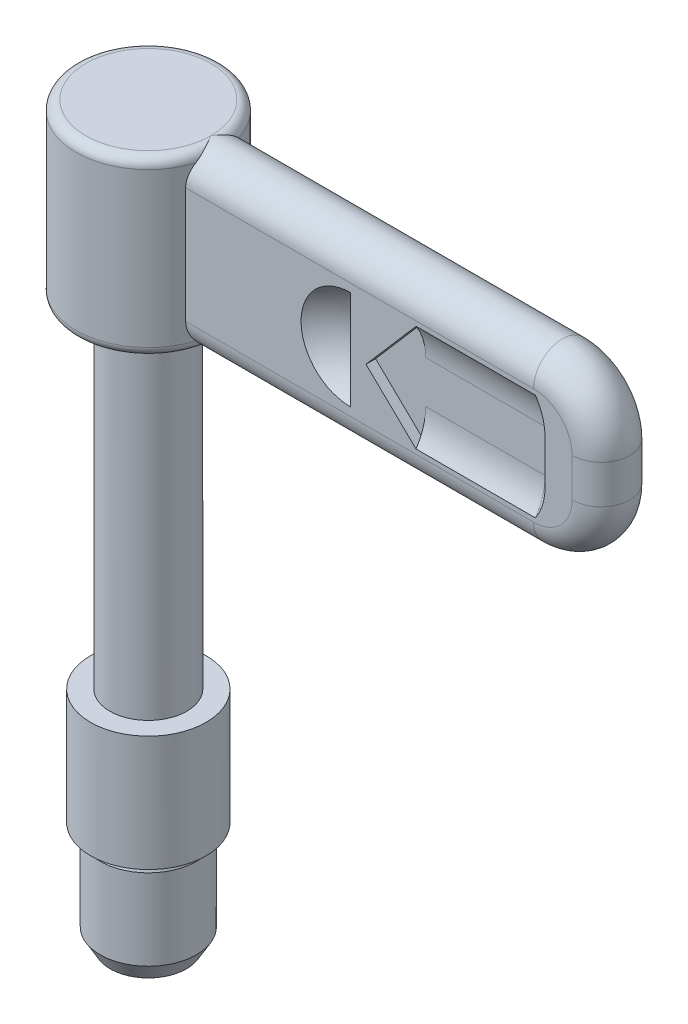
ISO-10303-21;
HEADER;
FILE_DESCRIPTION(('STEP AP214'),'2;1');
FILE_NAME('part.step','',(''),(''),'','','');
FILE_SCHEMA(('AUTOMOTIVE_DESIGN { 1 0 10303 214 1 1 1 1 }'));
ENDSEC;
DATA;
#1=APPLICATION_CONTEXT('core data for automotive mechanical design processes');
#2=APPLICATION_PROTOCOL_DEFINITION('international standard','automotive_design',2000,#1);
#3=PRODUCT_CONTEXT('',#1,'mechanical');
#4=PRODUCT('Part','Part','',(#3));
#5=PRODUCT_RELATED_PRODUCT_CATEGORY('part','',(#4));
#6=PRODUCT_DEFINITION_FORMATION('','',#4);
#7=PRODUCT_DEFINITION_CONTEXT('part definition',#1,'design');
#8=PRODUCT_DEFINITION('design','',#6,#7);
#9=PRODUCT_DEFINITION_SHAPE('','',#8);
#10=(LENGTH_UNIT() NAMED_UNIT(*) SI_UNIT(.MILLI.,.METRE.));
#11=(NAMED_UNIT(*) PLANE_ANGLE_UNIT() SI_UNIT($,.RADIAN.));
#12=(NAMED_UNIT(*) SI_UNIT($,.STERADIAN.) SOLID_ANGLE_UNIT());
#13=UNCERTAINTY_MEASURE_WITH_UNIT(LENGTH_MEASURE(1.E-05),#10,'distance_accuracy_value','');
#14=(GEOMETRIC_REPRESENTATION_CONTEXT(3) GLOBAL_UNCERTAINTY_ASSIGNED_CONTEXT((#13)) GLOBAL_UNIT_ASSIGNED_CONTEXT((#10,
#11,#12)) REPRESENTATION_CONTEXT('',''));
#15=CARTESIAN_POINT('',(0.,0.,0.));
#16=DIRECTION('',(0.,0.,1.));
#17=DIRECTION('',(1.,0.,0.));
#18=AXIS2_PLACEMENT_3D('',#15,#16,#17);
#19=CARTESIAN_POINT('',(-2.8267949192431,6.,2.8267949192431));
#20=DIRECTION('',(0.,1.,0.));
#21=DIRECTION('',(1.,0.,0.));
#22=AXIS2_PLACEMENT_3D('',#19,#20,#21);
#23=PLANE('',#22);
#24=CARTESIAN_POINT('',(0.,6.,0.));
#25=DIRECTION('',(0.,-1.,0.));
#26=DIRECTION('',(0.,0.,1.));
#27=AXIS2_PLACEMENT_3D('',#24,#25,#26);
#28=CIRCLE('',#27,2.);
#29=CARTESIAN_POINT('',(0.,6.,2.));
#30=VERTEX_POINT('',#29);
#31=EDGE_CURVE('E579',#30,#30,#28,.T.);
#32=ORIENTED_EDGE('',*,*,#31,.T.);
#33=EDGE_LOOP('',(#32));
#34=FACE_BOUND('',#33,.T.);
#35=CARTESIAN_POINT('',(0.,6.,0.));
#36=DIRECTION('',(0.,1.,0.));
#37=DIRECTION('',(0.,0.,1.));
#38=AXIS2_PLACEMENT_3D('',#35,#36,#37);
#39=CIRCLE('',#38,3.);
#40=CARTESIAN_POINT('',(0.,6.,3.));
#41=VERTEX_POINT('',#40);
#42=EDGE_CURVE('E24',#41,#41,#39,.T.);
#43=ORIENTED_EDGE('',*,*,#42,.T.);
#44=EDGE_LOOP('',(#43));
#45=FACE_BOUND('',#44,.T.);
#46=ADVANCED_FACE('F16',(#34,#45),#23,.T.);
#47=CARTESIAN_POINT('',(0.,-6.,0.));
#48=DIRECTION('',(0.,-1.,0.));
#49=DIRECTION('',(0.,0.,1.));
#50=AXIS2_PLACEMENT_3D('',#47,#48,#49);
#51=CYLINDRICAL_SURFACE('',#50,2.);
#52=CARTESIAN_POINT('',(0.,23.5,0.));
#53=DIRECTION('',(0.,-1.,0.));
#54=DIRECTION('',(0.,0.,-1.));
#55=AXIS2_PLACEMENT_3D('',#52,#53,#54);
#56=CIRCLE('',#55,2.);
#57=CARTESIAN_POINT('',(0.,23.5,-2.));
#58=VERTEX_POINT('',#57);
#59=EDGE_CURVE('E11',#58,#58,#56,.F.);
#60=ORIENTED_EDGE('',*,*,#59,.F.);
#61=EDGE_LOOP('',(#60));
#62=FACE_BOUND('',#61,.T.);
#63=ORIENTED_EDGE('',*,*,#31,.F.);
#64=EDGE_LOOP('',(#63));
#65=FACE_BOUND('',#64,.T.);
#66=ADVANCED_FACE('F1060',(#62,#65),#51,.T.);
#67=CARTESIAN_POINT('',(0.,-6.,0.));
#68=DIRECTION('',(0.,-1.,0.));
#69=DIRECTION('',(7.69327835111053E-10,0.,1.));
#70=AXIS2_PLACEMENT_3D('',#67,#68,#69);
#71=CYLINDRICAL_SURFACE('',#70,3.);
#72=ORIENTED_EDGE('',*,*,#42,.F.);
#73=EDGE_LOOP('',(#72));
#74=FACE_BOUND('',#73,.T.);
#75=CARTESIAN_POINT('',(0.,0.,0.));
#76=DIRECTION('',(0.,-1.,0.));
#77=DIRECTION('',(0.,0.,-1.));
#78=AXIS2_PLACEMENT_3D('',#75,#76,#77);
#79=CIRCLE('',#78,3.);
#80=CARTESIAN_POINT('',(0.,0.,-3.));
#81=VERTEX_POINT('',#80);
#82=EDGE_CURVE('E572',#81,#81,#79,.F.);
#83=ORIENTED_EDGE('',*,*,#82,.T.);
#84=EDGE_LOOP('',(#83));
#85=FACE_BOUND('',#84,.T.);
#86=ADVANCED_FACE('F1057',(#74,#85),#71,.T.);
#87=CARTESIAN_POINT('',(-2.91216703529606E-13,-0.999999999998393,0.));
#88=DIRECTION('',(0.,-1.,0.));
#89=DIRECTION('',(-1.,0.,0.));
#90=AXIS2_PLACEMENT_3D('',#87,#88,#89);
#91=SPHERICAL_SURFACE('',#90,5.00000000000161);
#92=CARTESIAN_POINT('',(0.,-5.58812253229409,0.));
#93=DIRECTION('',(0.,1.,0.));
#94=DIRECTION('',(-1.,0.,0.));
#95=AXIS2_PLACEMENT_3D('',#92,#93,#94);
#96=CIRCLE('',#95,1.98724221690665);
#97=CARTESIAN_POINT('',(-1.98724221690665,-5.58812253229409,0.));
#98=VERTEX_POINT('',#97);
#99=EDGE_CURVE('E568',#98,#98,#96,.F.);
#100=ORIENTED_EDGE('',*,*,#99,.T.);
#101=EDGE_LOOP('',(#100));
#102=FACE_BOUND('',#101,.T.);
#103=ADVANCED_FACE('F1042',(#102),#91,.T.);
#104=CARTESIAN_POINT('',(0.,-4.7,0.));
#105=DIRECTION('',(0.,1.,0.));
#106=DIRECTION('',(0.,0.,-1.));
#107=AXIS2_PLACEMENT_3D('',#104,#105,#106);
#108=CONICAL_SURFACE('',#107,2.5,0.523598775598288);
#109=ORIENTED_EDGE('',*,*,#99,.F.);
#110=EDGE_LOOP('',(#109));
#111=FACE_BOUND('',#110,.T.);
#112=CARTESIAN_POINT('',(0.,-4.7,0.));
#113=DIRECTION('',(0.,1.,0.));
#114=DIRECTION('',(0.,0.,-1.));
#115=AXIS2_PLACEMENT_3D('',#112,#113,#114);
#116=CIRCLE('',#115,2.5);
#117=CARTESIAN_POINT('',(0.,-4.7,-2.5));
#118=VERTEX_POINT('',#117);
#119=EDGE_CURVE('E1035',#118,#118,#116,.F.);
#120=ORIENTED_EDGE('',*,*,#119,.T.);
#121=EDGE_LOOP('',(#120));
#122=FACE_BOUND('',#121,.T.);
#123=ADVANCED_FACE('F1044',(#111,#122),#108,.T.);
#124=CARTESIAN_POINT('',(0.,-6.,0.));
#125=DIRECTION('',(0.,-1.,0.));
#126=DIRECTION('',(7.69370911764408E-10,0.,1.));
#127=AXIS2_PLACEMENT_3D('',#124,#125,#126);
#128=CYLINDRICAL_SURFACE('',#127,2.5);
#129=ORIENTED_EDGE('',*,*,#119,.F.);
#130=EDGE_LOOP('',(#129));
#131=FACE_BOUND('',#130,.T.);
#132=CARTESIAN_POINT('',(0.,-0.5,0.));
#133=DIRECTION('',(0.,1.,0.));
#134=DIRECTION('',(0.,0.,-1.));
#135=AXIS2_PLACEMENT_3D('',#132,#133,#134);
#136=CIRCLE('',#135,2.5);
#137=CARTESIAN_POINT('',(0.,-0.5,-2.5));
#138=VERTEX_POINT('',#137);
#139=EDGE_CURVE('E1033',#138,#138,#136,.F.);
#140=ORIENTED_EDGE('',*,*,#139,.T.);
#141=EDGE_LOOP('',(#140));
#142=FACE_BOUND('',#141,.T.);
#143=ADVANCED_FACE('F1046',(#131,#142),#128,.T.);
#144=CARTESIAN_POINT('',(0.,-0.5,0.));
#145=DIRECTION('',(0.,-1.,0.));
#146=DIRECTION('',(1.92344041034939E-10,0.,1.));
#147=AXIS2_PLACEMENT_3D('',#144,#145,#146);
#148=CONICAL_SURFACE('',#147,2.5,0.349065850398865);
#149=ORIENTED_EDGE('',*,*,#139,.F.);
#150=EDGE_LOOP('',(#149));
#151=FACE_BOUND('',#150,.T.);
#152=CARTESIAN_POINT('',(0.,-0.36262612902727,0.));
#153=DIRECTION('',(0.,1.,0.));
#154=DIRECTION('',(0.,0.,-1.));
#155=AXIS2_PLACEMENT_3D('',#152,#153,#154);
#156=CIRCLE('',#155,2.45);
#157=CARTESIAN_POINT('',(0.,-0.36262612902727,-2.45));
#158=VERTEX_POINT('',#157);
#159=EDGE_CURVE('E1025',#158,#158,#156,.F.);
#160=ORIENTED_EDGE('',*,*,#159,.T.);
#161=EDGE_LOOP('',(#160));
#162=FACE_BOUND('',#161,.T.);
#163=ADVANCED_FACE('F1054',(#151,#162),#148,.T.);
#164=CARTESIAN_POINT('',(0.,-6.,0.));
#165=DIRECTION('',(0.,-1.,0.));
#166=DIRECTION('',(7.69310071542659E-10,0.,1.));
#167=AXIS2_PLACEMENT_3D('',#164,#165,#166);
#168=CYLINDRICAL_SURFACE('',#167,2.45);
#169=ORIENTED_EDGE('',*,*,#159,.F.);
#170=EDGE_LOOP('',(#169));
#171=FACE_BOUND('',#170,.T.);
#172=CARTESIAN_POINT('',(0.,0.,0.));
#173=DIRECTION('',(0.,-1.,0.));
#174=DIRECTION('',(0.,0.,-1.));
#175=AXIS2_PLACEMENT_3D('',#172,#173,#174);
#176=CIRCLE('',#175,2.45);
#177=CARTESIAN_POINT('',(0.,0.,-2.45));
#178=VERTEX_POINT('',#177);
#179=EDGE_CURVE('E576',#178,#178,#176,.T.);
#180=ORIENTED_EDGE('',*,*,#179,.T.);
#181=EDGE_LOOP('',(#180));
#182=FACE_BOUND('',#181,.T.);
#183=ADVANCED_FACE('F1071',(#171,#182),#168,.T.);
#184=CARTESIAN_POINT('',(-2.8267949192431,0.,-2.8267949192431));
#185=DIRECTION('',(0.,-1.,0.));
#186=DIRECTION('',(1.,0.,0.));
#187=AXIS2_PLACEMENT_3D('',#184,#185,#186);
#188=PLANE('',#187);
#189=ORIENTED_EDGE('',*,*,#82,.F.);
#190=EDGE_LOOP('',(#189));
#191=FACE_BOUND('',#190,.T.);
#192=ORIENTED_EDGE('',*,*,#179,.F.);
#193=EDGE_LOOP('',(#192));
#194=FACE_BOUND('',#193,.T.);
#195=ADVANCED_FACE('F18',(#191,#194),#188,.T.);
#196=CARTESIAN_POINT('',(15.4,29.1,-1.5));
#197=DIRECTION('',(-1.,0.,0.));
#198=DIRECTION('',(0.,0.,1.));
#199=AXIS2_PLACEMENT_3D('',#196,#197,#198);
#200=PLANE('',#199);
#201=CARTESIAN_POINT('',(15.4,29.0999999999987,-4.00000000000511));
#202=DIRECTION('',(1.,0.,0.));
#203=DIRECTION('',(0.,0.552770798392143,0.833333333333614));
#204=AXIS2_PLACEMENT_3D('',#201,#202,#203);
#205=CIRCLE('',#204,3.0000000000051);
#206=CARTESIAN_POINT('',(15.4,30.758312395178,-1.5));
#207=VERTEX_POINT('',#206);
#208=CARTESIAN_POINT('',(15.4,29.1,-1.));
#209=VERTEX_POINT('',#208);
#210=EDGE_CURVE('E845',#207,#209,#205,.T.);
#211=ORIENTED_EDGE('',*,*,#210,.T.);
#212=DIRECTION('',(0.,1.,0.));
#213=VECTOR('',#212,1.);
#214=CARTESIAN_POINT('',(15.4,29.1,-1.));
#215=LINE('',#214,#213);
#216=CARTESIAN_POINT('',(15.4,30.758312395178,-1.));
#217=VERTEX_POINT('',#216);
#218=EDGE_CURVE('E850',#209,#217,#215,.T.);
#219=ORIENTED_EDGE('',*,*,#218,.T.);
#220=DIRECTION('',(0.,0.,1.));
#221=VECTOR('',#220,1.);
#222=CARTESIAN_POINT('',(15.4,30.758312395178,-1.5));
#223=LINE('',#222,#221);
#224=EDGE_CURVE('E828',#217,#207,#223,.F.);
#225=ORIENTED_EDGE('',*,*,#224,.T.);
#226=EDGE_LOOP('',(#211,#219,#225));
#227=FACE_BOUND('',#226,.T.);
#228=ADVANCED_FACE('F1079',(#227),#200,.T.);
#229=CARTESIAN_POINT('',(15.4,25.241687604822,-1.5));
#230=DIRECTION('',(-1.,0.,0.));
#231=DIRECTION('',(0.,0.,1.));
#232=AXIS2_PLACEMENT_3D('',#229,#230,#231);
#233=PLANE('',#232);
#234=CARTESIAN_POINT('',(15.4,26.9000000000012,-4.0000000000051));
#235=DIRECTION('',(1.,0.,0.));
#236=DIRECTION('',(0.,-4.16851738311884E-13,1.));
#237=AXIS2_PLACEMENT_3D('',#234,#235,#236);
#238=CIRCLE('',#237,3.0000000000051);
#239=CARTESIAN_POINT('',(15.4,26.9,-1.));
#240=VERTEX_POINT('',#239);
#241=CARTESIAN_POINT('',(15.4,25.241687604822,-1.5));
#242=VERTEX_POINT('',#241);
#243=EDGE_CURVE('E192',#240,#242,#238,.T.);
#244=ORIENTED_EDGE('',*,*,#243,.T.);
#245=DIRECTION('',(0.,0.,1.));
#246=VECTOR('',#245,1.);
#247=CARTESIAN_POINT('',(15.4,25.241687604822,-1.5));
#248=LINE('',#247,#246);
#249=CARTESIAN_POINT('',(15.4,25.241687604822,-1.));
#250=VERTEX_POINT('',#249);
#251=EDGE_CURVE('E209',#250,#242,#248,.F.);
#252=ORIENTED_EDGE('',*,*,#251,.F.);
#253=DIRECTION('',(0.,1.,0.));
#254=VECTOR('',#253,1.);
#255=CARTESIAN_POINT('',(15.4,25.241687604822,-1.));
#256=LINE('',#255,#254);
#257=EDGE_CURVE('E210',#250,#240,#256,.T.);
#258=ORIENTED_EDGE('',*,*,#257,.T.);
#259=EDGE_LOOP('',(#244,#252,#258));
#260=FACE_BOUND('',#259,.T.);
#261=ADVANCED_FACE('F208',(#260),#233,.T.);
#262=CARTESIAN_POINT('',(12.8,25.241687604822,-1.));
#263=DIRECTION('',(0.,0.,-1.));
#264=DIRECTION('',(0.,1.,0.));
#265=AXIS2_PLACEMENT_3D('',#262,#263,#264);
#266=PLANE('',#265);
#267=DIRECTION('',(-0.653895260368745,-0.756585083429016,0.));
#268=VECTOR('',#267,1.);
#269=CARTESIAN_POINT('',(15.4,30.758312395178,-1.));
#270=LINE('',#269,#268);
#271=CARTESIAN_POINT('',(12.8,27.75,-1.));
#272=VERTEX_POINT('',#271);
#273=EDGE_CURVE('E833',#217,#272,#270,.T.);
#274=ORIENTED_EDGE('',*,*,#273,.F.);
#275=ORIENTED_EDGE('',*,*,#218,.F.);
#276=DIRECTION('',(1.,0.,0.));
#277=VECTOR('',#276,1.);
#278=CARTESIAN_POINT('',(15.4,29.1,-1.));
#279=LINE('',#278,#277);
#280=CARTESIAN_POINT('',(21.6,29.1,-1.));
#281=VERTEX_POINT('',#280);
#282=EDGE_CURVE('E855',#209,#281,#279,.T.);
#283=ORIENTED_EDGE('',*,*,#282,.T.);
#284=DIRECTION('',(0.,-1.,0.));
#285=VECTOR('',#284,1.);
#286=CARTESIAN_POINT('',(21.6,29.1,-1.));
#287=LINE('',#286,#285);
#288=CARTESIAN_POINT('',(21.6,26.9,-1.));
#289=VERTEX_POINT('',#288);
#290=EDGE_CURVE('E859',#289,#281,#287,.F.);
#291=ORIENTED_EDGE('',*,*,#290,.F.);
#292=DIRECTION('',(-1.,0.,0.));
#293=VECTOR('',#292,1.);
#294=CARTESIAN_POINT('',(21.6,26.9,-1.));
#295=LINE('',#294,#293);
#296=EDGE_CURVE('E863',#240,#289,#295,.F.);
#297=ORIENTED_EDGE('',*,*,#296,.F.);
#298=ORIENTED_EDGE('',*,*,#257,.F.);
#299=DIRECTION('',(0.719682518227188,-0.694303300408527,0.));
#300=VECTOR('',#299,1.);
#301=CARTESIAN_POINT('',(12.8,27.75,-1.));
#302=LINE('',#301,#300);
#303=EDGE_CURVE('E217',#272,#250,#302,.T.);
#304=ORIENTED_EDGE('',*,*,#303,.F.);
#305=EDGE_LOOP('',(#274,#275,#283,#291,#297,#298,#304));
#306=FACE_BOUND('',#305,.T.);
#307=ADVANCED_FACE('F889',(#306),#266,.T.);
#308=CARTESIAN_POINT('',(15.4,25.241687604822,1.5));
#309=DIRECTION('',(-1.,0.,0.));
#310=DIRECTION('',(0.,1.,0.));
#311=AXIS2_PLACEMENT_3D('',#308,#309,#310);
#312=PLANE('',#311);
#313=DIRECTION('',(0.,1.,0.));
#314=VECTOR('',#313,1.);
#315=CARTESIAN_POINT('',(15.4,25.241687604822,1.));
#316=LINE('',#315,#314);
#317=CARTESIAN_POINT('',(15.4,25.241687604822,1.));
#318=VERTEX_POINT('',#317);
#319=CARTESIAN_POINT('',(15.4,26.9000000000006,1.));
#320=VERTEX_POINT('',#319);
#321=EDGE_CURVE('E1437',#318,#320,#316,.T.);
#322=ORIENTED_EDGE('',*,*,#321,.F.);
#323=DIRECTION('',(0.,0.,1.));
#324=VECTOR('',#323,1.);
#325=CARTESIAN_POINT('',(15.4,25.241687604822,1.));
#326=LINE('',#325,#324);
#327=CARTESIAN_POINT('',(15.4,25.241687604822,1.5));
#328=VERTEX_POINT('',#327);
#329=EDGE_CURVE('E812',#318,#328,#326,.T.);
#330=ORIENTED_EDGE('',*,*,#329,.T.);
#331=CARTESIAN_POINT('',(15.4,26.9000000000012,4.00000000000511));
#332=DIRECTION('',(-1.,0.,0.));
#333=DIRECTION('',(0.,-2.08425869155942E-13,-1.));
#334=AXIS2_PLACEMENT_3D('',#331,#332,#333);
#335=CIRCLE('',#334,3.0000000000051);
#336=EDGE_CURVE('E1445',#328,#320,#335,.F.);
#337=ORIENTED_EDGE('',*,*,#336,.T.);
#338=EDGE_LOOP('',(#322,#330,#337));
#339=FACE_BOUND('',#338,.T.);
#340=ADVANCED_FACE('F1168',(#339),#312,.T.);
#341=CARTESIAN_POINT('',(15.4,29.0999999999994,1.5));
#342=DIRECTION('',(-1.,0.,0.));
#343=DIRECTION('',(0.,1.,0.));
#344=AXIS2_PLACEMENT_3D('',#341,#342,#343);
#345=PLANE('',#344);
#346=DIRECTION('',(0.,0.,-1.));
#347=VECTOR('',#346,1.);
#348=CARTESIAN_POINT('',(15.4,30.758312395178,1.5));
#349=LINE('',#348,#347);
#350=CARTESIAN_POINT('',(15.4,30.758312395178,1.));
#351=VERTEX_POINT('',#350);
#352=CARTESIAN_POINT('',(15.4,30.758312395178,1.5));
#353=VERTEX_POINT('',#352);
#354=EDGE_CURVE('E820',#351,#353,#349,.F.);
#355=ORIENTED_EDGE('',*,*,#354,.F.);
#356=DIRECTION('',(0.,1.,0.));
#357=VECTOR('',#356,1.);
#358=CARTESIAN_POINT('',(15.4,29.0999999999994,1.));
#359=LINE('',#358,#357);
#360=CARTESIAN_POINT('',(15.4,29.0999999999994,1.));
#361=VERTEX_POINT('',#360);
#362=EDGE_CURVE('E1419',#361,#351,#359,.T.);
#363=ORIENTED_EDGE('',*,*,#362,.F.);
#364=CARTESIAN_POINT('',(15.4,29.0999999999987,4.0000000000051));
#365=DIRECTION('',(-1.,0.,0.));
#366=DIRECTION('',(0.,0.552770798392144,-0.833333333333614));
#367=AXIS2_PLACEMENT_3D('',#364,#365,#366);
#368=CIRCLE('',#367,3.0000000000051);
#369=EDGE_CURVE('E716',#361,#353,#368,.F.);
#370=ORIENTED_EDGE('',*,*,#369,.T.);
#371=EDGE_LOOP('',(#355,#363,#370));
#372=FACE_BOUND('',#371,.T.);
#373=ADVANCED_FACE('F696',(#372),#345,.T.);
#374=CARTESIAN_POINT('',(21.6,25.241687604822,1.));
#375=DIRECTION('',(0.,0.,1.));
#376=DIRECTION('',(0.,1.,0.));
#377=AXIS2_PLACEMENT_3D('',#374,#375,#376);
#378=PLANE('',#377);
#379=DIRECTION('',(0.,1.,0.));
#380=VECTOR('',#379,1.);
#381=CARTESIAN_POINT('',(21.6,26.9000000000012,1.));
#382=LINE('',#381,#380);
#383=CARTESIAN_POINT('',(21.6,26.9000000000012,1.));
#384=VERTEX_POINT('',#383);
#385=CARTESIAN_POINT('',(21.6,29.1,1.));
#386=VERTEX_POINT('',#385);
#387=EDGE_CURVE('E1426',#384,#386,#382,.T.);
#388=ORIENTED_EDGE('',*,*,#387,.T.);
#389=DIRECTION('',(-1.,-1.00851227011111E-13,0.));
#390=VECTOR('',#389,1.);
#391=CARTESIAN_POINT('',(21.6,29.1,1.));
#392=LINE('',#391,#390);
#393=EDGE_CURVE('E1422',#361,#386,#392,.F.);
#394=ORIENTED_EDGE('',*,*,#393,.F.);
#395=ORIENTED_EDGE('',*,*,#362,.T.);
#396=DIRECTION('',(-0.653895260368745,-0.756585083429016,0.));
#397=VECTOR('',#396,1.);
#398=CARTESIAN_POINT('',(15.4,30.758312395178,1.));
#399=LINE('',#398,#397);
#400=CARTESIAN_POINT('',(12.8,27.75,1.));
#401=VERTEX_POINT('',#400);
#402=EDGE_CURVE('E1421',#351,#401,#399,.T.);
#403=ORIENTED_EDGE('',*,*,#402,.T.);
#404=DIRECTION('',(0.719682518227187,-0.694303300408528,0.));
#405=VECTOR('',#404,1.);
#406=CARTESIAN_POINT('',(12.8,27.75,1.));
#407=LINE('',#406,#405);
#408=EDGE_CURVE('E1424',#401,#318,#407,.T.);
#409=ORIENTED_EDGE('',*,*,#408,.T.);
#410=ORIENTED_EDGE('',*,*,#321,.T.);
#411=DIRECTION('',(-1.,-1.00851227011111E-13,0.));
#412=VECTOR('',#411,1.);
#413=CARTESIAN_POINT('',(21.6,26.9000000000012,1.));
#414=LINE('',#413,#412);
#415=EDGE_CURVE('E681',#320,#384,#414,.F.);
#416=ORIENTED_EDGE('',*,*,#415,.T.);
#417=EDGE_LOOP('',(#388,#394,#395,#403,#409,#410,#416));
#418=FACE_BOUND('',#417,.T.);
#419=ADVANCED_FACE('F693',(#418),#378,.T.);
#420=CARTESIAN_POINT('',(-3.24997217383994,32.5,3.2746253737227));
#421=DIRECTION('',(0.,1.,0.));
#422=DIRECTION('',(1.,0.,0.));
#423=AXIS2_PLACEMENT_3D('',#420,#421,#422);
#424=PLANE('',#423);
#425=CARTESIAN_POINT('',(0.,32.5,0.));
#426=DIRECTION('',(0.,1.,0.));
#427=DIRECTION('',(-0.707106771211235,0.,0.70710679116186));
#428=AXIS2_PLACEMENT_3D('',#425,#426,#427);
#429=CIRCLE('',#428,3.25000012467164);
#430=CARTESIAN_POINT('',(3.25000012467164,32.5,0.));
#431=VERTEX_POINT('',#430);
#432=EDGE_CURVE('E562',#431,#431,#429,.F.);
#433=ORIENTED_EDGE('',*,*,#432,.F.);
#434=EDGE_LOOP('',(#433));
#435=FACE_BOUND('',#434,.T.);
#436=ADVANCED_FACE('F486',(#435),#424,.T.);
#437=CARTESIAN_POINT('',(12.,28.,-4.3));
#438=DIRECTION('',(0.,1.,0.));
#439=DIRECTION('',(-0.676064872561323,0.,0.736842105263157));
#440=AXIS2_PLACEMENT_3D('',#437,#438,#439);
#441=SPHERICAL_SURFACE('',#440,3.8);
#442=CARTESIAN_POINT('',(12.,30.569046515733,-1.50000000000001));
#443=CARTESIAN_POINT('',(12.,30.5257400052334,-1.46026412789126));
#444=CARTESIAN_POINT('',(12.,30.4815102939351,-1.42153457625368));
#445=CARTESIAN_POINT('',(12.,30.3913026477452,-1.3461679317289));
#446=CARTESIAN_POINT('',(12.,30.3453247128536,-1.30953083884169));
#447=CARTESIAN_POINT('',(12.,30.2517187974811,-1.23842892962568));
#448=CARTESIAN_POINT('',(12.,30.2040908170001,-1.20396411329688));
#449=CARTESIAN_POINT('',(12.,30.1072875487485,-1.13728069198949));
#450=CARTESIAN_POINT('',(12.,30.0581122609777,-1.1050620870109));
#451=CARTESIAN_POINT('',(12.,29.9583201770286,-1.04294051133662));
#452=CARTESIAN_POINT('',(12.,29.9077033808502,-1.01303754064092));
#453=CARTESIAN_POINT('',(12.,29.8051372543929,-0.955611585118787));
#454=CARTESIAN_POINT('',(12.,29.7531879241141,-0.928088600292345));
#455=CARTESIAN_POINT('',(12.,29.6480685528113,-0.875481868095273));
#456=CARTESIAN_POINT('',(12.,29.5948985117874,-0.850398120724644));
#457=CARTESIAN_POINT('',(12.,29.4874521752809,-0.802723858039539));
#458=CARTESIAN_POINT('',(12.,29.4331758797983,-0.780133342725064));
#459=CARTESIAN_POINT('',(12.,29.3236338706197,-0.737494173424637));
#460=CARTESIAN_POINT('',(12.,29.2683681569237,-0.717445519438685));
#461=CARTESIAN_POINT('',(12.,29.1569662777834,-0.679933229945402));
#462=CARTESIAN_POINT('',(12.,29.1008301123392,-0.662469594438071));
#463=CARTESIAN_POINT('',(12.,28.9878081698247,-0.630164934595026));
#464=CARTESIAN_POINT('',(12.,28.9309223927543,-0.615323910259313));
#465=CARTESIAN_POINT('',(12.,28.8165236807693,-0.588296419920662));
#466=CARTESIAN_POINT('',(12.,28.7590107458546,-0.576109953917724));
#467=CARTESIAN_POINT('',(12.,28.6434815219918,-0.554417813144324));
#468=CARTESIAN_POINT('',(12.,28.5854652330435,-0.544912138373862));
#469=CARTESIAN_POINT('',(12.,28.4690541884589,-0.528602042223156));
#470=CARTESIAN_POINT('',(12.,28.4106594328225,-0.52179762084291));
#471=CARTESIAN_POINT('',(12.,28.2936171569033,-0.510904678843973));
#472=CARTESIAN_POINT('',(12.,28.2349696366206,-0.506816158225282));
#473=CARTESIAN_POINT('',(12.,28.1175480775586,-0.501363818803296));
#474=CARTESIAN_POINT('',(12.,28.0587740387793,-0.500000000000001));
#475=CARTESIAN_POINT('',(12.,27.9412259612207,-0.500000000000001));
#476=CARTESIAN_POINT('',(12.,27.8824519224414,-0.501363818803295));
#477=CARTESIAN_POINT('',(12.,27.7650303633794,-0.506816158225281));
#478=CARTESIAN_POINT('',(12.,27.7063828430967,-0.510904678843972));
#479=CARTESIAN_POINT('',(12.,27.5893405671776,-0.521797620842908));
#480=CARTESIAN_POINT('',(12.,27.5309458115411,-0.528602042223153));
#481=CARTESIAN_POINT('',(12.,27.4145347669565,-0.544912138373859));
#482=CARTESIAN_POINT('',(12.,27.3565184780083,-0.554417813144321));
#483=CARTESIAN_POINT('',(12.,27.2409892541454,-0.57610995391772));
#484=CARTESIAN_POINT('',(12.,27.1834763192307,-0.588296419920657));
#485=CARTESIAN_POINT('',(12.,27.0690776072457,-0.615323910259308));
#486=CARTESIAN_POINT('',(12.,27.0121918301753,-0.630164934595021));
#487=CARTESIAN_POINT('',(12.,26.8991698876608,-0.662469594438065));
#488=CARTESIAN_POINT('',(12.,26.8430337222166,-0.679933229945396));
#489=CARTESIAN_POINT('',(12.,26.7316318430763,-0.717445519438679));
#490=CARTESIAN_POINT('',(12.,26.6763661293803,-0.73749417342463));
#491=CARTESIAN_POINT('',(12.,26.5668241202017,-0.780133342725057));
#492=CARTESIAN_POINT('',(12.,26.5125478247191,-0.802723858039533));
#493=CARTESIAN_POINT('',(12.,26.4051014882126,-0.850398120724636));
#494=CARTESIAN_POINT('',(12.,26.3519314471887,-0.875481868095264));
#495=CARTESIAN_POINT('',(12.,26.2468120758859,-0.928088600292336));
#496=CARTESIAN_POINT('',(12.,26.1948627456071,-0.955611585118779));
#497=CARTESIAN_POINT('',(12.,26.0922966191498,-1.01303754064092));
#498=CARTESIAN_POINT('',(12.,26.0416798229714,-1.04294051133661));
#499=CARTESIAN_POINT('',(12.,25.9418877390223,-1.10506208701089));
#500=CARTESIAN_POINT('',(12.,25.8927124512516,-1.13728069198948));
#501=CARTESIAN_POINT('',(12.,25.7959091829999,-1.20396411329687));
#502=CARTESIAN_POINT('',(12.,25.7482812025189,-1.23842892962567));
#503=CARTESIAN_POINT('',(12.,25.6546752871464,-1.30953083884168));
#504=CARTESIAN_POINT('',(12.,25.6086973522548,-1.34616793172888));
#505=CARTESIAN_POINT('',(12.,25.5184897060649,-1.42153457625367));
#506=CARTESIAN_POINT('',(12.,25.4742599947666,-1.46026412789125));
#507=CARTESIAN_POINT('',(12.,25.430953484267,-1.5));
#508=B_SPLINE_CURVE_WITH_KNOTS('',3,(#442,#443,#444,#445,#446,#447,#448,#449,#450,#451,#452,
#453,#454,#455,#456,#457,#458,#459,#460,#461,#462,#463,#464,#465,#466,#467,#468,#469,#470,#471,
#472,#473,#474,#475,#476,#477,#478,#479,#480,#481,#482,#483,#484,#485,#486,#487,#488,#489,#490,
#491,#492,#493,#494,#495,#496,#497,#498,#499,#500,#501,#502,#503,#504,#505,#506,#507),
.UNSPECIFIED.,.F.,.F.,(4,2,2,2,2,2,2,2,2,2,2,2,2,2,2,2,2,2,2,2,2,2,2,2,2,2,2,2,2,2,2,2,4),(0.,
0.176306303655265,0.35261260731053,0.528918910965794,0.70522521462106,0.881531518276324,
1.05783782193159,1.23414412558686,1.41045042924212,1.58675673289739,1.76306303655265,
1.93936934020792,2.11567564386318,2.29198194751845,2.46828825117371,2.64459455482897,
2.82090085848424,2.9972071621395,3.17351346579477,3.34981976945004,3.5261260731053,
3.70243237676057,3.87873868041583,4.0550449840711,4.23135128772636,4.40765759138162,
4.58396389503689,4.76027019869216,4.93657650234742,5.11288280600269,5.28918910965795,
5.46549541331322,5.64180171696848),.UNSPECIFIED.);
#509=CARTESIAN_POINT('',(12.,30.569046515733,-1.5));
#510=VERTEX_POINT('',#509);
#511=CARTESIAN_POINT('',(12.,25.430953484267,-1.5));
#512=VERTEX_POINT('',#511);
#513=EDGE_CURVE('E583',#510,#512,#508,.T.);
#514=ORIENTED_EDGE('',*,*,#513,.T.);
#515=CARTESIAN_POINT('',(12.,30.569046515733,-1.5));
#516=CARTESIAN_POINT('',(11.8604662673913,30.569046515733,-1.5));
#517=CARTESIAN_POINT('',(11.7251672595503,30.558257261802,-1.5));
#518=CARTESIAN_POINT('',(11.4614528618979,30.5161788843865,-1.5));
#519=CARTESIAN_POINT('',(11.3330374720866,30.4848897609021,-1.5));
#520=CARTESIAN_POINT('',(10.9180636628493,30.349608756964,-1.5));
#521=CARTESIAN_POINT('',(10.6751190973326,30.2176773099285,-1.5));
#522=CARTESIAN_POINT('',(10.1926951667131,29.8569578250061,-1.5));
#523=CARTESIAN_POINT('',(9.96213756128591,29.6004957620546,-1.5));
#524=CARTESIAN_POINT('',(9.19003735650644,28.3008382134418,-1.5));
#525=CARTESIAN_POINT('',(9.35292610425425,27.0138934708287,-1.5));
#526=CARTESIAN_POINT('',(10.3717569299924,25.9950626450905,-1.5));
#527=CARTESIAN_POINT('',(10.5851466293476,25.8366086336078,-1.5));
#528=CARTESIAN_POINT('',(11.0064475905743,25.6232428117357,-1.5));
#529=CARTESIAN_POINT('',(11.1899669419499,25.55356956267,-1.5));
#530=CARTESIAN_POINT('',(11.58418094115,25.4558125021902,-1.5));
#531=CARTESIAN_POINT('',(11.7896180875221,25.4309534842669,-1.5));
#532=CARTESIAN_POINT('',(12.,25.4309534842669,-1.5));
#533=B_SPLINE_CURVE_WITH_KNOTS('',3,(#515,#516,#517,#518,#519,#520,#521,#522,#523,#524,#525,
#526,#527,#528,#529,#530,#531,#532),.UNSPECIFIED.,.F.,.F.,(4,2,2,2,2,2,2,2,4),(0.,
0.042961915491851,0.0859238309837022,0.184717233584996,0.310914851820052,0.758114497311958,
0.859535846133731,0.928561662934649,1.),.UNSPECIFIED.);
#534=EDGE_CURVE('E278',#510,#512,#533,.T.);
#535=ORIENTED_EDGE('',*,*,#534,.F.);
#536=EDGE_LOOP('',(#514,#535));
#537=FACE_BOUND('',#536,.T.);
#538=ADVANCED_FACE('F640',(#537),#441,.F.);
#539=CARTESIAN_POINT('',(12.,25.430953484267,-0.497806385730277));
#540=DIRECTION('',(-1.,0.,0.));
#541=DIRECTION('',(0.,1.,0.));
#542=AXIS2_PLACEMENT_3D('',#539,#540,#541);
#543=PLANE('',#542);
#544=ORIENTED_EDGE('',*,*,#513,.F.);
#545=DIRECTION('',(0.,1.,0.));
#546=VECTOR('',#545,1.);
#547=CARTESIAN_POINT('',(12.,25.430953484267,-1.5));
#548=LINE('',#547,#546);
#549=EDGE_CURVE('E1455',#512,#510,#548,.T.);
#550=ORIENTED_EDGE('',*,*,#549,.F.);
#551=EDGE_LOOP('',(#544,#550));
#552=FACE_BOUND('',#551,.T.);
#553=ADVANCED_FACE('F649',(#552),#543,.T.);
#554=CARTESIAN_POINT('',(12.8,27.75,-1.5));
#555=DIRECTION('',(0.756585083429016,-0.653895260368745,0.));
#556=DIRECTION('',(0.653895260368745,0.756585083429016,0.));
#557=AXIS2_PLACEMENT_3D('',#554,#555,#556);
#558=PLANE('',#557);
#559=DIRECTION('',(-0.653895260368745,-0.756585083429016,0.));
#560=VECTOR('',#559,1.);
#561=CARTESIAN_POINT('',(15.4,30.758312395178,-1.5));
#562=LINE('',#561,#560);
#563=CARTESIAN_POINT('',(12.8,27.75,-1.5));
#564=VERTEX_POINT('',#563);
#565=EDGE_CURVE('E224',#207,#564,#562,.T.);
#566=ORIENTED_EDGE('',*,*,#565,.F.);
#567=ORIENTED_EDGE('',*,*,#224,.F.);
#568=ORIENTED_EDGE('',*,*,#273,.T.);
#569=DIRECTION('',(0.,0.,-1.));
#570=VECTOR('',#569,1.);
#571=CARTESIAN_POINT('',(12.8,27.75,-1.));
#572=LINE('',#571,#570);
#573=EDGE_CURVE('E838',#272,#564,#572,.T.);
#574=ORIENTED_EDGE('',*,*,#573,.T.);
#575=EDGE_LOOP('',(#566,#567,#568,#574));
#576=FACE_BOUND('',#575,.T.);
#577=ADVANCED_FACE('F987',(#576),#558,.T.);
#578=CARTESIAN_POINT('',(15.4,29.0999999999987,-4.00000000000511));
#579=DIRECTION('',(1.,0.,0.));
#580=DIRECTION('',(0.,0.552770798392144,0.833333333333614));
#581=AXIS2_PLACEMENT_3D('',#578,#579,#580);
#582=CYLINDRICAL_SURFACE('',#581,3.0000000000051);
#583=CARTESIAN_POINT('',(21.6,29.1,-1.00000000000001));
#584=CARTESIAN_POINT('',(21.6,29.1366129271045,-1.00021970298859));
#585=CARTESIAN_POINT('',(21.6,29.1732233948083,-1.00104524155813));
#586=CARTESIAN_POINT('',(21.6,29.2464040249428,-1.00393807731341));
#587=CARTESIAN_POINT('',(21.6,29.282974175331,-1.00600567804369));
#588=CARTESIAN_POINT('',(21.6,29.3560184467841,-1.01141247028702));
#589=CARTESIAN_POINT('',(21.6,29.3924925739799,-1.01475157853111));
#590=CARTESIAN_POINT('',(21.6,29.4652900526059,-1.02272370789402));
#591=CARTESIAN_POINT('',(21.6,29.5016134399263,-1.02735640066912));
#592=CARTESIAN_POINT('',(21.6,29.5740567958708,-1.03793190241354));
#593=CARTESIAN_POINT('',(21.6,29.6101768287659,-1.04387427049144));
#594=CARTESIAN_POINT('',(21.6,29.6821626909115,-1.05707872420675));
#595=CARTESIAN_POINT('',(21.6,29.7180286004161,-1.06434037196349));
#596=CARTESIAN_POINT('',(21.6,29.789457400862,-1.08018643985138));
#597=CARTESIAN_POINT('',(21.6,29.8250203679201,-1.08877051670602));
#598=CARTESIAN_POINT('',(21.6,29.8957964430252,-1.10725789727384));
#599=CARTESIAN_POINT('',(21.6,29.9310095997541,-1.11716101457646));
#600=CARTESIAN_POINT('',(21.6,30.001041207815,-1.13827633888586));
#601=CARTESIAN_POINT('',(21.6,30.035859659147,-1.14948854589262));
#602=CARTESIAN_POINT('',(21.6,30.1050590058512,-1.17320534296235));
#603=CARTESIAN_POINT('',(21.6,30.1394398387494,-1.1857101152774));
#604=CARTESIAN_POINT('',(21.6,30.2077230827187,-1.21198881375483));
#605=CARTESIAN_POINT('',(21.6,30.2416253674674,-1.22576306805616));
#606=CARTESIAN_POINT('',(21.6,30.3089126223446,-1.25455103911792));
#607=CARTESIAN_POINT('',(21.6,30.342297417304,-1.26956516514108));
#608=CARTESIAN_POINT('',(21.6,30.4085127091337,-1.30079681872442));
#609=CARTESIAN_POINT('',(21.6,30.4413430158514,-1.31701474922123));
#610=CARTESIAN_POINT('',(21.6,30.5064143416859,-1.3506116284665));
#611=CARTESIAN_POINT('',(21.6,30.5386552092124,-1.36799087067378));
#612=CARTESIAN_POINT('',(21.6,30.6025141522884,-1.40386195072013));
#613=CARTESIAN_POINT('',(21.6,30.6341321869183,-1.42235386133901));
#614=CARTESIAN_POINT('',(21.6,30.6967151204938,-1.46039528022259));
#615=CARTESIAN_POINT('',(21.6,30.7276801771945,-1.4799445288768));
#616=CARTESIAN_POINT('',(21.6,30.758312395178,-1.5));
#617=B_SPLINE_CURVE_WITH_KNOTS('',3,(#583,#584,#585,#586,#587,#588,#589,#590,#591,#592,#593,
#594,#595,#596,#597,#598,#599,#600,#601,#602,#603,#604,#605,#606,#607,#608,#609,#610,#611,#612,
#613,#614,#615,#616),.UNSPECIFIED.,.F.,.F.,(4,2,2,2,2,2,2,2,2,2,2,2,2,2,2,2,4),(0.,
0.10983749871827,0.21970185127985,0.329559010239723,0.439388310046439,0.549180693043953,
0.658936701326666,0.768664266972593,0.878376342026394,0.988088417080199,1.09781598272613,
1.20757199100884,1.31736437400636,1.42719367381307,1.53705083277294,1.64691518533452,
1.7567526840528),.UNSPECIFIED.);
#618=CARTESIAN_POINT('',(21.6,30.758312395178,-1.5));
#619=VERTEX_POINT('',#618);
#620=EDGE_CURVE('E40',#619,#281,#617,.F.);
#621=ORIENTED_EDGE('',*,*,#620,.T.);
#622=ORIENTED_EDGE('',*,*,#282,.F.);
#623=ORIENTED_EDGE('',*,*,#210,.F.);
#624=DIRECTION('',(-1.,0.,0.));
#625=VECTOR('',#624,1.);
#626=CARTESIAN_POINT('',(21.6,30.758312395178,-1.5));
#627=LINE('',#626,#625);
#628=EDGE_CURVE('E1456',#207,#619,#627,.F.);
#629=ORIENTED_EDGE('',*,*,#628,.T.);
#630=EDGE_LOOP('',(#621,#622,#623,#629));
#631=FACE_BOUND('',#630,.T.);
#632=ADVANCED_FACE('F948',(#631),#582,.F.);
#633=CARTESIAN_POINT('',(21.6,30.758312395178,-1.5));
#634=CARTESIAN_POINT('',(21.6,30.0028946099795,-1.00543735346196));
#635=CARTESIAN_POINT('',(21.6,29.0999999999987,-1.));
#636=CARTESIAN_POINT('',(21.6,30.758312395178,-1.5));
#637=CARTESIAN_POINT('',(21.794214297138,30.0028946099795,-1.00543735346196));
#638=CARTESIAN_POINT('',(21.7963495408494,29.0999999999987,-1.));
#639=CARTESIAN_POINT('',(21.6,30.758312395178,-1.5));
#640=CARTESIAN_POINT('',(21.990944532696,30.0028946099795,-1.10905546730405));
#641=CARTESIAN_POINT('',(21.9952426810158,29.0999999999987,-1.10475731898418));
#642=CARTESIAN_POINT('',(21.6,30.758312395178,-1.5));
#643=CARTESIAN_POINT('',(22.0945626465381,30.0028946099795,-1.30578570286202));
#644=CARTESIAN_POINT('',(22.1,29.0999999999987,-1.30365045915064));
#645=CARTESIAN_POINT('',(21.6,30.758312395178,-1.5));
#646=CARTESIAN_POINT('',(22.0945626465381,30.0028946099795,-1.5));
#647=CARTESIAN_POINT('',(22.1,29.0999999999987,-1.5));
#648=B_SPLINE_SURFACE_WITH_KNOTS('',4,2,((#633,#634,#635),(#636,#637,#638),(#639,#640,#641),
(#642,#643,#644),(#645,#646,#647)),.UNSPECIFIED.,.F.,.F.,.F.,(5,5),(3,3),(0.,1.),(0.,1.),.UNSPECIFIED.);
#649=CARTESIAN_POINT('',(21.6,30.758312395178,-1.5));
#650=CARTESIAN_POINT('',(21.6200554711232,30.7276801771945,-1.5));
#651=CARTESIAN_POINT('',(21.6396047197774,30.6967151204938,-1.5));
#652=CARTESIAN_POINT('',(21.677646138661,30.6341321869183,-1.5));
#653=CARTESIAN_POINT('',(21.6961380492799,30.6025141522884,-1.5));
#654=CARTESIAN_POINT('',(21.7320091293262,30.5386552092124,-1.5));
#655=CARTESIAN_POINT('',(21.7493883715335,30.5064143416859,-1.5));
#656=CARTESIAN_POINT('',(21.7829852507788,30.4413430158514,-1.5));
#657=CARTESIAN_POINT('',(21.7992031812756,30.4085127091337,-1.5));
#658=CARTESIAN_POINT('',(21.8304348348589,30.342297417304,-1.5));
#659=CARTESIAN_POINT('',(21.8454489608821,30.3089126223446,-1.5));
#660=CARTESIAN_POINT('',(21.8742369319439,30.2416253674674,-1.5));
#661=CARTESIAN_POINT('',(21.8880111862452,30.2077230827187,-1.5));
#662=CARTESIAN_POINT('',(21.9142898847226,30.1394398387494,-1.5));
#663=CARTESIAN_POINT('',(21.9267946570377,30.1050590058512,-1.5));
#664=CARTESIAN_POINT('',(21.9505114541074,30.035859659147,-1.5));
#665=CARTESIAN_POINT('',(21.9617236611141,30.001041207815,-1.5));
#666=CARTESIAN_POINT('',(21.9828389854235,29.9310095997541,-1.5));
#667=CARTESIAN_POINT('',(21.9927421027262,29.8957964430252,-1.5));
#668=CARTESIAN_POINT('',(22.011229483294,29.8250203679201,-1.5));
#669=CARTESIAN_POINT('',(22.0198135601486,29.789457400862,-1.5));
#670=CARTESIAN_POINT('',(22.0356596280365,29.7180286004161,-1.5));
#671=CARTESIAN_POINT('',(22.0429212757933,29.6821626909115,-1.5));
#672=CARTESIAN_POINT('',(22.0561257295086,29.6101768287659,-1.5));
#673=CARTESIAN_POINT('',(22.0620680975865,29.5740567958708,-1.5));
#674=CARTESIAN_POINT('',(22.0726435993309,29.5016134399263,-1.5));
#675=CARTESIAN_POINT('',(22.077276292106,29.4652900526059,-1.5));
#676=CARTESIAN_POINT('',(22.0852484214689,29.3924925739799,-1.5));
#677=CARTESIAN_POINT('',(22.088587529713,29.3560184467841,-1.5));
#678=CARTESIAN_POINT('',(22.0939943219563,29.282974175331,-1.5));
#679=CARTESIAN_POINT('',(22.0960619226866,29.2464040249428,-1.5));
#680=CARTESIAN_POINT('',(22.0989547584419,29.1732233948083,-1.5));
#681=CARTESIAN_POINT('',(22.0997802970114,29.1366129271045,-1.5));
#682=CARTESIAN_POINT('',(22.1,29.1,-1.5));
#683=B_SPLINE_CURVE_WITH_KNOTS('',3,(#649,#650,#651,#652,#653,#654,#655,#656,#657,#658,#659,
#660,#661,#662,#663,#664,#665,#666,#667,#668,#669,#670,#671,#672,#673,#674,#675,#676,#677,#678,
#679,#680,#681,#682),.UNSPECIFIED.,.F.,.F.,(4,2,2,2,2,2,2,2,2,2,2,2,2,2,2,2,4),(0.,
0.109837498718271,0.219701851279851,0.329559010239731,0.439388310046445,0.549180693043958,
0.658936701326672,0.768664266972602,0.878376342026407,0.988088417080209,1.09781598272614,
1.20757199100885,1.31736437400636,1.42719367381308,1.53705083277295,1.64691518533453,
1.7567526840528),.UNSPECIFIED.);
#684=CARTESIAN_POINT('',(22.1,29.1,-1.5));
#685=VERTEX_POINT('',#684);
#686=EDGE_CURVE('E1459',#619,#685,#683,.T.);
#687=CARTESIAN_POINT('',(22.1,29.1,-1.5));
#688=CARTESIAN_POINT('',(22.1000000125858,29.1,-1.49181422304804));
#689=CARTESIAN_POINT('',(22.0997951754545,29.1,-1.48362862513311));
#690=CARTESIAN_POINT('',(22.0989796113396,29.1,-1.46727068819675));
#691=CARTESIAN_POINT('',(22.0983685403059,29.1,-1.45909836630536));
#692=CARTESIAN_POINT('',(22.0967439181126,29.1,-1.44278968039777));
#693=CARTESIAN_POINT('',(22.0957301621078,29.1,-1.43465333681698));
#694=CARTESIAN_POINT('',(22.0933042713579,29.1,-1.41843853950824));
#695=CARTESIAN_POINT('',(22.0918920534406,29.1,-1.41036009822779));
#696=CARTESIAN_POINT('',(22.0886740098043,29.1,-1.39428242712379));
#697=CARTESIAN_POINT('',(22.086868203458,29.1,-1.38628319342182));
#698=CARTESIAN_POINT('',(22.0828684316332,29.1,-1.37038460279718));
#699=CARTESIAN_POINT('',(22.0806745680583,29.1,-1.36248522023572));
#700=CARTESIAN_POINT('',(22.075904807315,29.1,-1.34680634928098));
#701=CARTESIAN_POINT('',(22.0733290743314,29.1,-1.33902681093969));
#702=CARTESIAN_POINT('',(22.0678023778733,29.1,-1.32360699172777));
#703=CARTESIAN_POINT('',(22.0648516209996,29.1,-1.31596663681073));
#704=CARTESIAN_POINT('',(22.0585823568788,29.1,-1.30084389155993));
#705=CARTESIAN_POINT('',(22.0552640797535,29.1,-1.2933614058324));
#706=CARTESIAN_POINT('',(22.0482679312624,29.1,-1.27857244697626));
#707=CARTESIAN_POINT('',(22.0445902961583,29.1,-1.27126586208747));
#708=CARTESIAN_POINT('',(22.036884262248,29.1,-1.25684609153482));
#709=CARTESIAN_POINT('',(22.0328560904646,29.1,-1.24973278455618));
#710=CARTESIAN_POINT('',(22.0244584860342,29.1,-1.23571629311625));
#711=CARTESIAN_POINT('',(22.0200892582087,29.1,-1.22881298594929));
#712=CARTESIAN_POINT('',(22.011019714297,29.1,-1.21523255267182));
#713=CARTESIAN_POINT('',(22.0063195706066,29.1,-1.2085553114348));
#714=CARTESIAN_POINT('',(21.9965990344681,29.1,-1.19544240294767));
#715=CARTESIAN_POINT('',(21.991578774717,29.1,-1.18900663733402));
#716=CARTESIAN_POINT('',(21.9812295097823,29.1,-1.17639140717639));
#717=CARTESIAN_POINT('',(21.975900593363,29.1,-1.17021186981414));
#718=CARTESIAN_POINT('',(21.9649461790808,29.1,-1.158123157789));
#719=CARTESIAN_POINT('',(21.9593207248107,29.1,-1.15221394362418));
#720=CARTESIAN_POINT('',(21.9477860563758,29.1,-1.14067927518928));
#721=CARTESIAN_POINT('',(21.941876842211,29.1,-1.13505382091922));
#722=CARTESIAN_POINT('',(21.9297881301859,29.1,-1.124099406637));
#723=CARTESIAN_POINT('',(21.9236085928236,29.1,-1.11877049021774));
#724=CARTESIAN_POINT('',(21.910993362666,29.1,-1.108421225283));
#725=CARTESIAN_POINT('',(21.9045575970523,29.1,-1.10340096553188));
#726=CARTESIAN_POINT('',(21.8914446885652,29.1,-1.09368042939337));
#727=CARTESIAN_POINT('',(21.8847674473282,29.1,-1.08898028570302));
#728=CARTESIAN_POINT('',(21.8711870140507,29.1,-1.07991074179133));
#729=CARTESIAN_POINT('',(21.8642837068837,29.1,-1.07554151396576));
#730=CARTESIAN_POINT('',(21.8502672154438,29.1,-1.06714390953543));
#731=CARTESIAN_POINT('',(21.8431539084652,29.1,-1.06311573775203));
#732=CARTESIAN_POINT('',(21.8287341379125,29.1,-1.05540970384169));
#733=CARTESIAN_POINT('',(21.8214275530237,29.1,-1.05173206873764));
#734=CARTESIAN_POINT('',(21.8066385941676,29.1,-1.04473592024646));
#735=CARTESIAN_POINT('',(21.7991561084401,29.1,-1.04141764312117));
#736=CARTESIAN_POINT('',(21.7840333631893,29.1,-1.03514837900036));
#737=CARTESIAN_POINT('',(21.7763930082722,29.1,-1.03219762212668));
#738=CARTESIAN_POINT('',(21.7609731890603,29.1,-1.02667092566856));
#739=CARTESIAN_POINT('',(21.753193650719,29.1,-1.02409519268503));
#740=CARTESIAN_POINT('',(21.7375147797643,29.1,-1.01932543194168));
#741=CARTESIAN_POINT('',(21.7296153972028,29.1,-1.0171315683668));
#742=CARTESIAN_POINT('',(21.7137168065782,29.1,-1.01313179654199));
#743=CARTESIAN_POINT('',(21.7057175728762,29.1,-1.01132599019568));
#744=CARTESIAN_POINT('',(21.6896399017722,29.1,-1.00810794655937));
#745=CARTESIAN_POINT('',(21.6815614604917,29.1,-1.00669572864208));
#746=CARTESIAN_POINT('',(21.665346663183,29.1,-1.00426983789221));
#747=CARTESIAN_POINT('',(21.6572103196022,29.1,-1.00325608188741));
#748=CARTESIAN_POINT('',(21.6409016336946,29.1,-1.00163145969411));
#749=CARTESIAN_POINT('',(21.6327293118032,29.1,-1.00102038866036));
#750=CARTESIAN_POINT('',(21.6163713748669,29.1,-1.00020482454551));
#751=CARTESIAN_POINT('',(21.608185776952,29.1,-0.999999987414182));
#752=CARTESIAN_POINT('',(21.6,29.1,-1.00000000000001));
#753=B_SPLINE_CURVE_WITH_KNOTS('',3,(#687,#688,#689,#690,#691,#692,#693,#694,#695,#696,#697,
#698,#699,#700,#701,#702,#703,#704,#705,#706,#707,#708,#709,#710,#711,#712,#713,#714,#715,#716,
#717,#718,#719,#720,#721,#722,#723,#724,#725,#726,#727,#728,#729,#730,#731,#732,#733,#734,#735,
#736,#737,#738,#739,#740,#741,#742,#743,#744,#745,#746,#747,#748,#749,#750,#751,#752),
.UNSPECIFIED.,.F.,.F.,(4,2,2,2,2,2,2,2,2,2,2,2,2,2,2,2,2,2,2,2,2,2,2,2,2,2,2,2,2,2,2,2,4),(0.,
0.0245545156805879,0.0491298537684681,0.0737177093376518,0.0983107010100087,0.122902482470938,
0.147487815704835,0.172062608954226,0.196623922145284,0.221169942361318,0.245699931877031,
0.270214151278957,0.294713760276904,0.319200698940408,0.343677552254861,0.368147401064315,
0.39261366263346,0.417079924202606,0.441549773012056,0.466026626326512,0.490513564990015,
0.51501317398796,0.539527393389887,0.564057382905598,0.588603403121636,0.613164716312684,
0.637739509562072,0.662324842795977,0.686916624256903,0.711509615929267,0.736097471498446,
0.760672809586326,0.785227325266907),.UNSPECIFIED.);
#754=EDGE_CURVE('E913',#281,#685,#753,.F.);
#755=ORIENTED_EDGE('',*,*,#620,.F.);
#756=ORIENTED_EDGE('',*,*,#686,.T.);
#757=ORIENTED_EDGE('',*,*,#754,.F.);
#758=EDGE_LOOP('',(#755,#756,#757));
#759=FACE_BOUND('',#758,.T.);
#760=ADVANCED_FACE('F937',(#759),#648,.T.);
#761=CARTESIAN_POINT('',(21.6,30.758312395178,-1.5));
#762=DIRECTION('',(0.,1.,0.));
#763=DIRECTION('',(0.,0.,1.));
#764=AXIS2_PLACEMENT_3D('',#761,#762,#763);
#765=CYLINDRICAL_SURFACE('',#764,0.5);
#766=ORIENTED_EDGE('',*,*,#754,.T.);
#767=DIRECTION('',(0.,1.,0.));
#768=VECTOR('',#767,1.);
#769=CARTESIAN_POINT('',(22.1,26.9000000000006,-1.5));
#770=LINE('',#769,#768);
#771=CARTESIAN_POINT('',(22.1,26.9000000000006,-1.5));
#772=VERTEX_POINT('',#771);
#773=EDGE_CURVE('E243',#772,#685,#770,.T.);
#774=ORIENTED_EDGE('',*,*,#773,.F.);
#775=CARTESIAN_POINT('',(21.6,26.9,-1.00000000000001));
#776=CARTESIAN_POINT('',(21.608185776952,26.9,-0.999999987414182));
#777=CARTESIAN_POINT('',(21.6163713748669,26.9,-1.00020482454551));
#778=CARTESIAN_POINT('',(21.6327293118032,26.9,-1.00102038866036));
#779=CARTESIAN_POINT('',(21.6409016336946,26.9,-1.00163145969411));
#780=CARTESIAN_POINT('',(21.6572103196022,26.9,-1.00325608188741));
#781=CARTESIAN_POINT('',(21.665346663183,26.9,-1.00426983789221));
#782=CARTESIAN_POINT('',(21.6815614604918,26.9000000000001,-1.00669572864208));
#783=CARTESIAN_POINT('',(21.6896399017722,26.9000000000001,-1.00810794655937));
#784=CARTESIAN_POINT('',(21.7057175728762,26.9000000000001,-1.01132599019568));
#785=CARTESIAN_POINT('',(21.7137168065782,26.9000000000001,-1.01313179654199));
#786=CARTESIAN_POINT('',(21.7296153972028,26.9000000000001,-1.0171315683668));
#787=CARTESIAN_POINT('',(21.7375147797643,26.9000000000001,-1.01932543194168));
#788=CARTESIAN_POINT('',(21.753193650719,26.9000000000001,-1.02409519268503));
#789=CARTESIAN_POINT('',(21.7609731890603,26.9000000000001,-1.02667092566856));
#790=CARTESIAN_POINT('',(21.7763930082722,26.9000000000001,-1.03219762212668));
#791=CARTESIAN_POINT('',(21.7840333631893,26.9000000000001,-1.03514837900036));
#792=CARTESIAN_POINT('',(21.7991561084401,26.9000000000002,-1.04141764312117));
#793=CARTESIAN_POINT('',(21.8066385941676,26.9000000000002,-1.04473592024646));
#794=CARTESIAN_POINT('',(21.8214275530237,26.9000000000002,-1.05173206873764));
#795=CARTESIAN_POINT('',(21.8287341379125,26.9000000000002,-1.05540970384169));
#796=CARTESIAN_POINT('',(21.8431539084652,26.9000000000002,-1.06311573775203));
#797=CARTESIAN_POINT('',(21.8502672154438,26.9000000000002,-1.06714390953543));
#798=CARTESIAN_POINT('',(21.8642837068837,26.9000000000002,-1.07554151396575));
#799=CARTESIAN_POINT('',(21.8711870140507,26.9000000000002,-1.07991074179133));
#800=CARTESIAN_POINT('',(21.8847674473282,26.9000000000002,-1.08898028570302));
#801=CARTESIAN_POINT('',(21.8914446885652,26.9000000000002,-1.09368042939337));
#802=CARTESIAN_POINT('',(21.9045575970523,26.9000000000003,-1.10340096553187));
#803=CARTESIAN_POINT('',(21.910993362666,26.9000000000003,-1.108421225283));
#804=CARTESIAN_POINT('',(21.9236085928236,26.9000000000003,-1.11877049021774));
#805=CARTESIAN_POINT('',(21.9297881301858,26.9000000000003,-1.124099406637));
#806=CARTESIAN_POINT('',(21.941876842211,26.9000000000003,-1.13505382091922));
#807=CARTESIAN_POINT('',(21.9477860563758,26.9000000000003,-1.14067927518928));
#808=CARTESIAN_POINT('',(21.9593207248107,26.9000000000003,-1.15221394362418));
#809=CARTESIAN_POINT('',(21.9649461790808,26.9000000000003,-1.158123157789));
#810=CARTESIAN_POINT('',(21.975900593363,26.9000000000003,-1.17021186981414));
#811=CARTESIAN_POINT('',(21.9812295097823,26.9000000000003,-1.17639140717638));
#812=CARTESIAN_POINT('',(21.991578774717,26.9000000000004,-1.18900663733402));
#813=CARTESIAN_POINT('',(21.9965990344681,26.9000000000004,-1.19544240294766));
#814=CARTESIAN_POINT('',(22.0063195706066,26.9000000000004,-1.2085553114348));
#815=CARTESIAN_POINT('',(22.011019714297,26.9000000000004,-1.21523255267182));
#816=CARTESIAN_POINT('',(22.0200892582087,26.9000000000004,-1.22881298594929));
#817=CARTESIAN_POINT('',(22.0244584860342,26.9000000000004,-1.23571629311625));
#818=CARTESIAN_POINT('',(22.0328560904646,26.9000000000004,-1.24973278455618));
#819=CARTESIAN_POINT('',(22.036884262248,26.9000000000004,-1.25684609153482));
#820=CARTESIAN_POINT('',(22.0445902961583,26.9000000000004,-1.27126586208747));
#821=CARTESIAN_POINT('',(22.0482679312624,26.9000000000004,-1.27857244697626));
#822=CARTESIAN_POINT('',(22.0552640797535,26.9000000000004,-1.2933614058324));
#823=CARTESIAN_POINT('',(22.0585823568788,26.9000000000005,-1.30084389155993));
#824=CARTESIAN_POINT('',(22.0648516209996,26.9000000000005,-1.31596663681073));
#825=CARTESIAN_POINT('',(22.0678023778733,26.9000000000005,-1.32360699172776));
#826=CARTESIAN_POINT('',(22.0733290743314,26.9000000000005,-1.33902681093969));
#827=CARTESIAN_POINT('',(22.075904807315,26.9000000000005,-1.34680634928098));
#828=CARTESIAN_POINT('',(22.0806745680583,26.9000000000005,-1.36248522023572));
#829=CARTESIAN_POINT('',(22.0828684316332,26.9000000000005,-1.37038460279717));
#830=CARTESIAN_POINT('',(22.086868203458,26.9000000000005,-1.38628319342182));
#831=CARTESIAN_POINT('',(22.0886740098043,26.9000000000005,-1.39428242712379));
#832=CARTESIAN_POINT('',(22.0918920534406,26.9000000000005,-1.4103600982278));
#833=CARTESIAN_POINT('',(22.0933042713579,26.9000000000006,-1.41843853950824));
#834=CARTESIAN_POINT('',(22.0957301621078,26.9000000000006,-1.43465333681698));
#835=CARTESIAN_POINT('',(22.0967439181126,26.9000000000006,-1.44278968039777));
#836=CARTESIAN_POINT('',(22.0983685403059,26.9000000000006,-1.45909836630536));
#837=CARTESIAN_POINT('',(22.0989796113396,26.9000000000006,-1.46727068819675));
#838=CARTESIAN_POINT('',(22.0997951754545,26.9000000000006,-1.48362862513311));
#839=CARTESIAN_POINT('',(22.1000000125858,26.9000000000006,-1.49181422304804));
#840=CARTESIAN_POINT('',(22.1,26.9000000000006,-1.5));
#841=B_SPLINE_CURVE_WITH_KNOTS('',3,(#775,#776,#777,#778,#779,#780,#781,#782,#783,#784,#785,
#786,#787,#788,#789,#790,#791,#792,#793,#794,#795,#796,#797,#798,#799,#800,#801,#802,#803,#804,
#805,#806,#807,#808,#809,#810,#811,#812,#813,#814,#815,#816,#817,#818,#819,#820,#821,#822,#823,
#824,#825,#826,#827,#828,#829,#830,#831,#832,#833,#834,#835,#836,#837,#838,#839,#840),
.UNSPECIFIED.,.F.,.F.,(4,2,2,2,2,2,2,2,2,2,2,2,2,2,2,2,2,2,2,2,2,2,2,2,2,2,2,2,2,2,2,2,4),(0.,
0.0245545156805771,0.0491298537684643,0.0737177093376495,0.0983107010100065,0.122902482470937,
0.147487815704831,0.172062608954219,0.196623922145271,0.221169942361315,0.245699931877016,
0.270214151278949,0.294713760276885,0.319200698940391,0.343677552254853,0.368147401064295,
0.392613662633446,0.417079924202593,0.441549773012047,0.466026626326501,0.490513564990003,
0.515013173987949,0.539527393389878,0.564057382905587,0.588603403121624,0.613164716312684,
0.637739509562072,0.662324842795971,0.686916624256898,0.711509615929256,0.736097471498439,
0.760672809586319,0.785227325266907),.UNSPECIFIED.);
#842=EDGE_CURVE('E31',#289,#772,#841,.T.);
#843=ORIENTED_EDGE('',*,*,#842,.F.);
#844=ORIENTED_EDGE('',*,*,#290,.T.);
#845=EDGE_LOOP('',(#766,#774,#843,#844));
#846=FACE_BOUND('',#845,.T.);
#847=ADVANCED_FACE('F888',(#846),#765,.F.);
#848=CARTESIAN_POINT('',(21.6,26.9000000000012,-1.));
#849=CARTESIAN_POINT('',(21.6,25.9971053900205,-1.00543735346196));
#850=CARTESIAN_POINT('',(21.6,25.241687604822,-1.5));
#851=CARTESIAN_POINT('',(21.7963495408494,26.9000000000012,-1.));
#852=CARTESIAN_POINT('',(21.794214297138,25.9971053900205,-1.00543735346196));
#853=CARTESIAN_POINT('',(21.6,25.241687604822,-1.5));
#854=CARTESIAN_POINT('',(21.9952426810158,26.9000000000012,-1.10475731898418));
#855=CARTESIAN_POINT('',(21.990944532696,25.9971053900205,-1.10905546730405));
#856=CARTESIAN_POINT('',(21.6,25.241687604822,-1.5));
#857=CARTESIAN_POINT('',(22.1,26.9000000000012,-1.30365045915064));
#858=CARTESIAN_POINT('',(22.0945626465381,25.9971053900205,-1.30578570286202));
#859=CARTESIAN_POINT('',(21.6,25.241687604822,-1.5));
#860=CARTESIAN_POINT('',(22.1,26.9000000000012,-1.5));
#861=CARTESIAN_POINT('',(22.0945626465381,25.9971053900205,-1.5));
#862=CARTESIAN_POINT('',(21.6,25.241687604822,-1.5));
#863=B_SPLINE_SURFACE_WITH_KNOTS('',4,2,((#848,#849,#850),(#851,#852,#853),(#854,#855,#856),
(#857,#858,#859),(#860,#861,#862)),.UNSPECIFIED.,.F.,.F.,.F.,(5,5),(3,3),(0.,1.),(0.,1.),.UNSPECIFIED.);
#864=CARTESIAN_POINT('',(22.1,26.9000000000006,-1.5));
#865=CARTESIAN_POINT('',(22.0997802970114,26.8633870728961,-1.5));
#866=CARTESIAN_POINT('',(22.0989547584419,26.8267766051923,-1.5));
#867=CARTESIAN_POINT('',(22.0960619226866,26.7535959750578,-1.5));
#868=CARTESIAN_POINT('',(22.0939943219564,26.7170258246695,-1.5));
#869=CARTESIAN_POINT('',(22.088587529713,26.6439815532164,-1.5));
#870=CARTESIAN_POINT('',(22.0852484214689,26.6075074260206,-1.5));
#871=CARTESIAN_POINT('',(22.077276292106,26.5347099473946,-1.5));
#872=CARTESIAN_POINT('',(22.0726435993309,26.4983865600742,-1.5));
#873=CARTESIAN_POINT('',(22.0620680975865,26.4259432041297,-1.5));
#874=CARTESIAN_POINT('',(22.0561257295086,26.3898231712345,-1.5));
#875=CARTESIAN_POINT('',(22.0429212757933,26.3178373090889,-1.5));
#876=CARTESIAN_POINT('',(22.0356596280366,26.2819713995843,-1.5));
#877=CARTESIAN_POINT('',(22.0198135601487,26.2105425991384,-1.5));
#878=CARTESIAN_POINT('',(22.0112294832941,26.1749796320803,-1.5));
#879=CARTESIAN_POINT('',(21.9927421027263,26.1042035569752,-1.5));
#880=CARTESIAN_POINT('',(21.9828389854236,26.0689904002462,-1.5));
#881=CARTESIAN_POINT('',(21.9617236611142,25.9989587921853,-1.5));
#882=CARTESIAN_POINT('',(21.9505114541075,25.9641403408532,-1.5));
#883=CARTESIAN_POINT('',(21.9267946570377,25.894940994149,-1.5));
#884=CARTESIAN_POINT('',(21.9142898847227,25.8605601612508,-1.5));
#885=CARTESIAN_POINT('',(21.8880111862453,25.7922769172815,-1.5));
#886=CARTESIAN_POINT('',(21.8742369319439,25.7583746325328,-1.5));
#887=CARTESIAN_POINT('',(21.8454489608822,25.6910873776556,-1.5));
#888=CARTESIAN_POINT('',(21.830434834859,25.6577025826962,-1.5));
#889=CARTESIAN_POINT('',(21.7992031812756,25.5914872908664,-1.5));
#890=CARTESIAN_POINT('',(21.7829852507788,25.5586569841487,-1.5));
#891=CARTESIAN_POINT('',(21.7493883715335,25.4935856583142,-1.5));
#892=CARTESIAN_POINT('',(21.7320091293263,25.4613447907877,-1.5));
#893=CARTESIAN_POINT('',(21.6961380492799,25.3974858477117,-1.5));
#894=CARTESIAN_POINT('',(21.677646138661,25.3658678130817,-1.5));
#895=CARTESIAN_POINT('',(21.6396047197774,25.3032848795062,-1.5));
#896=CARTESIAN_POINT('',(21.6200554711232,25.2723198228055,-1.5));
#897=CARTESIAN_POINT('',(21.6,25.241687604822,-1.5));
#898=B_SPLINE_CURVE_WITH_KNOTS('',3,(#864,#865,#866,#867,#868,#869,#870,#871,#872,#873,#874,
#875,#876,#877,#878,#879,#880,#881,#882,#883,#884,#885,#886,#887,#888,#889,#890,#891,#892,#893,
#894,#895,#896,#897),.UNSPECIFIED.,.F.,.F.,(4,2,2,2,2,2,2,2,2,2,2,2,2,2,2,2,4),(0.,
0.109837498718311,0.219701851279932,0.329559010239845,0.439388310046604,0.549180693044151,
0.658936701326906,0.768664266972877,0.878376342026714,0.988088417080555,1.09781598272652,
1.20757199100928,1.31736437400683,1.42719367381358,1.5370508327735,1.64691518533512,
1.75675268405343),.UNSPECIFIED.);
#899=CARTESIAN_POINT('',(21.6,25.241687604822,-1.5));
#900=VERTEX_POINT('',#899);
#901=EDGE_CURVE('E201',#772,#900,#898,.T.);
#902=CARTESIAN_POINT('',(21.6,25.241687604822,-1.5));
#903=CARTESIAN_POINT('',(21.6,25.2723198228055,-1.4799445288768));
#904=CARTESIAN_POINT('',(21.6,25.3032848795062,-1.46039528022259));
#905=CARTESIAN_POINT('',(21.6,25.3658678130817,-1.42235386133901));
#906=CARTESIAN_POINT('',(21.6,25.3974858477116,-1.40386195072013));
#907=CARTESIAN_POINT('',(21.6,25.4613447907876,-1.36799087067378));
#908=CARTESIAN_POINT('',(21.6,25.4935856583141,-1.3506116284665));
#909=CARTESIAN_POINT('',(21.6,25.5586569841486,-1.31701474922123));
#910=CARTESIAN_POINT('',(21.6,25.5914872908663,-1.30079681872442));
#911=CARTESIAN_POINT('',(21.6,25.657702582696,-1.26956516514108));
#912=CARTESIAN_POINT('',(21.6,25.6910873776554,-1.25455103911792));
#913=CARTESIAN_POINT('',(21.6,25.7583746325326,-1.22576306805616));
#914=CARTESIAN_POINT('',(21.6,25.7922769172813,-1.21198881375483));
#915=CARTESIAN_POINT('',(21.6,25.8605601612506,-1.1857101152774));
#916=CARTESIAN_POINT('',(21.6,25.8949409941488,-1.17320534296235));
#917=CARTESIAN_POINT('',(21.6,25.964140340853,-1.14948854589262));
#918=CARTESIAN_POINT('',(21.6,25.998958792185,-1.13827633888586));
#919=CARTESIAN_POINT('',(21.6,26.0689904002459,-1.11716101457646));
#920=CARTESIAN_POINT('',(21.6,26.1042035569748,-1.10725789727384));
#921=CARTESIAN_POINT('',(21.6,26.1749796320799,-1.08877051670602));
#922=CARTESIAN_POINT('',(21.6,26.210542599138,-1.08018643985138));
#923=CARTESIAN_POINT('',(21.6,26.2819713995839,-1.06434037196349));
#924=CARTESIAN_POINT('',(21.6,26.3178373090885,-1.05707872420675));
#925=CARTESIAN_POINT('',(21.6,26.3898231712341,-1.04387427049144));
#926=CARTESIAN_POINT('',(21.6,26.4259432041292,-1.03793190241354));
#927=CARTESIAN_POINT('',(21.6,26.4983865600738,-1.02735640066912));
#928=CARTESIAN_POINT('',(21.6,26.5347099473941,-1.02272370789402));
#929=CARTESIAN_POINT('',(21.6,26.6075074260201,-1.01475157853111));
#930=CARTESIAN_POINT('',(21.6,26.6439815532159,-1.01141247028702));
#931=CARTESIAN_POINT('',(21.6,26.717025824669,-1.00600567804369));
#932=CARTESIAN_POINT('',(21.6,26.7535959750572,-1.00393807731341));
#933=CARTESIAN_POINT('',(21.6,26.8267766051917,-1.00104524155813));
#934=CARTESIAN_POINT('',(21.6,26.8633870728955,-1.00021970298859));
#935=CARTESIAN_POINT('',(21.6,26.9,-1.00000000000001));
#936=B_SPLINE_CURVE_WITH_KNOTS('',3,(#902,#903,#904,#905,#906,#907,#908,#909,#910,#911,#912,
#913,#914,#915,#916,#917,#918,#919,#920,#921,#922,#923,#924,#925,#926,#927,#928,#929,#930,#931,
#932,#933,#934,#935),.UNSPECIFIED.,.F.,.F.,(4,2,2,2,2,2,2,2,2,2,2,2,2,2,2,2,4),(0.,
0.109837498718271,0.219701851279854,0.32955901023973,0.439388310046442,0.549180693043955,
0.658936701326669,0.768664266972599,0.878376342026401,0.988088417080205,1.09781598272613,
1.20757199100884,1.31736437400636,1.42719367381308,1.53705083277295,1.64691518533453,
1.7567526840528),.UNSPECIFIED.);
#937=EDGE_CURVE('E195',#289,#900,#936,.F.);
#938=ORIENTED_EDGE('',*,*,#842,.T.);
#939=ORIENTED_EDGE('',*,*,#901,.T.);
#940=ORIENTED_EDGE('',*,*,#937,.F.);
#941=EDGE_LOOP('',(#938,#939,#940));
#942=FACE_BOUND('',#941,.T.);
#943=ADVANCED_FACE('F876',(#942),#863,.T.);
#944=CARTESIAN_POINT('',(15.4,26.9000000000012,-4.0000000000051));
#945=DIRECTION('',(1.,0.,0.));
#946=DIRECTION('',(0.,-4.17321392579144E-13,1.));
#947=AXIS2_PLACEMENT_3D('',#944,#945,#946);
#948=CYLINDRICAL_SURFACE('',#947,3.0000000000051);
#949=ORIENTED_EDGE('',*,*,#937,.T.);
#950=DIRECTION('',(1.,0.,0.));
#951=VECTOR('',#950,1.);
#952=CARTESIAN_POINT('',(15.4,25.241687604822,-1.5));
#953=LINE('',#952,#951);
#954=EDGE_CURVE('E188',#242,#900,#953,.T.);
#955=ORIENTED_EDGE('',*,*,#954,.F.);
#956=ORIENTED_EDGE('',*,*,#243,.F.);
#957=ORIENTED_EDGE('',*,*,#296,.T.);
#958=EDGE_LOOP('',(#949,#955,#956,#957));
#959=FACE_BOUND('',#958,.T.);
#960=ADVANCED_FACE('F190',(#959),#948,.F.);
#961=CARTESIAN_POINT('',(15.4,25.241687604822,-1.5));
#962=DIRECTION('',(0.694303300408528,0.719682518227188,0.));
#963=DIRECTION('',(-0.719682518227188,0.694303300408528,0.));
#964=AXIS2_PLACEMENT_3D('',#961,#962,#963);
#965=PLANE('',#964);
#966=DIRECTION('',(0.719682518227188,-0.694303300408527,0.));
#967=VECTOR('',#966,1.);
#968=CARTESIAN_POINT('',(12.8,27.75,-1.5));
#969=LINE('',#968,#967);
#970=EDGE_CURVE('E202',#564,#242,#969,.T.);
#971=ORIENTED_EDGE('',*,*,#970,.F.);
#972=ORIENTED_EDGE('',*,*,#573,.F.);
#973=ORIENTED_EDGE('',*,*,#303,.T.);
#974=ORIENTED_EDGE('',*,*,#251,.T.);
#975=EDGE_LOOP('',(#971,#972,#973,#974));
#976=FACE_BOUND('',#975,.T.);
#977=ADVANCED_FACE('F214',(#976),#965,.T.);
#978=CARTESIAN_POINT('',(12.,25.430953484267,1.5));
#979=DIRECTION('',(-1.,0.,0.));
#980=DIRECTION('',(0.,1.,0.));
#981=AXIS2_PLACEMENT_3D('',#978,#979,#980);
#982=PLANE('',#981);
#983=DIRECTION('',(0.,-1.,0.));
#984=VECTOR('',#983,1.);
#985=CARTESIAN_POINT('',(12.,30.569046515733,1.5));
#986=LINE('',#985,#984);
#987=CARTESIAN_POINT('',(12.,25.430953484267,1.5));
#988=VERTEX_POINT('',#987);
#989=CARTESIAN_POINT('',(12.,30.569046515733,1.5));
#990=VERTEX_POINT('',#989);
#991=EDGE_CURVE('E362',#988,#990,#986,.F.);
#992=ORIENTED_EDGE('',*,*,#991,.T.);
#993=CARTESIAN_POINT('',(12.,25.430953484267,1.49999999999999));
#994=CARTESIAN_POINT('',(12.,25.4742599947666,1.46026412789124));
#995=CARTESIAN_POINT('',(12.,25.5184897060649,1.42153457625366));
#996=CARTESIAN_POINT('',(12.,25.6086973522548,1.34616793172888));
#997=CARTESIAN_POINT('',(12.,25.6546752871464,1.30953083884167));
#998=CARTESIAN_POINT('',(12.,25.7482812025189,1.23842892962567));
#999=CARTESIAN_POINT('',(12.,25.7959091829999,1.20396411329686));
#1000=CARTESIAN_POINT('',(12.,25.8927124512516,1.13728069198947));
#1001=CARTESIAN_POINT('',(12.,25.9418877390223,1.10506208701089));
#1002=CARTESIAN_POINT('',(12.,26.0416798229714,1.04294051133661));
#1003=CARTESIAN_POINT('',(12.,26.0922966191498,1.01303754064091));
#1004=CARTESIAN_POINT('',(12.,26.1948627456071,0.955611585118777));
#1005=CARTESIAN_POINT('',(12.,26.2468120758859,0.928088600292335));
#1006=CARTESIAN_POINT('',(12.,26.3519314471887,0.875481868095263));
#1007=CARTESIAN_POINT('',(12.,26.4051014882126,0.850398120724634));
#1008=CARTESIAN_POINT('',(12.,26.5125478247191,0.802723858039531));
#1009=CARTESIAN_POINT('',(12.,26.5668241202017,0.780133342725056));
#1010=CARTESIAN_POINT('',(12.,26.6763661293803,0.73749417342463));
#1011=CARTESIAN_POINT('',(12.,26.7316318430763,0.717445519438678));
#1012=CARTESIAN_POINT('',(12.,26.8430337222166,0.679933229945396));
#1013=CARTESIAN_POINT('',(12.,26.8991698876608,0.662469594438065));
#1014=CARTESIAN_POINT('',(12.,27.0121918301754,0.630164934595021));
#1015=CARTESIAN_POINT('',(12.,27.0690776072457,0.615323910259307));
#1016=CARTESIAN_POINT('',(12.,27.1834763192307,0.588296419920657));
#1017=CARTESIAN_POINT('',(12.,27.2409892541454,0.57610995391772));
#1018=CARTESIAN_POINT('',(12.,27.3565184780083,0.554417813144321));
#1019=CARTESIAN_POINT('',(12.,27.4145347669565,0.544912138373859));
#1020=CARTESIAN_POINT('',(12.,27.5309458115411,0.528602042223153));
#1021=CARTESIAN_POINT('',(12.,27.5893405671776,0.521797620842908));
#1022=CARTESIAN_POINT('',(12.,27.7063828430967,0.510904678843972));
#1023=CARTESIAN_POINT('',(12.,27.7650303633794,0.506816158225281));
#1024=CARTESIAN_POINT('',(12.,27.8824519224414,0.501363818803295));
#1025=CARTESIAN_POINT('',(12.,27.9412259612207,0.500000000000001));
#1026=CARTESIAN_POINT('',(12.,28.0587740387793,0.500000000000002));
#1027=CARTESIAN_POINT('',(12.,28.1175480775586,0.501363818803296));
#1028=CARTESIAN_POINT('',(12.,28.2349696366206,0.506816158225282));
#1029=CARTESIAN_POINT('',(12.,28.2936171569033,0.510904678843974));
#1030=CARTESIAN_POINT('',(12.,28.4106594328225,0.52179762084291));
#1031=CARTESIAN_POINT('',(12.,28.4690541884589,0.528602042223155));
#1032=CARTESIAN_POINT('',(12.,28.5854652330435,0.544912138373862));
#1033=CARTESIAN_POINT('',(12.,28.6434815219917,0.554417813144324));
#1034=CARTESIAN_POINT('',(12.,28.7590107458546,0.576109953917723));
#1035=CARTESIAN_POINT('',(12.,28.8165236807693,0.588296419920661));
#1036=CARTESIAN_POINT('',(12.,28.9309223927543,0.615323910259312));
#1037=CARTESIAN_POINT('',(12.,28.9878081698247,0.630164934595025));
#1038=CARTESIAN_POINT('',(12.,29.1008301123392,0.66246959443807));
#1039=CARTESIAN_POINT('',(12.,29.1569662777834,0.679933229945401));
#1040=CARTESIAN_POINT('',(12.,29.2683681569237,0.717445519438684));
#1041=CARTESIAN_POINT('',(12.,29.3236338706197,0.737494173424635));
#1042=CARTESIAN_POINT('',(12.,29.4331758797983,0.780133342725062));
#1043=CARTESIAN_POINT('',(12.,29.4874521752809,0.802723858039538));
#1044=CARTESIAN_POINT('',(12.,29.5948985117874,0.850398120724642));
#1045=CARTESIAN_POINT('',(12.,29.6480685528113,0.875481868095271));
#1046=CARTESIAN_POINT('',(12.,29.7531879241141,0.928088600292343));
#1047=CARTESIAN_POINT('',(12.,29.8051372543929,0.955611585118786));
#1048=CARTESIAN_POINT('',(12.,29.9077033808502,1.01303754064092));
#1049=CARTESIAN_POINT('',(12.,29.9583201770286,1.04294051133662));
#1050=CARTESIAN_POINT('',(12.,30.0581122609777,1.1050620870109));
#1051=CARTESIAN_POINT('',(12.,30.1072875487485,1.13728069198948));
#1052=CARTESIAN_POINT('',(12.,30.2040908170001,1.20396411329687));
#1053=CARTESIAN_POINT('',(12.,30.2517187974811,1.23842892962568));
#1054=CARTESIAN_POINT('',(12.,30.3453247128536,1.30953083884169));
#1055=CARTESIAN_POINT('',(12.,30.3913026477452,1.34616793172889));
#1056=CARTESIAN_POINT('',(12.,30.4815102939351,1.42153457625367));
#1057=CARTESIAN_POINT('',(12.,30.5257400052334,1.46026412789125));
#1058=CARTESIAN_POINT('',(12.,30.569046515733,1.5));
#1059=B_SPLINE_CURVE_WITH_KNOTS('',3,(#993,#994,#995,#996,#997,#998,#999,#1000,#1001,#1002,
#1003,#1004,#1005,#1006,#1007,#1008,#1009,#1010,#1011,#1012,#1013,#1014,#1015,#1016,#1017,#1018,
#1019,#1020,#1021,#1022,#1023,#1024,#1025,#1026,#1027,#1028,#1029,#1030,#1031,#1032,#1033,#1034,
#1035,#1036,#1037,#1038,#1039,#1040,#1041,#1042,#1043,#1044,#1045,#1046,#1047,#1048,#1049,#1050,
#1051,#1052,#1053,#1054,#1055,#1056,#1057,#1058),.UNSPECIFIED.,.F.,.F.,(4,2,2,2,2,2,2,2,2,2,2,2,
2,2,2,2,2,2,2,2,2,2,2,2,2,2,2,2,2,2,2,2,4),(0.,0.176306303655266,0.35261260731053,
0.528918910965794,0.705225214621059,0.881531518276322,1.05783782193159,1.23414412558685,
1.41045042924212,1.58675673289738,1.76306303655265,1.93936934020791,2.11567564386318,
2.29198194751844,2.4682882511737,2.64459455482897,2.82090085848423,2.9972071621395,
3.17351346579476,3.34981976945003,3.52612607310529,3.70243237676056,3.87873868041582,
4.05504498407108,4.23135128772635,4.40765759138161,4.58396389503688,4.76027019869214,
4.93657650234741,5.11288280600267,5.28918910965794,5.4654954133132,5.64180171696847),.UNSPECIFIED.);
#1060=EDGE_CURVE('E578',#988,#990,#1059,.T.);
#1061=ORIENTED_EDGE('',*,*,#1060,.F.);
#1062=EDGE_LOOP('',(#992,#1061));
#1063=FACE_BOUND('',#1062,.T.);
#1064=ADVANCED_FACE('F610',(#1063),#982,.T.);
#1065=CARTESIAN_POINT('',(12.,28.,4.3));
#1066=DIRECTION('',(0.,-1.,0.));
#1067=DIRECTION('',(-0.676064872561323,0.,-0.736842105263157));
#1068=AXIS2_PLACEMENT_3D('',#1065,#1066,#1067);
#1069=SPHERICAL_SURFACE('',#1068,3.8);
#1070=CARTESIAN_POINT('',(12.,30.569046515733,1.5));
#1071=CARTESIAN_POINT('',(11.9582370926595,30.5690491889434,1.50000165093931));
#1072=CARTESIAN_POINT('',(11.9164737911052,30.5680358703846,1.50000705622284));
#1073=CARTESIAN_POINT('',(11.8333649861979,30.5639908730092,1.50001785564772));
#1074=CARTESIAN_POINT('',(11.7920187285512,30.5609746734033,1.5000232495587));
#1075=CARTESIAN_POINT('',(11.7097099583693,30.552955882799,1.50002675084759));
#1076=CARTESIAN_POINT('',(11.6687465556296,30.5479624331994,1.50002489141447));
#1077=CARTESIAN_POINT('',(11.5871842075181,30.5360141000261,1.50001585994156));
#1078=CARTESIAN_POINT('',(11.5465847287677,30.5290628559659,1.50000869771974));
#1079=CARTESIAN_POINT('',(11.4657484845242,30.5132128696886,1.49999399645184));
#1080=CARTESIAN_POINT('',(11.4255118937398,30.5043132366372,1.49998645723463));
#1081=CARTESIAN_POINT('',(11.3454198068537,30.4845716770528,1.49997618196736));
#1082=CARTESIAN_POINT('',(11.3055654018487,30.4737253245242,1.49997345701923));
#1083=CARTESIAN_POINT('',(11.2262777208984,30.4500884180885,1.49997532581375));
#1084=CARTESIAN_POINT('',(11.1868465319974,30.4372908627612,1.49997994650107));
#1085=CARTESIAN_POINT('',(11.1084689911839,30.4097413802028,1.49999065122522));
#1086=CARTESIAN_POINT('',(11.0695257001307,30.3949807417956,1.49999674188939));
#1087=CARTESIAN_POINT('',(10.9923719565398,30.3635644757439,1.50000265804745));
#1088=CARTESIAN_POINT('',(10.9541621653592,30.3469072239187,1.50000247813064));
#1089=CARTESIAN_POINT('',(10.8787589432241,30.3118282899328,1.50000176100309));
#1090=CARTESIAN_POINT('',(10.8415618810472,30.2934144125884,1.50000122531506));
#1091=CARTESIAN_POINT('',(10.7681900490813,30.2548440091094,1.49999346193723));
#1092=CARTESIAN_POINT('',(10.7320131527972,30.2346915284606,1.49998624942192));
#1093=CARTESIAN_POINT('',(10.66070034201,30.19267111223,1.49996757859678));
#1094=CARTESIAN_POINT('',(10.6255637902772,30.1708042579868,1.49995612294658));
#1095=CARTESIAN_POINT('',(10.5563669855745,30.1253840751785,1.49993212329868));
#1096=CARTESIAN_POINT('',(10.5223074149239,30.1018297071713,1.49991957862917));
#1097=CARTESIAN_POINT('',(10.4553136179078,30.0530680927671,1.49989741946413));
#1098=CARTESIAN_POINT('',(10.4223811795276,30.0278583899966,1.49988780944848));
#1099=CARTESIAN_POINT('',(10.3577022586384,29.9758249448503,1.49987495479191));
#1100=CARTESIAN_POINT('',(10.3259584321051,29.9489979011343,1.4998717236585));
#1101=CARTESIAN_POINT('',(10.2637264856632,29.8937748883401,1.49987396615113));
#1102=CARTESIAN_POINT('',(10.2332416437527,29.865375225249,1.49987946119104));
#1103=CARTESIAN_POINT('',(10.1736041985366,29.8070590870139,1.49990005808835));
#1104=CARTESIAN_POINT('',(10.1444552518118,29.7771388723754,1.49991518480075));
#1105=CARTESIAN_POINT('',(10.0875705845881,29.7158413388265,1.49995446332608));
#1106=CARTESIAN_POINT('',(10.0598386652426,29.6844604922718,1.49997863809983));
#1107=CARTESIAN_POINT('',(10.0058712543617,29.6203094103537,1.50003408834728));
#1108=CARTESIAN_POINT('',(9.97963948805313,29.5875360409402,1.50006538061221));
#1109=CARTESIAN_POINT('',(9.92875566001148,29.5206758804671,1.50013208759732));
#1110=CARTESIAN_POINT('',(9.90410704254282,29.4865864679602,1.50016751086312));
#1111=CARTESIAN_POINT('',(9.85647084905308,29.4171785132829,1.50023883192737));
#1112=CARTESIAN_POINT('',(9.83348624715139,29.3818579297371,1.50027473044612));
#1113=CARTESIAN_POINT('',(9.78925560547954,29.3100801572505,1.50034312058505));
#1114=CARTESIAN_POINT('',(9.76801189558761,29.2736215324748,1.50037560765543));
#1115=CARTESIAN_POINT('',(9.72733501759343,29.1996681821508,1.50043350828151));
#1116=CARTESIAN_POINT('',(9.70790337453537,29.1621726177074,1.50045891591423));
#1117=CARTESIAN_POINT('',(9.67091550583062,29.0862534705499,1.50049963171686));
#1118=CARTESIAN_POINT('',(9.65335985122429,29.0478296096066,1.50051493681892));
#1119=CARTESIAN_POINT('',(9.62018033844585,28.9701689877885,1.50053343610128));
#1120=CARTESIAN_POINT('',(9.60455595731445,28.9309324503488,1.50053663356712));
#1121=CARTESIAN_POINT('',(9.5752856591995,28.85176796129,1.50053021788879));
#1122=CARTESIAN_POINT('',(9.56163799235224,28.8118406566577,1.50052061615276));
#1123=CARTESIAN_POINT('',(9.53635704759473,28.7314217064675,1.50048941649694));
#1124=CARTESIAN_POINT('',(9.52472066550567,28.6909310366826,1.50046783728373));
#1125=CARTESIAN_POINT('',(9.50348663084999,28.6095171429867,1.5004151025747));
#1126=CARTESIAN_POINT('',(9.49388439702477,28.5685951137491,1.50038396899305));
#1127=CARTESIAN_POINT('',(9.4767307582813,28.4864540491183,1.50031613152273));
#1128=CARTESIAN_POINT('',(9.469173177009,28.4452363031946,1.50027944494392));
#1129=CARTESIAN_POINT('',(9.45610826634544,28.362642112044,1.50020592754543));
#1130=CARTESIAN_POINT('',(9.45059305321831,28.3212669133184,1.50016909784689));
#1131=CARTESIAN_POINT('',(9.44159928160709,28.238497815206,1.50010194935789));
#1132=CARTESIAN_POINT('',(9.43811102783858,28.1971049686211,1.50007160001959));
#1133=CARTESIAN_POINT('',(9.43314479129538,28.1144412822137,1.50002464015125));
#1134=CARTESIAN_POINT('',(9.43165520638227,28.0731711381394,1.50000795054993));
#1135=CARTESIAN_POINT('',(9.4306439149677,27.9907111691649,1.49999662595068));
#1136=CARTESIAN_POINT('',(9.4311172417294,27.9495214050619,1.50000193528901));
#1137=CARTESIAN_POINT('',(9.43403811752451,27.8669064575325,1.5000273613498));
#1138=CARTESIAN_POINT('',(9.43650025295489,27.8254817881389,1.50004758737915));
#1139=CARTESIAN_POINT('',(9.44344068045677,27.7425213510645,1.50009759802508));
#1140=CARTESIAN_POINT('',(9.44793240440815,27.7009867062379,1.5001274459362));
#1141=CARTESIAN_POINT('',(9.4589618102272,27.6179533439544,1.50019123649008));
#1142=CARTESIAN_POINT('',(9.4655107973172,27.5764561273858,1.50022520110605));
#1143=CARTESIAN_POINT('',(9.48067047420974,27.4936440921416,1.50029243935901));
#1144=CARTESIAN_POINT('',(9.48929043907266,27.4523309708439,1.50032570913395));
#1145=CARTESIAN_POINT('',(9.50859396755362,27.3700318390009,1.50038770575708));
#1146=CARTESIAN_POINT('',(9.5192848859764,27.3290475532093,1.50041641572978));
#1147=CARTESIAN_POINT('',(9.54271864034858,27.2475479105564,1.50046665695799));
#1148=CARTESIAN_POINT('',(9.55546703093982,27.2070341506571,1.50048816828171));
#1149=CARTESIAN_POINT('',(9.58299100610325,27.1266133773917,1.50052270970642));
#1150=CARTESIAN_POINT('',(9.59777047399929,27.0867076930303,1.50053572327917));
#1151=CARTESIAN_POINT('',(9.62931957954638,27.0076358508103,1.50055330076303));
#1152=CARTESIAN_POINT('',(9.64609156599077,26.968470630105,1.50055785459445));
#1153=CARTESIAN_POINT('',(9.68157734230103,26.8910065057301,1.50055975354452));
#1154=CARTESIAN_POINT('',(9.70029209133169,26.8527080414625,1.50055709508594));
#1155=CARTESIAN_POINT('',(9.73960485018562,26.777097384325,1.50054678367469));
#1156=CARTESIAN_POINT('',(9.76020258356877,26.7397850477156,1.50053913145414));
#1157=CARTESIAN_POINT('',(9.80321395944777,26.6662590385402,1.50052168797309));
#1158=CARTESIAN_POINT('',(9.82562625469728,26.6300445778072,1.50051189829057));
#1159=CARTESIAN_POINT('',(9.87219215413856,26.5588185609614,1.50049327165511));
#1160=CARTESIAN_POINT('',(9.89634351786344,26.5238055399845,1.50048443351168));
#1161=CARTESIAN_POINT('',(9.94630745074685,26.455078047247,1.50047058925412));
#1162=CARTESIAN_POINT('',(9.97211707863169,26.4213614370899,1.50046557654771));
#1163=CARTESIAN_POINT('',(10.0253138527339,26.3553135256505,1.50046159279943));
#1164=CARTESIAN_POINT('',(10.0526975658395,26.3229794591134,1.50046260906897));
#1165=CARTESIAN_POINT('',(10.1089573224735,26.2597743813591,1.50047179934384));
#1166=CARTESIAN_POINT('',(10.1378296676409,26.2289000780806,1.50047995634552));
#1167=CARTESIAN_POINT('',(10.1969822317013,26.1686832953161,1.50050310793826));
#1168=CARTESIAN_POINT('',(10.2272587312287,26.1393371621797,1.50051808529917));
#1169=CARTESIAN_POINT('',(10.2891382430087,26.0822367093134,1.50055291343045));
#1170=CARTESIAN_POINT('',(10.320737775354,26.0544786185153,1.50057275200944));
#1171=CARTESIAN_POINT('',(10.3851875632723,26.0006058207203,1.50061368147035));
#1172=CARTESIAN_POINT('',(10.4180348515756,25.9744875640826,1.50063476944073));
#1173=CARTESIAN_POINT('',(10.4849124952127,25.9239381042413,1.50067316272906));
#1174=CARTESIAN_POINT('',(10.5189406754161,25.8995040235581,1.50069047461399));
#1175=CARTESIAN_POINT('',(10.5881231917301,25.8523593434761,1.50071544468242));
#1176=CARTESIAN_POINT('',(10.6232764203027,25.8296471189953,1.50072311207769));
#1177=CARTESIAN_POINT('',(10.6946654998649,25.7859761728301,1.50072302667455));
#1178=CARTESIAN_POINT('',(10.73090156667,25.7650178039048,1.50071527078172));
#1179=CARTESIAN_POINT('',(10.804428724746,25.7248790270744,1.50068020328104));
#1180=CARTESIAN_POINT('',(10.8417215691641,25.7057018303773,1.5006528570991));
#1181=CARTESIAN_POINT('',(10.9173532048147,25.6691457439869,1.5005777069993));
#1182=CARTESIAN_POINT('',(10.9556954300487,25.6517739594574,1.50052982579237));
#1183=CARTESIAN_POINT('',(11.0334371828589,25.6188447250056,1.5004198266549));
#1184=CARTESIAN_POINT('',(11.0728418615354,25.6032994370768,1.50035762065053));
#1185=CARTESIAN_POINT('',(11.1527437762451,25.5740415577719,1.50023045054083));
#1186=CARTESIAN_POINT('',(11.193247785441,25.5603474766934,1.50016546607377));
#1187=CARTESIAN_POINT('',(11.2753912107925,25.5347980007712,1.50007240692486));
#1188=CARTESIAN_POINT('',(11.3170385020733,25.5229679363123,1.50004480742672));
#1189=CARTESIAN_POINT('',(11.400908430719,25.5013815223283,1.50002290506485));
#1190=CARTESIAN_POINT('',(11.4431315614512,25.4916270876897,1.50002863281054));
#1191=CARTESIAN_POINT('',(11.5278166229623,25.4743068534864,1.50003999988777));
#1192=CARTESIAN_POINT('',(11.5702764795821,25.4667309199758,1.50004563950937));
#1193=CARTESIAN_POINT('',(11.6554527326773,25.4537425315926,1.50005125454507));
#1194=CARTESIAN_POINT('',(11.6981685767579,25.4483264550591,1.50005123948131));
#1195=CARTESIAN_POINT('',(11.7838953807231,25.4396510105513,1.50004091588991));
#1196=CARTESIAN_POINT('',(11.8269067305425,25.4363954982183,1.50003058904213));
#1197=CARTESIAN_POINT('',(11.9132785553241,25.4320389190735,1.50001128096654));
#1198=CARTESIAN_POINT('',(11.9566396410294,25.4309499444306,1.50000230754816));
#1199=CARTESIAN_POINT('',(12.,25.430953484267,1.49999999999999));
#1200=B_SPLINE_CURVE_WITH_KNOTS('',3,(#1070,#1071,#1072,#1073,#1074,#1075,#1076,#1077,#1078,
#1079,#1080,#1081,#1082,#1083,#1084,#1085,#1086,#1087,#1088,#1089,#1090,#1091,#1092,#1093,#1094,
#1095,#1096,#1097,#1098,#1099,#1100,#1101,#1102,#1103,#1104,#1105,#1106,#1107,#1108,#1109,#1110,
#1111,#1112,#1113,#1114,#1115,#1116,#1117,#1118,#1119,#1120,#1121,#1122,#1123,#1124,#1125,#1126,
#1127,#1128,#1129,#1130,#1131,#1132,#1133,#1134,#1135,#1136,#1137,#1138,#1139,#1140,#1141,#1142,
#1143,#1144,#1145,#1146,#1147,#1148,#1149,#1150,#1151,#1152,#1153,#1154,#1155,#1156,#1157,#1158,
#1159,#1160,#1161,#1162,#1163,#1164,#1165,#1166,#1167,#1168,#1169,#1170,#1171,#1172,#1173,#1174,
#1175,#1176,#1177,#1178,#1179,#1180,#1181,#1182,#1183,#1184,#1185,#1186,#1187,#1188,#1189,#1190,
#1191,#1192,#1193,#1194,#1195,#1196,#1197,#1198,#1199),.UNSPECIFIED.,.F.,.F.,(4,2,2,2,2,2,2,2,2,
2,2,2,2,2,2,2,2,2,2,2,2,2,2,2,2,2,2,2,2,2,2,2,2,2,2,2,2,2,2,2,2,2,2,2,2,2,2,2,2,2,2,2,2,2,2,2,2,
2,2,2,2,2,2,2,4),(0.,0.125276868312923,0.249596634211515,0.373348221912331,0.496871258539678,
0.620450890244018,0.744315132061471,0.868634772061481,0.993525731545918,1.11852445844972,
1.24299160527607,1.36717656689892,1.49128381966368,1.61546818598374,1.73984118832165,
1.86447727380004,1.98941968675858,2.11468583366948,2.24027204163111,2.36615765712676,
2.49230846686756,2.61867944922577,2.74521688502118,2.8718598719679,2.99854129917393,
3.12518834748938,3.25172258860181,3.37805976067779,3.50410930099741,3.62977371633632,
3.75494786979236,3.8795182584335,4.00336234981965,4.12689327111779,4.25133851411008,
4.37661968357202,4.50260171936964,4.62915885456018,4.75617397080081,4.88353791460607,
5.01114885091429,5.13891173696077,5.2667380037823,5.39454553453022,5.52225902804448,
5.64981083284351,5.77714233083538,5.90420594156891,6.03096780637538,6.15741119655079,
6.28354066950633,6.40938696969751,6.53501263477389,6.66051821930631,6.78604898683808,
6.91180184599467,7.03803222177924,7.16506046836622,7.29327736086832,7.42310913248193,
7.55306016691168,7.68239653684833,7.81151511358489,7.94086349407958,8.07093180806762),.UNSPECIFIED.);
#1201=EDGE_CURVE('E351',#990,#988,#1200,.T.);
#1202=ORIENTED_EDGE('',*,*,#1201,.T.);
#1203=ORIENTED_EDGE('',*,*,#1060,.T.);
#1204=EDGE_LOOP('',(#1202,#1203));
#1205=FACE_BOUND('',#1204,.T.);
#1206=ADVANCED_FACE('F600',(#1205),#1069,.F.);
#1207=CARTESIAN_POINT('',(12.8,27.75,1.));
#1208=DIRECTION('',(0.694303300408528,0.719682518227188,0.));
#1209=DIRECTION('',(0.,0.,1.));
#1210=AXIS2_PLACEMENT_3D('',#1207,#1208,#1209);
#1211=PLANE('',#1210);
#1212=DIRECTION('',(-0.719682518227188,0.694303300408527,0.));
#1213=VECTOR('',#1212,1.);
#1214=CARTESIAN_POINT('',(15.4,25.241687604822,1.5));
#1215=LINE('',#1214,#1213);
#1216=CARTESIAN_POINT('',(12.8,27.75,1.5));
#1217=VERTEX_POINT('',#1216);
#1218=EDGE_CURVE('E347',#1217,#328,#1215,.F.);
#1219=ORIENTED_EDGE('',*,*,#1218,.T.);
#1220=ORIENTED_EDGE('',*,*,#329,.F.);
#1221=ORIENTED_EDGE('',*,*,#408,.F.);
#1222=DIRECTION('',(0.,0.,-1.));
#1223=VECTOR('',#1222,1.);
#1224=CARTESIAN_POINT('',(12.8,27.75,1.5));
#1225=LINE('',#1224,#1223);
#1226=EDGE_CURVE('E824',#401,#1217,#1225,.F.);
#1227=ORIENTED_EDGE('',*,*,#1226,.T.);
#1228=EDGE_LOOP('',(#1219,#1220,#1221,#1227));
#1229=FACE_BOUND('',#1228,.T.);
#1230=ADVANCED_FACE('F609',(#1229),#1211,.T.);
#1231=CARTESIAN_POINT('',(15.4,26.9000000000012,4.00000000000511));
#1232=DIRECTION('',(1.,0.,0.));
#1233=DIRECTION('',(0.,-0.552770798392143,-0.833333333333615));
#1234=AXIS2_PLACEMENT_3D('',#1231,#1232,#1233);
#1235=CYLINDRICAL_SURFACE('',#1234,3.0000000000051);
#1236=CARTESIAN_POINT('',(21.6,26.9000000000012,1.));
#1237=CARTESIAN_POINT('',(21.6,26.8633870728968,1.00021970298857));
#1238=CARTESIAN_POINT('',(21.6,26.8267766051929,1.00104524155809));
#1239=CARTESIAN_POINT('',(21.6,26.7535959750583,1.00393807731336));
#1240=CARTESIAN_POINT('',(21.6,26.7170258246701,1.00600567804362));
#1241=CARTESIAN_POINT('',(21.6,26.6439815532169,1.01141247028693));
#1242=CARTESIAN_POINT('',(21.6,26.6075074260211,1.01475157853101));
#1243=CARTESIAN_POINT('',(21.6,26.5347099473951,1.0227237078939));
#1244=CARTESIAN_POINT('',(21.6,26.4983865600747,1.02735640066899));
#1245=CARTESIAN_POINT('',(21.6,26.4259432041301,1.0379319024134));
#1246=CARTESIAN_POINT('',(21.6,26.389823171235,1.04387427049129));
#1247=CARTESIAN_POINT('',(21.6,26.3178373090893,1.05707872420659));
#1248=CARTESIAN_POINT('',(21.6,26.2819713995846,1.06434037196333));
#1249=CARTESIAN_POINT('',(21.6,26.2105425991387,1.0801864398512));
#1250=CARTESIAN_POINT('',(21.6,26.1749796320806,1.08877051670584));
#1251=CARTESIAN_POINT('',(21.6,26.1042035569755,1.10725789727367));
#1252=CARTESIAN_POINT('',(21.6,26.0689904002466,1.11716101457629));
#1253=CARTESIAN_POINT('',(21.6,25.9989587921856,1.13827633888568));
#1254=CARTESIAN_POINT('',(21.6,25.9641403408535,1.14948854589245));
#1255=CARTESIAN_POINT('',(21.6,25.8949409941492,1.17320534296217));
#1256=CARTESIAN_POINT('',(21.6,25.860560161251,1.18571011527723));
#1257=CARTESIAN_POINT('',(21.6,25.7922769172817,1.21198881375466));
#1258=CARTESIAN_POINT('',(21.6,25.758374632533,1.225763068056));
#1259=CARTESIAN_POINT('',(21.6,25.6910873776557,1.25455103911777));
#1260=CARTESIAN_POINT('',(21.6,25.6577025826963,1.26956516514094));
#1261=CARTESIAN_POINT('',(21.6,25.5914872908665,1.30079681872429));
#1262=CARTESIAN_POINT('',(21.6,25.5586569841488,1.31701474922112));
#1263=CARTESIAN_POINT('',(21.6,25.4935856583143,1.35061162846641));
#1264=CARTESIAN_POINT('',(21.6,25.4613447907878,1.3679908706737));
#1265=CARTESIAN_POINT('',(21.6,25.3974858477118,1.40386195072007));
#1266=CARTESIAN_POINT('',(21.6,25.3658678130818,1.42235386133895));
#1267=CARTESIAN_POINT('',(21.6,25.3032848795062,1.46039528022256));
#1268=CARTESIAN_POINT('',(21.6,25.2723198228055,1.47994452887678));
#1269=CARTESIAN_POINT('',(21.6,25.241687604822,1.5));
#1270=B_SPLINE_CURVE_WITH_KNOTS('',3,(#1236,#1237,#1238,#1239,#1240,#1241,#1242,#1243,#1244,
#1245,#1246,#1247,#1248,#1249,#1250,#1251,#1252,#1253,#1254,#1255,#1256,#1257,#1258,#1259,#1260,
#1261,#1262,#1263,#1264,#1265,#1266,#1267,#1268,#1269),.UNSPECIFIED.,.F.,.F.,(4,2,2,2,2,2,2,2,2,
2,2,2,2,2,2,2,4),(0.,0.109837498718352,0.21970185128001,0.329559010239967,0.439388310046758,
0.549180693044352,0.658936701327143,0.76866426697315,0.87837634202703,0.988088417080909,
1.09781598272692,1.20757199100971,1.3173643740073,1.42719367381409,1.53705083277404,
1.6469151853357,1.75675268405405),.UNSPECIFIED.);
#1271=CARTESIAN_POINT('',(21.6,25.241687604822,1.5));
#1272=VERTEX_POINT('',#1271);
#1273=EDGE_CURVE('E676',#1272,#384,#1270,.F.);
#1274=ORIENTED_EDGE('',*,*,#1273,.T.);
#1275=ORIENTED_EDGE('',*,*,#415,.F.);
#1276=ORIENTED_EDGE('',*,*,#336,.F.);
#1277=DIRECTION('',(-1.,0.,0.));
#1278=VECTOR('',#1277,1.);
#1279=CARTESIAN_POINT('',(21.6,25.241687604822,1.5));
#1280=LINE('',#1279,#1278);
#1281=EDGE_CURVE('E340',#328,#1272,#1280,.F.);
#1282=ORIENTED_EDGE('',*,*,#1281,.T.);
#1283=EDGE_LOOP('',(#1274,#1275,#1276,#1282));
#1284=FACE_BOUND('',#1283,.T.);
#1285=ADVANCED_FACE('F683',(#1284),#1235,.F.);
#1286=CARTESIAN_POINT('',(21.6,25.241687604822,1.5));
#1287=CARTESIAN_POINT('',(21.6,25.9971053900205,1.00543735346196));
#1288=CARTESIAN_POINT('',(21.6,26.9000000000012,1.));
#1289=CARTESIAN_POINT('',(21.6,25.241687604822,1.5));
#1290=CARTESIAN_POINT('',(21.794214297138,25.9971053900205,1.00543735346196));
#1291=CARTESIAN_POINT('',(21.7963495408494,26.9000000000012,1.));
#1292=CARTESIAN_POINT('',(21.6,25.241687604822,1.5));
#1293=CARTESIAN_POINT('',(21.990944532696,25.9971053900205,1.10905546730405));
#1294=CARTESIAN_POINT('',(21.9952426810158,26.9000000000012,1.10475731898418));
#1295=CARTESIAN_POINT('',(21.6,25.241687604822,1.5));
#1296=CARTESIAN_POINT('',(22.0945626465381,25.9971053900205,1.30578570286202));
#1297=CARTESIAN_POINT('',(22.1,26.9000000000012,1.30365045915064));
#1298=CARTESIAN_POINT('',(21.6,25.241687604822,1.5));
#1299=CARTESIAN_POINT('',(22.0945626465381,25.9971053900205,1.5));
#1300=CARTESIAN_POINT('',(22.1,26.9000000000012,1.5));
#1301=B_SPLINE_SURFACE_WITH_KNOTS('',4,2,((#1286,#1287,#1288),(#1289,#1290,#1291),(#1292,#1293,
#1294),(#1295,#1296,#1297),(#1298,#1299,#1300)),.UNSPECIFIED.,.F.,.F.,.F.,(5,5),(3,3),(0.,1.),
(0.,1.),.UNSPECIFIED.);
#1302=CARTESIAN_POINT('',(21.6,25.241687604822,1.5));
#1303=CARTESIAN_POINT('',(21.6200554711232,25.2723198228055,1.5));
#1304=CARTESIAN_POINT('',(21.6396047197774,25.3032848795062,1.5));
#1305=CARTESIAN_POINT('',(21.677646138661,25.3658678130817,1.5));
#1306=CARTESIAN_POINT('',(21.6961380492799,25.3974858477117,1.5));
#1307=CARTESIAN_POINT('',(21.7320091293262,25.4613447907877,1.5));
#1308=CARTESIAN_POINT('',(21.7493883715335,25.4935856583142,1.5));
#1309=CARTESIAN_POINT('',(21.7829852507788,25.5586569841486,1.5));
#1310=CARTESIAN_POINT('',(21.7992031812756,25.5914872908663,1.5));
#1311=CARTESIAN_POINT('',(21.830434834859,25.6577025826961,1.5));
#1312=CARTESIAN_POINT('',(21.8454489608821,25.6910873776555,1.5));
#1313=CARTESIAN_POINT('',(21.8742369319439,25.7583746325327,1.5));
#1314=CARTESIAN_POINT('',(21.8880111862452,25.7922769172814,1.5));
#1315=CARTESIAN_POINT('',(21.9142898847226,25.8605601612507,1.5));
#1316=CARTESIAN_POINT('',(21.9267946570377,25.8949409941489,1.5));
#1317=CARTESIAN_POINT('',(21.9505114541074,25.9641403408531,1.5));
#1318=CARTESIAN_POINT('',(21.9617236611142,25.9989587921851,1.5));
#1319=CARTESIAN_POINT('',(21.9828389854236,26.0689904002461,1.5));
#1320=CARTESIAN_POINT('',(21.9927421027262,26.104203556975,1.5));
#1321=CARTESIAN_POINT('',(22.011229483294,26.1749796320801,1.5));
#1322=CARTESIAN_POINT('',(22.0198135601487,26.2105425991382,1.5));
#1323=CARTESIAN_POINT('',(22.0356596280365,26.281971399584,1.5));
#1324=CARTESIAN_POINT('',(22.0429212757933,26.3178373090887,1.5));
#1325=CARTESIAN_POINT('',(22.0561257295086,26.3898231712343,1.5));
#1326=CARTESIAN_POINT('',(22.0620680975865,26.4259432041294,1.5));
#1327=CARTESIAN_POINT('',(22.0726435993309,26.4983865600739,1.5));
#1328=CARTESIAN_POINT('',(22.077276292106,26.5347099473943,1.5));
#1329=CARTESIAN_POINT('',(22.0852484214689,26.6075074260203,1.5));
#1330=CARTESIAN_POINT('',(22.088587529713,26.6439815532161,1.5));
#1331=CARTESIAN_POINT('',(22.0939943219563,26.7170258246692,1.5));
#1332=CARTESIAN_POINT('',(22.0960619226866,26.7535959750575,1.5));
#1333=CARTESIAN_POINT('',(22.0989547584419,26.826776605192,1.5));
#1334=CARTESIAN_POINT('',(22.0997802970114,26.8633870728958,1.5));
#1335=CARTESIAN_POINT('',(22.1,26.9000000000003,1.5));
#1336=B_SPLINE_CURVE_WITH_KNOTS('',3,(#1302,#1303,#1304,#1305,#1306,#1307,#1308,#1309,#1310,
#1311,#1312,#1313,#1314,#1315,#1316,#1317,#1318,#1319,#1320,#1321,#1322,#1323,#1324,#1325,#1326,
#1327,#1328,#1329,#1330,#1331,#1332,#1333,#1334,#1335),.UNSPECIFIED.,.F.,.F.,(4,2,2,2,2,2,2,2,2,
2,2,2,2,2,2,2,4),(0.,0.109837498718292,0.219701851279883,0.329559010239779,0.439388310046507,
0.549180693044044,0.658936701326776,0.768664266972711,0.878376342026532,0.988088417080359,
1.0978159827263,1.20757199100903,1.31736437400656,1.42719367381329,1.53705083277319,
1.64691518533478,1.75675268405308),.UNSPECIFIED.);
#1337=CARTESIAN_POINT('',(22.1,26.9,1.5));
#1338=VERTEX_POINT('',#1337);
#1339=EDGE_CURVE('E330',#1272,#1338,#1336,.T.);
#1340=CARTESIAN_POINT('',(22.1,26.9000000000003,1.5));
#1341=CARTESIAN_POINT('',(22.1000000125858,26.9000000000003,1.49181422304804));
#1342=CARTESIAN_POINT('',(22.0997951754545,26.9000000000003,1.48362862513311));
#1343=CARTESIAN_POINT('',(22.0989796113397,26.9000000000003,1.46727068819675));
#1344=CARTESIAN_POINT('',(22.0983685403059,26.9000000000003,1.45909836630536));
#1345=CARTESIAN_POINT('',(22.0967439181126,26.9000000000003,1.44278968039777));
#1346=CARTESIAN_POINT('',(22.0957301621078,26.9000000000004,1.43465333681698));
#1347=CARTESIAN_POINT('',(22.0933042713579,26.9000000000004,1.41843853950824));
#1348=CARTESIAN_POINT('',(22.0918920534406,26.9000000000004,1.41036009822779));
#1349=CARTESIAN_POINT('',(22.0886740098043,26.9000000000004,1.39428242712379));
#1350=CARTESIAN_POINT('',(22.086868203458,26.9000000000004,1.38628319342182));
#1351=CARTESIAN_POINT('',(22.0828684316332,26.9000000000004,1.37038460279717));
#1352=CARTESIAN_POINT('',(22.0806745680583,26.9000000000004,1.36248522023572));
#1353=CARTESIAN_POINT('',(22.075904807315,26.9000000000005,1.34680634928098));
#1354=CARTESIAN_POINT('',(22.0733290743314,26.9000000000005,1.33902681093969));
#1355=CARTESIAN_POINT('',(22.0678023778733,26.9000000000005,1.32360699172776));
#1356=CARTESIAN_POINT('',(22.0648516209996,26.9000000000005,1.31596663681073));
#1357=CARTESIAN_POINT('',(22.0585823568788,26.9000000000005,1.30084389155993));
#1358=CARTESIAN_POINT('',(22.0552640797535,26.9000000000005,1.2933614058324));
#1359=CARTESIAN_POINT('',(22.0482679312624,26.9000000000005,1.27857244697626));
#1360=CARTESIAN_POINT('',(22.0445902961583,26.9000000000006,1.27126586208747));
#1361=CARTESIAN_POINT('',(22.036884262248,26.9000000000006,1.25684609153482));
#1362=CARTESIAN_POINT('',(22.0328560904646,26.9000000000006,1.24973278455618));
#1363=CARTESIAN_POINT('',(22.0244584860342,26.9000000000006,1.23571629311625));
#1364=CARTESIAN_POINT('',(22.0200892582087,26.9000000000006,1.22881298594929));
#1365=CARTESIAN_POINT('',(22.011019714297,26.9000000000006,1.21523255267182));
#1366=CARTESIAN_POINT('',(22.0063195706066,26.9000000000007,1.2085553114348));
#1367=CARTESIAN_POINT('',(21.9965990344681,26.9000000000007,1.19544240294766));
#1368=CARTESIAN_POINT('',(21.991578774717,26.9000000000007,1.18900663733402));
#1369=CARTESIAN_POINT('',(21.9812295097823,26.9000000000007,1.17639140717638));
#1370=CARTESIAN_POINT('',(21.975900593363,26.9000000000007,1.17021186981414));
#1371=CARTESIAN_POINT('',(21.9649461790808,26.9000000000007,1.158123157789));
#1372=CARTESIAN_POINT('',(21.9593207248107,26.9000000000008,1.15221394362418));
#1373=CARTESIAN_POINT('',(21.9477860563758,26.9000000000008,1.14067927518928));
#1374=CARTESIAN_POINT('',(21.941876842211,26.9000000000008,1.13505382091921));
#1375=CARTESIAN_POINT('',(21.9297881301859,26.9000000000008,1.124099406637));
#1376=CARTESIAN_POINT('',(21.9236085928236,26.9000000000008,1.11877049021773));
#1377=CARTESIAN_POINT('',(21.910993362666,26.9000000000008,1.108421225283));
#1378=CARTESIAN_POINT('',(21.9045575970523,26.9000000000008,1.10340096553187));
#1379=CARTESIAN_POINT('',(21.8914446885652,26.9000000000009,1.09368042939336));
#1380=CARTESIAN_POINT('',(21.8847674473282,26.9000000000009,1.08898028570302));
#1381=CARTESIAN_POINT('',(21.8711870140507,26.9000000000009,1.07991074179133));
#1382=CARTESIAN_POINT('',(21.8642837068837,26.9000000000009,1.07554151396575));
#1383=CARTESIAN_POINT('',(21.8502672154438,26.9000000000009,1.06714390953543));
#1384=CARTESIAN_POINT('',(21.8431539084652,26.9000000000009,1.06311573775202));
#1385=CARTESIAN_POINT('',(21.8287341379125,26.900000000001,1.05540970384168));
#1386=CARTESIAN_POINT('',(21.8214275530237,26.900000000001,1.05173206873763));
#1387=CARTESIAN_POINT('',(21.8066385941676,26.900000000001,1.04473592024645));
#1388=CARTESIAN_POINT('',(21.7991561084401,26.900000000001,1.04141764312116));
#1389=CARTESIAN_POINT('',(21.7840333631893,26.900000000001,1.03514837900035));
#1390=CARTESIAN_POINT('',(21.7763930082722,26.900000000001,1.03219762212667));
#1391=CARTESIAN_POINT('',(21.7609731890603,26.900000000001,1.02667092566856));
#1392=CARTESIAN_POINT('',(21.753193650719,26.9000000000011,1.02409519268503));
#1393=CARTESIAN_POINT('',(21.7375147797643,26.9000000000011,1.01932543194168));
#1394=CARTESIAN_POINT('',(21.7296153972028,26.9000000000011,1.01713156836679));
#1395=CARTESIAN_POINT('',(21.7137168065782,26.9000000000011,1.01313179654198));
#1396=CARTESIAN_POINT('',(21.7057175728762,26.9000000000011,1.01132599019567));
#1397=CARTESIAN_POINT('',(21.6896399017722,26.9000000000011,1.00810794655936));
#1398=CARTESIAN_POINT('',(21.6815614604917,26.9000000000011,1.00669572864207));
#1399=CARTESIAN_POINT('',(21.665346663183,26.9000000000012,1.0042698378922));
#1400=CARTESIAN_POINT('',(21.6572103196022,26.9000000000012,1.0032560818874));
#1401=CARTESIAN_POINT('',(21.6409016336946,26.9000000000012,1.0016314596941));
#1402=CARTESIAN_POINT('',(21.6327293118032,26.9000000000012,1.00102038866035));
#1403=CARTESIAN_POINT('',(21.6163713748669,26.9000000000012,1.0002048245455));
#1404=CARTESIAN_POINT('',(21.608185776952,26.9000000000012,0.999999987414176));
#1405=CARTESIAN_POINT('',(21.6,26.9000000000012,1.));
#1406=B_SPLINE_CURVE_WITH_KNOTS('',3,(#1340,#1341,#1342,#1343,#1344,#1345,#1346,#1347,#1348,
#1349,#1350,#1351,#1352,#1353,#1354,#1355,#1356,#1357,#1358,#1359,#1360,#1361,#1362,#1363,#1364,
#1365,#1366,#1367,#1368,#1369,#1370,#1371,#1372,#1373,#1374,#1375,#1376,#1377,#1378,#1379,#1380,
#1381,#1382,#1383,#1384,#1385,#1386,#1387,#1388,#1389,#1390,#1391,#1392,#1393,#1394,#1395,#1396,
#1397,#1398,#1399,#1400,#1401,#1402,#1403,#1404,#1405),.UNSPECIFIED.,.F.,.F.,(4,2,2,2,2,2,2,2,2,
2,2,2,2,2,2,2,2,2,2,2,2,2,2,2,2,2,2,2,2,2,2,2,4),(0.,0.0245545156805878,0.0491298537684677,
0.0737177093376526,0.0983107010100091,0.122902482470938,0.147487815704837,0.172062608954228,
0.196623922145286,0.22116994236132,0.245699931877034,0.270214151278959,0.294713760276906,
0.31920069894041,0.343677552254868,0.368147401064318,0.392613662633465,0.417079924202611,
0.441549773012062,0.466026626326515,0.490513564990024,0.515013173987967,0.539527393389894,
0.56405738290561,0.588603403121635,0.613164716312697,0.637739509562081,0.66232484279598,
0.686916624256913,0.711509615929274,0.736097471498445,0.760672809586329,0.785227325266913),.UNSPECIFIED.);
#1407=EDGE_CURVE('E762',#384,#1338,#1406,.F.);
#1408=ORIENTED_EDGE('',*,*,#1273,.F.);
#1409=ORIENTED_EDGE('',*,*,#1339,.T.);
#1410=ORIENTED_EDGE('',*,*,#1407,.F.);
#1411=EDGE_LOOP('',(#1408,#1409,#1410));
#1412=FACE_BOUND('',#1411,.T.);
#1413=ADVANCED_FACE('F692',(#1412),#1301,.T.);
#1414=CARTESIAN_POINT('',(21.6,25.241687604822,1.5));
#1415=DIRECTION('',(0.,-1.,0.));
#1416=DIRECTION('',(0.,0.,-1.));
#1417=AXIS2_PLACEMENT_3D('',#1414,#1415,#1416);
#1418=CYLINDRICAL_SURFACE('',#1417,0.5);
#1419=ORIENTED_EDGE('',*,*,#1407,.T.);
#1420=DIRECTION('',(0.,-1.,0.));
#1421=VECTOR('',#1420,1.);
#1422=CARTESIAN_POINT('',(22.1,29.0999999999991,1.5));
#1423=LINE('',#1422,#1421);
#1424=CARTESIAN_POINT('',(22.1,29.0999999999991,1.5));
#1425=VERTEX_POINT('',#1424);
#1426=EDGE_CURVE('E323',#1425,#1338,#1423,.T.);
#1427=ORIENTED_EDGE('',*,*,#1426,.F.);
#1428=CARTESIAN_POINT('',(21.6,29.1,1.00000000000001));
#1429=CARTESIAN_POINT('',(21.608185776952,29.1,0.999999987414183));
#1430=CARTESIAN_POINT('',(21.6163713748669,29.1,1.00020482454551));
#1431=CARTESIAN_POINT('',(21.6327293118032,29.1,1.00102038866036));
#1432=CARTESIAN_POINT('',(21.6409016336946,29.1,1.00163145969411));
#1433=CARTESIAN_POINT('',(21.6572103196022,29.0999999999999,1.00325608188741));
#1434=CARTESIAN_POINT('',(21.665346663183,29.0999999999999,1.00426983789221));
#1435=CARTESIAN_POINT('',(21.6815614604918,29.0999999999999,1.00669572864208));
#1436=CARTESIAN_POINT('',(21.6896399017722,29.0999999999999,1.00810794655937));
#1437=CARTESIAN_POINT('',(21.7057175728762,29.0999999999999,1.01132599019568));
#1438=CARTESIAN_POINT('',(21.7137168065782,29.0999999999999,1.01313179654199));
#1439=CARTESIAN_POINT('',(21.7296153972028,29.0999999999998,1.0171315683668));
#1440=CARTESIAN_POINT('',(21.7375147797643,29.0999999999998,1.01932543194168));
#1441=CARTESIAN_POINT('',(21.753193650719,29.0999999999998,1.02409519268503));
#1442=CARTESIAN_POINT('',(21.7609731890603,29.0999999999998,1.02667092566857));
#1443=CARTESIAN_POINT('',(21.7763930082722,29.0999999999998,1.03219762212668));
#1444=CARTESIAN_POINT('',(21.7840333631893,29.0999999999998,1.03514837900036));
#1445=CARTESIAN_POINT('',(21.7991561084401,29.0999999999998,1.04141764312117));
#1446=CARTESIAN_POINT('',(21.8066385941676,29.0999999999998,1.04473592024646));
#1447=CARTESIAN_POINT('',(21.8214275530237,29.0999999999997,1.05173206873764));
#1448=CARTESIAN_POINT('',(21.8287341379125,29.0999999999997,1.05540970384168));
#1449=CARTESIAN_POINT('',(21.8431539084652,29.0999999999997,1.06311573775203));
#1450=CARTESIAN_POINT('',(21.8502672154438,29.0999999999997,1.06714390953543));
#1451=CARTESIAN_POINT('',(21.8642837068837,29.0999999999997,1.07554151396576));
#1452=CARTESIAN_POINT('',(21.8711870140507,29.0999999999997,1.07991074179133));
#1453=CARTESIAN_POINT('',(21.8847674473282,29.0999999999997,1.08898028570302));
#1454=CARTESIAN_POINT('',(21.8914446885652,29.0999999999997,1.09368042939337));
#1455=CARTESIAN_POINT('',(21.9045575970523,29.0999999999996,1.10340096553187));
#1456=CARTESIAN_POINT('',(21.910993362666,29.0999999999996,1.108421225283));
#1457=CARTESIAN_POINT('',(21.9236085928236,29.0999999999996,1.11877049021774));
#1458=CARTESIAN_POINT('',(21.9297881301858,29.0999999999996,1.124099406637));
#1459=CARTESIAN_POINT('',(21.941876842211,29.0999999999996,1.13505382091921));
#1460=CARTESIAN_POINT('',(21.9477860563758,29.0999999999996,1.14067927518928));
#1461=CARTESIAN_POINT('',(21.9593207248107,29.0999999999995,1.15221394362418));
#1462=CARTESIAN_POINT('',(21.9649461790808,29.0999999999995,1.158123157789));
#1463=CARTESIAN_POINT('',(21.975900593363,29.0999999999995,1.17021186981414));
#1464=CARTESIAN_POINT('',(21.9812295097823,29.0999999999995,1.17639140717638));
#1465=CARTESIAN_POINT('',(21.991578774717,29.0999999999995,1.18900663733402));
#1466=CARTESIAN_POINT('',(21.9965990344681,29.0999999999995,1.19544240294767));
#1467=CARTESIAN_POINT('',(22.0063195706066,29.0999999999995,1.2085553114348));
#1468=CARTESIAN_POINT('',(22.011019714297,29.0999999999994,1.21523255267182));
#1469=CARTESIAN_POINT('',(22.0200892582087,29.0999999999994,1.22881298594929));
#1470=CARTESIAN_POINT('',(22.0244584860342,29.0999999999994,1.23571629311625));
#1471=CARTESIAN_POINT('',(22.0328560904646,29.0999999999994,1.24973278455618));
#1472=CARTESIAN_POINT('',(22.036884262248,29.0999999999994,1.25684609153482));
#1473=CARTESIAN_POINT('',(22.0445902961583,29.0999999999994,1.27126586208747));
#1474=CARTESIAN_POINT('',(22.0482679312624,29.0999999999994,1.27857244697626));
#1475=CARTESIAN_POINT('',(22.0552640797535,29.0999999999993,1.2933614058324));
#1476=CARTESIAN_POINT('',(22.0585823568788,29.0999999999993,1.30084389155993));
#1477=CARTESIAN_POINT('',(22.0648516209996,29.0999999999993,1.31596663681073));
#1478=CARTESIAN_POINT('',(22.0678023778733,29.0999999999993,1.32360699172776));
#1479=CARTESIAN_POINT('',(22.0733290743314,29.0999999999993,1.33902681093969));
#1480=CARTESIAN_POINT('',(22.075904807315,29.0999999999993,1.34680634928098));
#1481=CARTESIAN_POINT('',(22.0806745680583,29.0999999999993,1.36248522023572));
#1482=CARTESIAN_POINT('',(22.0828684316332,29.0999999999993,1.37038460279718));
#1483=CARTESIAN_POINT('',(22.086868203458,29.0999999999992,1.38628319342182));
#1484=CARTESIAN_POINT('',(22.0886740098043,29.0999999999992,1.39428242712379));
#1485=CARTESIAN_POINT('',(22.0918920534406,29.0999999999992,1.41036009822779));
#1486=CARTESIAN_POINT('',(22.0933042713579,29.0999999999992,1.41843853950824));
#1487=CARTESIAN_POINT('',(22.0957301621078,29.0999999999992,1.43465333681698));
#1488=CARTESIAN_POINT('',(22.0967439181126,29.0999999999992,1.44278968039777));
#1489=CARTESIAN_POINT('',(22.0983685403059,29.0999999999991,1.45909836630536));
#1490=CARTESIAN_POINT('',(22.0989796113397,29.0999999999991,1.46727068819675));
#1491=CARTESIAN_POINT('',(22.0997951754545,29.0999999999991,1.48362862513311));
#1492=CARTESIAN_POINT('',(22.1000000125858,29.0999999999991,1.49181422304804));
#1493=CARTESIAN_POINT('',(22.1,29.0999999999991,1.5));
#1494=B_SPLINE_CURVE_WITH_KNOTS('',3,(#1428,#1429,#1430,#1431,#1432,#1433,#1434,#1435,#1436,
#1437,#1438,#1439,#1440,#1441,#1442,#1443,#1444,#1445,#1446,#1447,#1448,#1449,#1450,#1451,#1452,
#1453,#1454,#1455,#1456,#1457,#1458,#1459,#1460,#1461,#1462,#1463,#1464,#1465,#1466,#1467,#1468,
#1469,#1470,#1471,#1472,#1473,#1474,#1475,#1476,#1477,#1478,#1479,#1480,#1481,#1482,#1483,#1484,
#1485,#1486,#1487,#1488,#1489,#1490,#1491,#1492,#1493),.UNSPECIFIED.,.F.,.F.,(4,2,2,2,2,2,2,2,2,
2,2,2,2,2,2,2,2,2,2,2,2,2,2,2,2,2,2,2,2,2,2,2,4),(0.,0.0245545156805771,0.0491298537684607,
0.0737177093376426,0.0983107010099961,0.122902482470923,0.147487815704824,0.172062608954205,
0.196623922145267,0.221169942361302,0.245699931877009,0.270214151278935,0.294713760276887,
0.31920069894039,0.343677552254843,0.368147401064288,0.392613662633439,0.417079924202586,
0.441549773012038,0.466026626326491,0.490513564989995,0.515013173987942,0.539527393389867,
0.564057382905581,0.588603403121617,0.613164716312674,0.637739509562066,0.662324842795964,
0.686916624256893,0.71150961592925,0.736097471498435,0.760672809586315,0.785227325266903),.UNSPECIFIED.);
#1495=EDGE_CURVE('E724',#386,#1425,#1494,.T.);
#1496=ORIENTED_EDGE('',*,*,#1495,.F.);
#1497=ORIENTED_EDGE('',*,*,#387,.F.);
#1498=EDGE_LOOP('',(#1419,#1427,#1496,#1497));
#1499=FACE_BOUND('',#1498,.T.);
#1500=ADVANCED_FACE('F767',(#1499),#1418,.F.);
#1501=CARTESIAN_POINT('',(21.6,29.0999999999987,1.));
#1502=CARTESIAN_POINT('',(21.6,30.0028946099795,1.00543735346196));
#1503=CARTESIAN_POINT('',(21.6,30.758312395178,1.5));
#1504=CARTESIAN_POINT('',(21.7963495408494,29.0999999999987,1.));
#1505=CARTESIAN_POINT('',(21.794214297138,30.0028946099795,1.00543735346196));
#1506=CARTESIAN_POINT('',(21.6,30.758312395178,1.5));
#1507=CARTESIAN_POINT('',(21.9952426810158,29.0999999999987,1.10475731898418));
#1508=CARTESIAN_POINT('',(21.990944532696,30.0028946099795,1.10905546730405));
#1509=CARTESIAN_POINT('',(21.6,30.758312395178,1.5));
#1510=CARTESIAN_POINT('',(22.1,29.0999999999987,1.30365045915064));
#1511=CARTESIAN_POINT('',(22.0945626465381,30.0028946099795,1.30578570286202));
#1512=CARTESIAN_POINT('',(21.6,30.758312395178,1.5));
#1513=CARTESIAN_POINT('',(22.1,29.0999999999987,1.5));
#1514=CARTESIAN_POINT('',(22.0945626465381,30.0028946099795,1.5));
#1515=CARTESIAN_POINT('',(21.6,30.758312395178,1.5));
#1516=B_SPLINE_SURFACE_WITH_KNOTS('',4,2,((#1501,#1502,#1503),(#1504,#1505,#1506),(#1507,#1508,
#1509),(#1510,#1511,#1512),(#1513,#1514,#1515)),.UNSPECIFIED.,.F.,.F.,.F.,(5,5),(3,3),(0.,1.),
(0.,1.),.UNSPECIFIED.);
#1517=CARTESIAN_POINT('',(22.1,29.0999999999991,1.5));
#1518=CARTESIAN_POINT('',(22.0997802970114,29.1366129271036,1.5));
#1519=CARTESIAN_POINT('',(22.0989547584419,29.1732233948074,1.5));
#1520=CARTESIAN_POINT('',(22.0960619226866,29.246404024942,1.5));
#1521=CARTESIAN_POINT('',(22.0939943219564,29.2829741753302,1.5));
#1522=CARTESIAN_POINT('',(22.088587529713,29.3560184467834,1.5));
#1523=CARTESIAN_POINT('',(22.085248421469,29.3924925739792,1.5));
#1524=CARTESIAN_POINT('',(22.0772762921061,29.4652900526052,1.5));
#1525=CARTESIAN_POINT('',(22.072643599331,29.5016134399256,1.5));
#1526=CARTESIAN_POINT('',(22.0620680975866,29.5740567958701,1.5));
#1527=CARTESIAN_POINT('',(22.0561257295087,29.6101768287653,1.5));
#1528=CARTESIAN_POINT('',(22.0429212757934,29.6821626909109,1.5));
#1529=CARTESIAN_POINT('',(22.0356596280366,29.7180286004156,1.5));
#1530=CARTESIAN_POINT('',(22.0198135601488,29.7894574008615,1.5));
#1531=CARTESIAN_POINT('',(22.0112294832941,29.8250203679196,1.5));
#1532=CARTESIAN_POINT('',(21.9927421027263,29.8957964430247,1.5));
#1533=CARTESIAN_POINT('',(21.9828389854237,29.9310095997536,1.5));
#1534=CARTESIAN_POINT('',(21.9617236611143,30.0010412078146,1.5));
#1535=CARTESIAN_POINT('',(21.9505114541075,30.0358596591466,1.5));
#1536=CARTESIAN_POINT('',(21.9267946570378,30.1050590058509,1.5));
#1537=CARTESIAN_POINT('',(21.9142898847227,30.1394398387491,1.5));
#1538=CARTESIAN_POINT('',(21.8880111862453,30.2077230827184,1.5));
#1539=CARTESIAN_POINT('',(21.874236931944,30.2416253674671,1.5));
#1540=CARTESIAN_POINT('',(21.8454489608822,30.3089126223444,1.5));
#1541=CARTESIAN_POINT('',(21.830434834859,30.3422974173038,1.5));
#1542=CARTESIAN_POINT('',(21.7992031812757,30.4085127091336,1.5));
#1543=CARTESIAN_POINT('',(21.7829852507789,30.4413430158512,1.5));
#1544=CARTESIAN_POINT('',(21.7493883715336,30.5064143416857,1.5));
#1545=CARTESIAN_POINT('',(21.7320091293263,30.5386552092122,1.5));
#1546=CARTESIAN_POINT('',(21.6961380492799,30.6025141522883,1.5));
#1547=CARTESIAN_POINT('',(21.677646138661,30.6341321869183,1.5));
#1548=CARTESIAN_POINT('',(21.6396047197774,30.6967151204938,1.5));
#1549=CARTESIAN_POINT('',(21.6200554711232,30.7276801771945,1.5));
#1550=CARTESIAN_POINT('',(21.6,30.758312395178,1.5));
#1551=B_SPLINE_CURVE_WITH_KNOTS('',3,(#1517,#1518,#1519,#1520,#1521,#1522,#1523,#1524,#1525,
#1526,#1527,#1528,#1529,#1530,#1531,#1532,#1533,#1534,#1535,#1536,#1537,#1538,#1539,#1540,#1541,
#1542,#1543,#1544,#1545,#1546,#1547,#1548,#1549,#1550),.UNSPECIFIED.,.F.,.F.,(4,2,2,2,2,2,2,2,2,
2,2,2,2,2,2,2,4),(0.,0.109837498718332,0.21970185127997,0.329559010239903,0.439388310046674,
0.549180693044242,0.658936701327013,0.768664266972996,0.878376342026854,0.988088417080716,
1.0978159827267,1.20757199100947,1.31736437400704,1.42719367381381,1.53705083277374,
1.64691518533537,1.7567526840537),.UNSPECIFIED.);
#1552=CARTESIAN_POINT('',(21.6,30.758312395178,1.5));
#1553=VERTEX_POINT('',#1552);
#1554=EDGE_CURVE('E313',#1425,#1553,#1551,.T.);
#1555=CARTESIAN_POINT('',(21.6,30.758312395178,1.5));
#1556=CARTESIAN_POINT('',(21.6,30.7276801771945,1.4799445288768));
#1557=CARTESIAN_POINT('',(21.6,30.6967151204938,1.46039528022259));
#1558=CARTESIAN_POINT('',(21.6,30.6341321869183,1.42235386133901));
#1559=CARTESIAN_POINT('',(21.6,30.6025141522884,1.40386195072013));
#1560=CARTESIAN_POINT('',(21.6,30.5386552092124,1.36799087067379));
#1561=CARTESIAN_POINT('',(21.6,30.5064143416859,1.3506116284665));
#1562=CARTESIAN_POINT('',(21.6,30.4413430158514,1.31701474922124));
#1563=CARTESIAN_POINT('',(21.6,30.4085127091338,1.30079681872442));
#1564=CARTESIAN_POINT('',(21.6,30.342297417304,1.26956516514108));
#1565=CARTESIAN_POINT('',(21.6,30.3089126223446,1.25455103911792));
#1566=CARTESIAN_POINT('',(21.6,30.2416253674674,1.22576306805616));
#1567=CARTESIAN_POINT('',(21.6,30.2077230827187,1.21198881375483));
#1568=CARTESIAN_POINT('',(21.6,30.1394398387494,1.1857101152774));
#1569=CARTESIAN_POINT('',(21.6,30.1050590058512,1.17320534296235));
#1570=CARTESIAN_POINT('',(21.6,30.035859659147,1.14948854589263));
#1571=CARTESIAN_POINT('',(21.6,30.001041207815,1.13827633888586));
#1572=CARTESIAN_POINT('',(21.6,29.9310095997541,1.11716101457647));
#1573=CARTESIAN_POINT('',(21.6,29.8957964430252,1.10725789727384));
#1574=CARTESIAN_POINT('',(21.6,29.8250203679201,1.08877051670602));
#1575=CARTESIAN_POINT('',(21.6,29.789457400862,1.08018643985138));
#1576=CARTESIAN_POINT('',(21.6,29.7180286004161,1.06434037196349));
#1577=CARTESIAN_POINT('',(21.6,29.6821626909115,1.05707872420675));
#1578=CARTESIAN_POINT('',(21.6,29.6101768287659,1.04387427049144));
#1579=CARTESIAN_POINT('',(21.6,29.5740567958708,1.03793190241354));
#1580=CARTESIAN_POINT('',(21.6,29.5016134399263,1.02735640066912));
#1581=CARTESIAN_POINT('',(21.6,29.4652900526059,1.02272370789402));
#1582=CARTESIAN_POINT('',(21.6,29.3924925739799,1.01475157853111));
#1583=CARTESIAN_POINT('',(21.6,29.3560184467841,1.01141247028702));
#1584=CARTESIAN_POINT('',(21.6,29.282974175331,1.00600567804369));
#1585=CARTESIAN_POINT('',(21.6,29.2464040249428,1.00393807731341));
#1586=CARTESIAN_POINT('',(21.6,29.1732233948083,1.00104524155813));
#1587=CARTESIAN_POINT('',(21.6,29.1366129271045,1.00021970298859));
#1588=CARTESIAN_POINT('',(21.6,29.1,1.00000000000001));
#1589=B_SPLINE_CURVE_WITH_KNOTS('',3,(#1555,#1556,#1557,#1558,#1559,#1560,#1561,#1562,#1563,
#1564,#1565,#1566,#1567,#1568,#1569,#1570,#1571,#1572,#1573,#1574,#1575,#1576,#1577,#1578,#1579,
#1580,#1581,#1582,#1583,#1584,#1585,#1586,#1587,#1588),.UNSPECIFIED.,.F.,.F.,(4,2,2,2,2,2,2,2,2,
2,2,2,2,2,2,2,4),(0.,0.109837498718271,0.219701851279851,0.32955901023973,0.439388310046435,
0.549180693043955,0.658936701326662,0.768664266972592,0.878376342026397,0.988088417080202,
1.09781598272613,1.20757199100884,1.31736437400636,1.42719367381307,1.53705083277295,
1.64691518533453,1.7567526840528),.UNSPECIFIED.);
#1590=EDGE_CURVE('E725',#386,#1553,#1589,.F.);
#1591=ORIENTED_EDGE('',*,*,#1495,.T.);
#1592=ORIENTED_EDGE('',*,*,#1554,.T.);
#1593=ORIENTED_EDGE('',*,*,#1590,.F.);
#1594=EDGE_LOOP('',(#1591,#1592,#1593));
#1595=FACE_BOUND('',#1594,.T.);
#1596=ADVANCED_FACE('F703',(#1595),#1516,.T.);
#1597=CARTESIAN_POINT('',(15.4,29.0999999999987,4.0000000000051));
#1598=DIRECTION('',(1.,0.,0.));
#1599=DIRECTION('',(0.,2.09610107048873E-13,-1.));
#1600=AXIS2_PLACEMENT_3D('',#1597,#1598,#1599);
#1601=CYLINDRICAL_SURFACE('',#1600,3.0000000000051);
#1602=ORIENTED_EDGE('',*,*,#1590,.T.);
#1603=DIRECTION('',(1.,0.,0.));
#1604=VECTOR('',#1603,1.);
#1605=CARTESIAN_POINT('',(15.4,30.758312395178,1.5));
#1606=LINE('',#1605,#1604);
#1607=EDGE_CURVE('E308',#353,#1553,#1606,.T.);
#1608=ORIENTED_EDGE('',*,*,#1607,.F.);
#1609=ORIENTED_EDGE('',*,*,#369,.F.);
#1610=ORIENTED_EDGE('',*,*,#393,.T.);
#1611=EDGE_LOOP('',(#1602,#1608,#1609,#1610));
#1612=FACE_BOUND('',#1611,.T.);
#1613=ADVANCED_FACE('F698',(#1612),#1601,.F.);
#1614=CARTESIAN_POINT('',(15.4,30.758312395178,1.));
#1615=DIRECTION('',(0.756585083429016,-0.653895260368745,0.));
#1616=DIRECTION('',(0.,0.,1.));
#1617=AXIS2_PLACEMENT_3D('',#1614,#1615,#1616);
#1618=PLANE('',#1617);
#1619=DIRECTION('',(0.653895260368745,0.756585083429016,0.));
#1620=VECTOR('',#1619,1.);
#1621=CARTESIAN_POINT('',(12.8,27.75,1.5));
#1622=LINE('',#1621,#1620);
#1623=EDGE_CURVE('E303',#353,#1217,#1622,.F.);
#1624=ORIENTED_EDGE('',*,*,#1623,.T.);
#1625=ORIENTED_EDGE('',*,*,#1226,.F.);
#1626=ORIENTED_EDGE('',*,*,#402,.F.);
#1627=ORIENTED_EDGE('',*,*,#354,.T.);
#1628=EDGE_LOOP('',(#1624,#1625,#1626,#1627));
#1629=FACE_BOUND('',#1628,.T.);
#1630=ADVANCED_FACE('F702',(#1629),#1618,.T.);
#1631=CARTESIAN_POINT('',(21.5000000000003,29.,0.));
#1632=DIRECTION('',(0.,0.,1.));
#1633=DIRECTION('',(1.,0.,0.));
#1634=AXIS2_PLACEMENT_3D('',#1631,#1632,#1633);
#1635=TOROIDAL_SURFACE('',#1634,1.99999999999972,1.5);
#1636=CARTESIAN_POINT('',(21.5,31.,0.));
#1637=DIRECTION('',(-1.,0.,0.));
#1638=DIRECTION('',(0.,1.13686837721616E-13,1.));
#1639=AXIS2_PLACEMENT_3D('',#1636,#1637,#1638);
#1640=CIRCLE('',#1639,1.5);
#1641=CARTESIAN_POINT('',(21.5,31.,-1.5));
#1642=VERTEX_POINT('',#1641);
#1643=CARTESIAN_POINT('',(21.5,31.,1.5));
#1644=VERTEX_POINT('',#1643);
#1645=EDGE_CURVE('E468',#1642,#1644,#1640,.F.);
#1646=ORIENTED_EDGE('',*,*,#1645,.T.);
#1647=CARTESIAN_POINT('',(21.5000000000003,29.,1.5));
#1648=DIRECTION('',(0.,0.,1.));
#1649=DIRECTION('',(1.,0.,0.));
#1650=AXIS2_PLACEMENT_3D('',#1647,#1648,#1649);
#1651=CIRCLE('',#1650,1.99999999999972);
#1652=CARTESIAN_POINT('',(23.5,29.,1.5));
#1653=VERTEX_POINT('',#1652);
#1654=EDGE_CURVE('E298',#1653,#1644,#1651,.T.);
#1655=ORIENTED_EDGE('',*,*,#1654,.F.);
#1656=CARTESIAN_POINT('',(23.5,29.,0.));
#1657=DIRECTION('',(0.,1.,0.));
#1658=DIRECTION('',(0.,0.,1.));
#1659=AXIS2_PLACEMENT_3D('',#1656,#1657,#1658);
#1660=CIRCLE('',#1659,1.5);
#1661=CARTESIAN_POINT('',(23.5,29.,-1.5));
#1662=VERTEX_POINT('',#1661);
#1663=EDGE_CURVE('E553',#1662,#1653,#1660,.F.);
#1664=ORIENTED_EDGE('',*,*,#1663,.F.);
#1665=CARTESIAN_POINT('',(21.5000000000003,29.,-1.5));
#1666=DIRECTION('',(0.,0.,-1.));
#1667=DIRECTION('',(-1.43884903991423E-13,1.,0.));
#1668=AXIS2_PLACEMENT_3D('',#1665,#1666,#1667);
#1669=CIRCLE('',#1668,1.99999999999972);
#1670=EDGE_CURVE('E435',#1642,#1662,#1669,.T.);
#1671=ORIENTED_EDGE('',*,*,#1670,.F.);
#1672=EDGE_LOOP('',(#1646,#1655,#1664,#1671));
#1673=FACE_BOUND('',#1672,.T.);
#1674=ADVANCED_FACE('F1188',(#1673),#1635,.T.);
#1675=CARTESIAN_POINT('',(23.5,27.,0.));
#1676=DIRECTION('',(0.,-1.,0.));
#1677=DIRECTION('',(0.,0.,-1.));
#1678=AXIS2_PLACEMENT_3D('',#1675,#1676,#1677);
#1679=CYLINDRICAL_SURFACE('',#1678,1.5);
#1680=ORIENTED_EDGE('',*,*,#1663,.T.);
#1681=DIRECTION('',(0.,1.,0.));
#1682=VECTOR('',#1681,1.);
#1683=CARTESIAN_POINT('',(23.5,27.,1.5));
#1684=LINE('',#1683,#1682);
#1685=CARTESIAN_POINT('',(23.5,27.,1.5));
#1686=VERTEX_POINT('',#1685);
#1687=EDGE_CURVE('E293',#1686,#1653,#1684,.T.);
#1688=ORIENTED_EDGE('',*,*,#1687,.F.);
#1689=CARTESIAN_POINT('',(23.5,27.,0.));
#1690=DIRECTION('',(0.,1.,0.));
#1691=DIRECTION('',(0.,0.,1.));
#1692=AXIS2_PLACEMENT_3D('',#1689,#1690,#1691);
#1693=CIRCLE('',#1692,1.5);
#1694=CARTESIAN_POINT('',(23.5,27.,-1.5));
#1695=VERTEX_POINT('',#1694);
#1696=EDGE_CURVE('E560',#1695,#1686,#1693,.F.);
#1697=ORIENTED_EDGE('',*,*,#1696,.F.);
#1698=DIRECTION('',(0.,-1.,0.));
#1699=VECTOR('',#1698,1.);
#1700=CARTESIAN_POINT('',(23.5,29.,-1.5));
#1701=LINE('',#1700,#1699);
#1702=EDGE_CURVE('E431',#1662,#1695,#1701,.T.);
#1703=ORIENTED_EDGE('',*,*,#1702,.F.);
#1704=EDGE_LOOP('',(#1680,#1688,#1697,#1703));
#1705=FACE_BOUND('',#1704,.T.);
#1706=ADVANCED_FACE('F992',(#1705),#1679,.T.);
#1707=CARTESIAN_POINT('',(0.,31.9999999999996,0.));
#1708=DIRECTION('',(0.,-1.,0.));
#1709=DIRECTION('',(0.,0.,-1.));
#1710=AXIS2_PLACEMENT_3D('',#1707,#1708,#1709);
#1711=TOROIDAL_SURFACE('',#1710,3.24999999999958,0.500000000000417);
#1712=CARTESIAN_POINT('',(0.,32.0000002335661,0.));
#1713=DIRECTION('',(0.,-1.,0.));
#1714=DIRECTION('',(0.954521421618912,0.,0.29814234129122));
#1715=AXIS2_PLACEMENT_3D('',#1712,#1713,#1714);
#1716=CIRCLE('',#1715,3.75);
#1717=CARTESIAN_POINT('',(3.57945533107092,32.0000002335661,1.11803377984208));
#1718=VERTEX_POINT('',#1717);
#1719=CARTESIAN_POINT('',(3.57945527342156,32.,-1.1180339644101));
#1720=VERTEX_POINT('',#1719);
#1721=EDGE_CURVE('E463',#1718,#1720,#1716,.T.);
#1722=ORIENTED_EDGE('',*,*,#1721,.F.);
#1723=CARTESIAN_POINT('',(3.57945533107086,32.0000002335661,1.11803377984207));
#1724=CARTESIAN_POINT('',(3.58221153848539,32.009865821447,1.10921026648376));
#1725=CARTESIAN_POINT('',(3.58467985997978,32.0196551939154,1.10021319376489));
#1726=CARTESIAN_POINT('',(3.58906040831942,32.0390561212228,1.08189097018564));
#1727=CARTESIAN_POINT('',(3.59097245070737,32.0486676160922,1.0725657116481));
#1728=CARTESIAN_POINT('',(3.59425925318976,32.0676862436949,1.05360663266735));
#1729=CARTESIAN_POINT('',(3.59563370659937,32.0770932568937,1.04397263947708));
#1730=CARTESIAN_POINT('',(3.5978648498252,32.0956801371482,1.02441530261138));
#1731=CARTESIAN_POINT('',(3.5987211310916,32.1048598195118,1.01449173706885));
#1732=CARTESIAN_POINT('',(3.59993557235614,32.122971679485,0.994374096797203));
#1733=CARTESIAN_POINT('',(3.6002932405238,32.1319036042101,0.98417976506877));
#1734=CARTESIAN_POINT('',(3.60053016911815,32.1495021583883,0.963538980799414));
#1735=CARTESIAN_POINT('',(3.60040887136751,32.1581684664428,0.953092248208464));
#1736=CARTESIAN_POINT('',(3.59970748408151,32.1752203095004,0.931964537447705));
#1737=CARTESIAN_POINT('',(3.59912678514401,32.1836054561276,0.921283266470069));
#1738=CARTESIAN_POINT('',(3.59752600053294,32.2000816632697,0.899703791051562));
#1739=CARTESIAN_POINT('',(3.59650526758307,32.208172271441,0.888805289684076));
#1740=CARTESIAN_POINT('',(3.59404350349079,32.2240480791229,0.866808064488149));
#1741=CARTESIAN_POINT('',(3.59260179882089,32.2318327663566,0.855709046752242));
#1742=CARTESIAN_POINT('',(3.58931677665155,32.24708723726,0.8333268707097));
#1743=CARTESIAN_POINT('',(3.58747276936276,32.254556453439,0.82204342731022));
#1744=CARTESIAN_POINT('',(3.58340135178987,32.2691721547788,0.799307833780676));
#1745=CARTESIAN_POINT('',(3.58117324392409,32.2763180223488,0.787855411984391));
#1746=CARTESIAN_POINT('',(3.57635130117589,32.2902807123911,0.764796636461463));
#1747=CARTESIAN_POINT('',(3.5737567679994,32.2970968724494,0.753190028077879));
#1748=CARTESIAN_POINT('',(3.56821907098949,32.3103951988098,0.729836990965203));
#1749=CARTESIAN_POINT('',(3.56527521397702,32.3168766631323,0.718090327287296));
#1750=CARTESIAN_POINT('',(3.55905535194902,32.3295018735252,0.694470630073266));
#1751=CARTESIAN_POINT('',(3.5557786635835,32.3356448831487,0.682597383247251));
#1752=CARTESIAN_POINT('',(3.5489089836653,32.3475905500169,0.658737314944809));
#1753=CARTESIAN_POINT('',(3.5453153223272,32.3533924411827,0.646750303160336));
#1754=CARTESIAN_POINT('',(3.53782689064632,32.3646541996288,0.622674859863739));
#1755=CARTESIAN_POINT('',(3.53393146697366,32.370113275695,0.610586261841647));
#1756=CARTESIAN_POINT('',(3.52585404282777,32.3806885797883,0.586319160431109));
#1757=CARTESIAN_POINT('',(3.52167140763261,32.385803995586,0.574140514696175));
#1758=CARTESIAN_POINT('',(3.51303345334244,32.3956918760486,0.549704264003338));
#1759=CARTESIAN_POINT('',(3.50857751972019,32.4004635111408,0.537446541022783));
#1760=CARTESIAN_POINT('',(3.49940615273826,32.4096643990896,0.512862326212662));
#1761=CARTESIAN_POINT('',(3.49469012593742,32.4140928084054,0.500535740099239));
#1762=CARTESIAN_POINT('',(3.48501135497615,32.4226081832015,0.475824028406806));
#1763=CARTESIAN_POINT('',(3.48004803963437,32.4266942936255,0.463438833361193));
#1764=CARTESIAN_POINT('',(3.46478704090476,32.4384572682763,0.426162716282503));
#1765=CARTESIAN_POINT('',(3.45415179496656,32.4456054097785,0.401240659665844));
#1766=CARTESIAN_POINT('',(3.43203420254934,32.4585610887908,0.351267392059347));
#1767=CARTESIAN_POINT('',(3.42054781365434,32.4643616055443,0.326216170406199));
#1768=CARTESIAN_POINT('',(3.39680726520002,32.474642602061,0.276041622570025));
#1769=CARTESIAN_POINT('',(3.38454940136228,32.4791160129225,0.250918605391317));
#1770=CARTESIAN_POINT('',(3.35933908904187,32.486763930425,0.20065312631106));
#1771=CARTESIAN_POINT('',(3.34638326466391,32.4899313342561,0.175511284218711));
#1772=CARTESIAN_POINT('',(3.31984425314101,32.4949889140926,0.1252539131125));
#1773=CARTESIAN_POINT('',(3.3062580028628,32.49687195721,0.100139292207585));
#1774=CARTESIAN_POINT('',(3.27851951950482,32.4993809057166,0.0499742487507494));
#1775=CARTESIAN_POINT('',(3.26436451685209,32.4999996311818,0.0249249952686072));
#1776=CARTESIAN_POINT('',(3.24999999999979,32.5,0.));
#1777=B_SPLINE_CURVE_WITH_KNOTS('',3,(#1723,#1724,#1725,#1726,#1727,#1728,#1729,#1730,#1731,
#1732,#1733,#1734,#1735,#1736,#1737,#1738,#1739,#1740,#1741,#1742,#1743,#1744,#1745,#1746,#1747,
#1748,#1749,#1750,#1751,#1752,#1753,#1754,#1755,#1756,#1757,#1758,#1759,#1760,#1761,#1762,#1763,
#1764,#1765,#1766,#1767,#1768,#1769,#1770,#1771,#1772,#1773,#1774,#1775,#1776),.UNSPECIFIED.,
.F.,.F.,(4,2,2,2,2,2,2,2,2,2,2,2,2,2,2,2,2,2,2,2,2,2,2,2,2,2,4),(0.,0.0405530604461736,
0.0811195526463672,0.121709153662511,0.162330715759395,0.202992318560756,0.243701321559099,
0.284464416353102,0.325287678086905,0.366176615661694,0.407136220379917,0.448171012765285,
0.489285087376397,0.530482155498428,0.57176558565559,0.613138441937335,0.654603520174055,
0.696163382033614,0.737820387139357,0.779576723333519,0.821434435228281,0.905452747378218,
0.989899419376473,1.07478814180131,1.16013263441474,1.24594732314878,1.33224800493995),.UNSPECIFIED.);
#1778=EDGE_CURVE('E513',#1718,#431,#1777,.T.);
#1779=ORIENTED_EDGE('',*,*,#1778,.T.);
#1780=ORIENTED_EDGE('',*,*,#432,.T.);
#1781=CARTESIAN_POINT('',(3.24999999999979,32.5,0.));
#1782=CARTESIAN_POINT('',(3.26436398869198,32.4999996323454,-0.024924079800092));
#1783=CARTESIAN_POINT('',(3.27851851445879,32.4993809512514,-0.0499723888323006));
#1784=CARTESIAN_POINT('',(3.30625631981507,32.4968721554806,-0.100135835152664));
#1785=CARTESIAN_POINT('',(3.31984236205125,32.4949892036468,-0.125249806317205));
#1786=CARTESIAN_POINT('',(3.3463811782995,32.4899318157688,-0.175506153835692));
#1787=CARTESIAN_POINT('',(3.35933700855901,32.4867644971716,-0.200647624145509));
#1788=CARTESIAN_POINT('',(3.38454749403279,32.4791167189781,-0.250912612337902));
#1789=CARTESIAN_POINT('',(3.39680551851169,32.474643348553,-0.276035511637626));
#1790=CARTESIAN_POINT('',(3.4205464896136,32.4643623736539,-0.326210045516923));
#1791=CARTESIAN_POINT('',(3.4320331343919,32.4585618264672,-0.351261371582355));
#1792=CARTESIAN_POINT('',(3.45415128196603,32.4456060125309,-0.401235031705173));
#1793=CARTESIAN_POINT('',(3.46478682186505,32.438457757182,-0.42615737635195));
#1794=CARTESIAN_POINT('',(3.48004823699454,32.4266945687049,-0.463433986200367));
#1795=CARTESIAN_POINT('',(3.48501169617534,32.4226083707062,-0.475819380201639));
#1796=CARTESIAN_POINT('',(3.49469074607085,32.4140928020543,-0.500531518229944));
#1797=CARTESIAN_POINT('',(3.49940690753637,32.4096642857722,-0.512858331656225));
#1798=CARTESIAN_POINT('',(3.50857852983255,32.4004631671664,-0.537443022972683));
#1799=CARTESIAN_POINT('',(3.51303458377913,32.3956914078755,-0.549700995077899));
#1800=CARTESIAN_POINT('',(3.52167276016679,32.3858032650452,-0.574137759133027));
#1801=CARTESIAN_POINT('',(3.52585549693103,32.3806877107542,-0.586316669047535));
#1802=CARTESIAN_POINT('',(3.53393310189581,32.3701121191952,-0.610584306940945));
#1803=CARTESIAN_POINT('',(3.53782860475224,32.3646528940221,-0.622673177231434));
#1804=CARTESIAN_POINT('',(3.54531716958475,32.3533908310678,-0.646749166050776));
#1805=CARTESIAN_POINT('',(3.54891088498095,32.34758878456,-0.658736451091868));
#1806=CARTESIAN_POINT('',(3.55578064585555,32.3356428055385,-0.682597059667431));
#1807=CARTESIAN_POINT('',(3.55905736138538,32.3294996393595,-0.694470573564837));
#1808=CARTESIAN_POINT('',(3.56527724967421,32.3168741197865,-0.718090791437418));
#1809=CARTESIAN_POINT('',(3.56822110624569,32.3103925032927,-0.72983770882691));
#1810=CARTESIAN_POINT('',(3.57375877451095,32.2970938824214,-0.753191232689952));
#1811=CARTESIAN_POINT('',(3.57635328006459,32.290277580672,-0.764798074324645));
#1812=CARTESIAN_POINT('',(3.58117514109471,32.2763146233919,-0.787857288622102));
#1813=CARTESIAN_POINT('',(3.58340319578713,32.2691686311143,-0.799309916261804));
#1814=CARTESIAN_POINT('',(3.5874744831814,32.2545527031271,-0.822045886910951));
#1815=CARTESIAN_POINT('',(3.58931841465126,32.2470833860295,-0.833329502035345));
#1816=CARTESIAN_POINT('',(3.59260326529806,32.2318287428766,-0.855711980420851));
#1817=CARTESIAN_POINT('',(3.59404487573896,32.2240439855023,-0.866811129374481));
#1818=CARTESIAN_POINT('',(3.59650643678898,32.2081680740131,-0.888808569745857));
#1819=CARTESIAN_POINT('',(3.59752706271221,32.2000774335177,-0.899707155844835));
#1820=CARTESIAN_POINT('',(3.5991276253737,32.1836012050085,-0.921286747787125));
#1821=CARTESIAN_POINT('',(3.59970821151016,32.1752160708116,-0.93196805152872));
#1822=CARTESIAN_POINT('',(3.60040937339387,32.1581643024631,-0.953095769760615));
#1823=CARTESIAN_POINT('',(3.60053056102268,32.1494980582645,-0.963542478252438));
#1824=CARTESIAN_POINT('',(3.60029342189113,32.1318996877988,-0.984183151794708));
#1825=CARTESIAN_POINT('',(3.59993565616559,32.1229678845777,-0.994377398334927));
#1826=CARTESIAN_POINT('',(3.59872104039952,32.1048563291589,-1.01449480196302));
#1827=CARTESIAN_POINT('',(3.59786468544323,32.0956768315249,-1.02441821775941));
#1828=CARTESIAN_POINT('',(3.59563342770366,32.0770903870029,-1.04397518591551));
#1829=CARTESIAN_POINT('',(3.5942589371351,32.0676836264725,-1.05360896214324));
#1830=CARTESIAN_POINT('',(3.59097210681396,32.0486655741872,-1.07256753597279));
#1831=CARTESIAN_POINT('',(3.58906007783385,32.0390544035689,-1.08189250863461));
#1832=CARTESIAN_POINT('',(3.58467961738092,32.0196541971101,-1.10021408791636));
#1833=CARTESIAN_POINT('',(3.58221137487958,32.0098652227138,-1.10921080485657));
#1834=CARTESIAN_POINT('',(3.57945527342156,32.0000000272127,-1.1180339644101));
#1835=B_SPLINE_CURVE_WITH_KNOTS('',3,(#1781,#1782,#1783,#1784,#1785,#1786,#1787,#1788,#1789,
#1790,#1791,#1792,#1793,#1794,#1795,#1796,#1797,#1798,#1799,#1800,#1801,#1802,#1803,#1804,#1805,
#1806,#1807,#1808,#1809,#1810,#1811,#1812,#1813,#1814,#1815,#1816,#1817,#1818,#1819,#1820,#1821,
#1822,#1823,#1824,#1825,#1826,#1827,#1828,#1829,#1830,#1831,#1832,#1833,#1834),.UNSPECIFIED.,
.F.,.F.,(4,2,2,2,2,2,2,2,2,2,2,2,2,2,2,2,2,2,2,2,2,2,2,2,2,2,4),(0.,0.0862975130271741,
0.172110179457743,0.257453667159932,0.342342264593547,0.426789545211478,0.510809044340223,
0.55266751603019,0.594424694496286,0.636082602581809,0.677643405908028,0.71910944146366,
0.760483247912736,0.801767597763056,0.842965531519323,0.884080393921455,0.925115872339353,
0.966076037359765,1.00696538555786,1.04778888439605,1.0885520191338,1.12926084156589,
1.16992202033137,1.21054289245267,1.2511315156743,1.29169672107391,1.33224816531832),.UNSPECIFIED.);
#1836=EDGE_CURVE('E467',#431,#1720,#1835,.T.);
#1837=ORIENTED_EDGE('',*,*,#1836,.T.);
#1838=EDGE_LOOP('',(#1722,#1779,#1780,#1837));
#1839=FACE_BOUND('',#1838,.T.);
#1840=ADVANCED_FACE('F988',(#1839),#1711,.T.);
#1841=CARTESIAN_POINT('',(21.5000000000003,31.,0.));
#1842=DIRECTION('',(1.,0.,0.));
#1843=DIRECTION('',(0.,-3.17666533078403E-07,-0.99999999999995));
#1844=AXIS2_PLACEMENT_3D('',#1841,#1842,#1843);
#1845=CYLINDRICAL_SURFACE('',#1844,1.5);
#1846=ORIENTED_EDGE('',*,*,#1778,.F.);
#1847=CARTESIAN_POINT('',(3.5794553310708,32.0000002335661,1.11803377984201));
#1848=CARTESIAN_POINT('',(3.57460447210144,31.9826354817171,1.13356553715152));
#1849=CARTESIAN_POINT('',(3.56977218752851,31.9649056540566,1.14869514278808));
#1850=CARTESIAN_POINT('',(3.5602410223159,31.9289733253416,1.17793815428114));
#1851=CARTESIAN_POINT('',(3.55554122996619,31.9107794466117,1.1920618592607));
#1852=CARTESIAN_POINT('',(3.54629960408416,31.8739451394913,1.21931911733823));
#1853=CARTESIAN_POINT('',(3.54175660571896,31.8553117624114,1.23246180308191));
#1854=CARTESIAN_POINT('',(3.53285361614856,31.8176185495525,1.25777999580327));
#1855=CARTESIAN_POINT('',(3.52849231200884,31.7985643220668,1.26996338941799));
#1856=CARTESIAN_POINT('',(3.51997748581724,31.7600439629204,1.29338212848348));
#1857=CARTESIAN_POINT('',(3.51582262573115,31.7405821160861,1.30462403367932));
#1858=CARTESIAN_POINT('',(3.50774537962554,31.7012563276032,1.32617468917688));
#1859=CARTESIAN_POINT('',(3.50382175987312,31.6813954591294,1.33648858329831));
#1860=CARTESIAN_POINT('',(3.49623154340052,31.6412773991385,1.35619344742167));
#1861=CARTESIAN_POINT('',(3.49256395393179,31.6210221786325,1.36558804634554));
#1862=CARTESIAN_POINT('',(3.4855102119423,31.5801178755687,1.38345952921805));
#1863=CARTESIAN_POINT('',(3.48212344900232,31.5594697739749,1.39193841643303));
#1864=CARTESIAN_POINT('',(3.4756556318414,31.51777958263,1.40797833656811));
#1865=CARTESIAN_POINT('',(3.47257449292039,31.4967376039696,1.41553962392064));
#1866=CARTESIAN_POINT('',(3.4667420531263,31.4542576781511,1.42973856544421));
#1867=CARTESIAN_POINT('',(3.4639913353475,31.4328191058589,1.436374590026));
#1868=CARTESIAN_POINT('',(3.45884372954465,31.3895429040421,1.44871132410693));
#1869=CARTESIAN_POINT('',(3.45644822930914,31.3677040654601,1.45440837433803));
#1870=CARTESIAN_POINT('',(3.45203491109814,31.3236239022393,1.46484934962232));
#1871=CARTESIAN_POINT('',(3.45001941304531,31.3013809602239,1.46958743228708));
#1872=CARTESIAN_POINT('',(3.44638985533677,31.2564896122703,1.47808630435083));
#1873=CARTESIAN_POINT('',(3.44477916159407,31.2338393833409,1.48183891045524));
#1874=CARTESIAN_POINT('',(3.44198276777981,31.1881317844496,1.48833623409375));
#1875=CARTESIAN_POINT('',(3.44080157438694,31.1650726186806,1.49107027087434));
#1876=CARTESIAN_POINT('',(3.43888800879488,31.118547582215,1.49549291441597));
#1877=CARTESIAN_POINT('',(3.43816136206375,31.0950802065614,1.4971681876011));
#1878=CARTESIAN_POINT('',(3.43717928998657,31.0477424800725,1.49943018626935));
#1879=CARTESIAN_POINT('',(3.43693083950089,31.0238712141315,1.50000080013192));
#1880=CARTESIAN_POINT('',(3.4369317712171,30.9999996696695,1.49999999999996));
#1881=B_SPLINE_CURVE_WITH_KNOTS('',3,(#1847,#1848,#1849,#1850,#1851,#1852,#1853,#1854,#1855,
#1856,#1857,#1858,#1859,#1860,#1861,#1862,#1863,#1864,#1865,#1866,#1867,#1868,#1869,#1870,#1871,
#1872,#1873,#1874,#1875,#1876,#1877,#1878,#1879,#1880),.UNSPECIFIED.,.F.,.F.,(4,2,2,2,2,2,2,2,2,
2,2,2,2,2,2,2,4),(0.,0.0713852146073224,0.141882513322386,0.211609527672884,0.280685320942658,
0.349230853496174,0.417369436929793,0.48522716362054,0.55293329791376,0.620620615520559,
0.688425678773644,0.756489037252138,0.824955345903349,0.893973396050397,0.963696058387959,
1.03428014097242,1.1058861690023),.UNSPECIFIED.);
#1882=CARTESIAN_POINT('',(3.4369317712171,30.9999996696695,1.5));
#1883=VERTEX_POINT('',#1882);
#1884=EDGE_CURVE('E509',#1718,#1883,#1881,.T.);
#1885=ORIENTED_EDGE('',*,*,#1884,.T.);
#1886=DIRECTION('',(-1.,-1.82876122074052E-08,0.));
#1887=VECTOR('',#1886,1.);
#1888=CARTESIAN_POINT('',(21.5,31.,1.5));
#1889=LINE('',#1888,#1887);
#1890=EDGE_CURVE('E269',#1644,#1883,#1889,.T.);
#1891=ORIENTED_EDGE('',*,*,#1890,.F.);
#1892=ORIENTED_EDGE('',*,*,#1645,.F.);
#1893=DIRECTION('',(1.,2.63797795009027E-08,0.));
#1894=VECTOR('',#1893,1.);
#1895=CARTESIAN_POINT('',(3.43693177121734,30.9999995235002,-1.5));
#1896=LINE('',#1895,#1894);
#1897=CARTESIAN_POINT('',(3.43693177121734,30.9999995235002,-1.5));
#1898=VERTEX_POINT('',#1897);
#1899=EDGE_CURVE('E445',#1898,#1642,#1896,.T.);
#1900=ORIENTED_EDGE('',*,*,#1899,.F.);
#1901=CARTESIAN_POINT('',(3.43693177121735,30.9999995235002,-1.49999999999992));
#1902=CARTESIAN_POINT('',(3.43693084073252,31.023900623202,-1.50000080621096));
#1903=CARTESIAN_POINT('',(3.43717996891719,31.0478014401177,-1.49942877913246));
#1904=CARTESIAN_POINT('',(3.43816456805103,31.0951967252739,-1.49716122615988));
#1905=CARTESIAN_POINT('',(3.43889302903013,31.1186921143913,-1.49548189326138));
#1906=CARTESIAN_POINT('',(3.44081113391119,31.1652709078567,-1.49104871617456));
#1907=CARTESIAN_POINT('',(3.44199501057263,31.1883558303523,-1.48830830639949));
#1908=CARTESIAN_POINT('',(3.44479742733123,31.2341119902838,-1.4817962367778));
#1909=CARTESIAN_POINT('',(3.44641141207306,31.2567850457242,-1.47803537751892));
#1910=CARTESIAN_POINT('',(3.45004795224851,31.3017184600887,-1.46951850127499));
#1911=CARTESIAN_POINT('',(3.45206708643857,31.32398067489,-1.46477080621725));
#1912=CARTESIAN_POINT('',(3.45648782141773,31.3680952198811,-1.45430969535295));
#1913=CARTESIAN_POINT('',(3.45888704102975,31.389949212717,-1.44860227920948));
#1914=CARTESIAN_POINT('',(3.46404197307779,31.4332510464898,-1.43624456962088));
#1915=CARTESIAN_POINT('',(3.46679623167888,31.4547001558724,-1.42959811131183));
#1916=CARTESIAN_POINT('',(3.47263538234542,31.4971960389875,-1.41537880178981));
#1917=CARTESIAN_POINT('',(3.47571962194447,31.518243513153,-1.4078077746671));
#1918=CARTESIAN_POINT('',(3.48219300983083,31.5599392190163,-1.39174968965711));
#1919=CARTESIAN_POINT('',(3.48558217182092,31.5805874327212,-1.38326259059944));
#1920=CARTESIAN_POINT('',(3.49263981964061,31.6214862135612,-1.36537688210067));
#1921=CARTESIAN_POINT('',(3.49630884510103,31.6417359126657,-1.35597650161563));
#1922=CARTESIAN_POINT('',(3.503900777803,31.6818370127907,-1.33626321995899));
#1923=CARTESIAN_POINT('',(3.50782460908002,31.7016865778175,-1.32594694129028));
#1924=CARTESIAN_POINT('',(3.51590085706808,31.7409837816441,-1.30439566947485));
#1925=CARTESIAN_POINT('',(3.52005444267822,31.7604285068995,-1.29315580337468));
#1926=CARTESIAN_POINT('',(3.52856503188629,31.798908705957,-1.26974635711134));
#1927=CARTESIAN_POINT('',(3.53292331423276,31.8179400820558,-1.2575705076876));
#1928=CARTESIAN_POINT('',(3.54181830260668,31.8555818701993,-1.23227372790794));
#1929=CARTESIAN_POINT('',(3.54635626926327,31.8741868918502,-1.21914522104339));
#1930=CARTESIAN_POINT('',(3.55558560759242,31.9109591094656,-1.19192379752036));
#1931=CARTESIAN_POINT('',(3.56027810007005,31.9291195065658,-1.17782207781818));
#1932=CARTESIAN_POINT('',(3.56979215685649,31.9649799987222,-1.14863169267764));
#1933=CARTESIAN_POINT('',(3.57461459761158,31.982671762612,-1.13353307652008));
#1934=CARTESIAN_POINT('',(3.5794552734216,32.0000000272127,-1.11803396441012));
#1935=B_SPLINE_CURVE_WITH_KNOTS('',3,(#1901,#1902,#1903,#1904,#1905,#1906,#1907,#1908,#1909,
#1910,#1911,#1912,#1913,#1914,#1915,#1916,#1917,#1918,#1919,#1920,#1921,#1922,#1923,#1924,#1925,
#1926,#1927,#1928,#1929,#1930,#1931,#1932,#1933,#1934),.UNSPECIFIED.,.F.,.F.,(4,2,2,2,2,2,2,2,2,
2,2,2,2,2,2,2,4),(0.,0.0716946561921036,0.142363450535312,0.212165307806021,0.281255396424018,
0.349784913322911,0.417900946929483,0.485746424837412,0.553460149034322,0.621176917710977,
0.689027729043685,0.757140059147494,0.825638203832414,0.894643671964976,0.964275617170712,
1.03465129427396,1.10588652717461),.UNSPECIFIED.);
#1936=EDGE_CURVE('E460',#1898,#1720,#1935,.T.);
#1937=ORIENTED_EDGE('',*,*,#1936,.T.);
#1938=ORIENTED_EDGE('',*,*,#1836,.F.);
#1939=EDGE_LOOP('',(#1846,#1885,#1891,#1892,#1900,#1937,#1938));
#1940=FACE_BOUND('',#1939,.T.);
#1941=ADVANCED_FACE('F392',(#1940),#1845,.T.);
#1942=CARTESIAN_POINT('',(21.5000000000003,27.,0.));
#1943=DIRECTION('',(0.,0.,1.));
#1944=DIRECTION('',(-2.08660696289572E-13,-1.,0.));
#1945=AXIS2_PLACEMENT_3D('',#1942,#1943,#1944);
#1946=TOROIDAL_SURFACE('',#1945,1.99999999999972,1.5);
#1947=ORIENTED_EDGE('',*,*,#1696,.T.);
#1948=CARTESIAN_POINT('',(21.5000000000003,27.,1.5));
#1949=DIRECTION('',(0.,0.,1.));
#1950=DIRECTION('',(-1.59872115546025E-13,-1.,0.));
#1951=AXIS2_PLACEMENT_3D('',#1948,#1949,#1950);
#1952=CIRCLE('',#1951,1.99999999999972);
#1953=CARTESIAN_POINT('',(21.5,25.,1.5));
#1954=VERTEX_POINT('',#1953);
#1955=EDGE_CURVE('E288',#1954,#1686,#1952,.T.);
#1956=ORIENTED_EDGE('',*,*,#1955,.F.);
#1957=CARTESIAN_POINT('',(21.5,25.,0.));
#1958=DIRECTION('',(-1.,1.35003119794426E-13,0.));
#1959=DIRECTION('',(0.,-1.13686837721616E-13,-1.));
#1960=AXIS2_PLACEMENT_3D('',#1957,#1958,#1959);
#1961=CIRCLE('',#1960,1.5);
#1962=CARTESIAN_POINT('',(21.5,25.,-1.5));
#1963=VERTEX_POINT('',#1962);
#1964=EDGE_CURVE('E423',#1963,#1954,#1961,.T.);
#1965=ORIENTED_EDGE('',*,*,#1964,.F.);
#1966=CARTESIAN_POINT('',(21.5000000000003,27.,-1.5));
#1967=DIRECTION('',(0.,0.,-1.));
#1968=DIRECTION('',(1.,0.,0.));
#1969=AXIS2_PLACEMENT_3D('',#1966,#1967,#1968);
#1970=CIRCLE('',#1969,1.99999999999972);
#1971=EDGE_CURVE('E228',#1695,#1963,#1970,.T.);
#1972=ORIENTED_EDGE('',*,*,#1971,.F.);
#1973=EDGE_LOOP('',(#1947,#1956,#1965,#1972));
#1974=FACE_BOUND('',#1973,.T.);
#1975=ADVANCED_FACE('F255',(#1974),#1946,.T.);
#1976=CARTESIAN_POINT('',(3.43693177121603,25.,-1.5));
#1977=DIRECTION('',(0.,0.,-1.));
#1978=DIRECTION('',(0.,1.,0.));
#1979=AXIS2_PLACEMENT_3D('',#1976,#1977,#1978);
#1980=PLANE('',#1979);
#1981=DIRECTION('',(2.18195849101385E-13,1.,0.));
#1982=VECTOR('',#1981,1.);
#1983=CARTESIAN_POINT('',(3.43693177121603,25.,-1.5));
#1984=LINE('',#1983,#1982);
#1985=CARTESIAN_POINT('',(3.43693177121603,25.,-1.5));
#1986=VERTEX_POINT('',#1985);
#1987=EDGE_CURVE('E427',#1898,#1986,#1984,.F.);
#1988=ORIENTED_EDGE('',*,*,#1987,.F.);
#1989=ORIENTED_EDGE('',*,*,#1899,.T.);
#1990=ORIENTED_EDGE('',*,*,#1670,.T.);
#1991=ORIENTED_EDGE('',*,*,#1702,.T.);
#1992=ORIENTED_EDGE('',*,*,#1971,.T.);
#1993=DIRECTION('',(-1.,0.,0.));
#1994=VECTOR('',#1993,1.);
#1995=CARTESIAN_POINT('',(21.5,25.,-1.5));
#1996=LINE('',#1995,#1994);
#1997=EDGE_CURVE('E225',#1963,#1986,#1996,.T.);
#1998=ORIENTED_EDGE('',*,*,#1997,.T.);
#1999=EDGE_LOOP('',(#1988,#1989,#1990,#1991,#1992,#1998));
#2000=FACE_BOUND('',#1999,.T.);
#2001=ORIENTED_EDGE('',*,*,#970,.T.);
#2002=ORIENTED_EDGE('',*,*,#954,.T.);
#2003=ORIENTED_EDGE('',*,*,#901,.F.);
#2004=ORIENTED_EDGE('',*,*,#773,.T.);
#2005=ORIENTED_EDGE('',*,*,#686,.F.);
#2006=ORIENTED_EDGE('',*,*,#628,.F.);
#2007=ORIENTED_EDGE('',*,*,#565,.T.);
#2008=EDGE_LOOP('',(#2001,#2002,#2003,#2004,#2005,#2006,#2007));
#2009=FACE_BOUND('',#2008,.T.);
#2010=ORIENTED_EDGE('',*,*,#549,.T.);
#2011=ORIENTED_EDGE('',*,*,#534,.T.);
#2012=EDGE_LOOP('',(#2010,#2011));
#2013=FACE_BOUND('',#2012,.T.);
#2014=ADVANCED_FACE('F220',(#2000,#2009,#2013),#1980,.T.);
#2015=CARTESIAN_POINT('',(3.43693177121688,25.,1.5));
#2016=DIRECTION('',(0.,0.,1.));
#2017=DIRECTION('',(1.,0.,0.));
#2018=AXIS2_PLACEMENT_3D('',#2015,#2016,#2017);
#2019=PLANE('',#2018);
#2020=ORIENTED_EDGE('',*,*,#1890,.T.);
#2021=DIRECTION('',(0.,-1.,0.));
#2022=VECTOR('',#2021,1.);
#2023=CARTESIAN_POINT('',(3.4369317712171,30.9999996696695,1.5));
#2024=LINE('',#2023,#2022);
#2025=CARTESIAN_POINT('',(3.43693177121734,25.0000004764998,1.5));
#2026=VERTEX_POINT('',#2025);
#2027=EDGE_CURVE('E277',#1883,#2026,#2024,.T.);
#2028=ORIENTED_EDGE('',*,*,#2027,.T.);
#2029=DIRECTION('',(1.,-2.63797796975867E-08,0.));
#2030=VECTOR('',#2029,1.);
#2031=CARTESIAN_POINT('',(3.43693177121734,25.0000004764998,1.5));
#2032=LINE('',#2031,#2030);
#2033=EDGE_CURVE('E283',#2026,#1954,#2032,.T.);
#2034=ORIENTED_EDGE('',*,*,#2033,.T.);
#2035=ORIENTED_EDGE('',*,*,#1955,.T.);
#2036=ORIENTED_EDGE('',*,*,#1687,.T.);
#2037=ORIENTED_EDGE('',*,*,#1654,.T.);
#2038=EDGE_LOOP('',(#2020,#2028,#2034,#2035,#2036,#2037));
#2039=FACE_BOUND('',#2038,.T.);
#2040=ORIENTED_EDGE('',*,*,#1623,.F.);
#2041=ORIENTED_EDGE('',*,*,#1607,.T.);
#2042=ORIENTED_EDGE('',*,*,#1554,.F.);
#2043=ORIENTED_EDGE('',*,*,#1426,.T.);
#2044=ORIENTED_EDGE('',*,*,#1339,.F.);
#2045=ORIENTED_EDGE('',*,*,#1281,.F.);
#2046=ORIENTED_EDGE('',*,*,#1218,.F.);
#2047=EDGE_LOOP('',(#2040,#2041,#2042,#2043,#2044,#2045,#2046));
#2048=FACE_BOUND('',#2047,.T.);
#2049=ORIENTED_EDGE('',*,*,#1201,.F.);
#2050=ORIENTED_EDGE('',*,*,#991,.F.);
#2051=EDGE_LOOP('',(#2049,#2050));
#2052=FACE_BOUND('',#2051,.T.);
#2053=ADVANCED_FACE('F254',(#2039,#2048,#2052),#2019,.T.);
#2054=CARTESIAN_POINT('',(0.,23.5,0.));
#2055=DIRECTION('',(0.,-1.,0.));
#2056=DIRECTION('',(-1.,0.,0.));
#2057=AXIS2_PLACEMENT_3D('',#2054,#2055,#2056);
#2058=CYLINDRICAL_SURFACE('',#2057,3.75);
#2059=ORIENTED_EDGE('',*,*,#1936,.F.);
#2060=ORIENTED_EDGE('',*,*,#1987,.T.);
#2061=CARTESIAN_POINT('',(3.57945533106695,23.999999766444,-1.11803377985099));
#2062=CARTESIAN_POINT('',(3.57460447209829,24.0173645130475,-1.13356553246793));
#2063=CARTESIAN_POINT('',(3.56977218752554,24.0350943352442,-1.14869513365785));
#2064=CARTESIAN_POINT('',(3.56024102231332,24.0710266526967,-1.17793813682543));
#2065=CARTESIAN_POINT('',(3.5555412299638,24.0892205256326,-1.19206183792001));
#2066=CARTESIAN_POINT('',(3.54629960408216,24.1260548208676,-1.21931908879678));
#2067=CARTESIAN_POINT('',(3.54175660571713,24.1446881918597,-1.2324617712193));
#2068=CARTESIAN_POINT('',(3.53285361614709,24.1823813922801,-1.25777995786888));
#2069=CARTESIAN_POINT('',(3.52849231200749,24.2014356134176,-1.26996334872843));
#2070=CARTESIAN_POINT('',(3.51997748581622,24.239955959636,-1.29338208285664));
#2071=CARTESIAN_POINT('',(3.51582262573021,24.2594177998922,-1.30462398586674));
#2072=CARTESIAN_POINT('',(3.50774537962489,24.2987435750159,-1.32617463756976));
#2073=CARTESIAN_POINT('',(3.5038217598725,24.3186044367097,-1.3364885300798));
#2074=CARTESIAN_POINT('',(3.49623154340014,24.3587224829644,-1.35619339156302));
#2075=CARTESIAN_POINT('',(3.4925639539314,24.3789776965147,-1.36558798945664));
#2076=CARTESIAN_POINT('',(3.4855102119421,24.4198819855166,-1.38345947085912));
#2077=CARTESIAN_POINT('',(3.48212344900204,24.4405300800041,-1.39193835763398));
#2078=CARTESIAN_POINT('',(3.47565563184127,24.4822202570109,-1.40797827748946));
#2079=CARTESIAN_POINT('',(3.47257449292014,24.5032622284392,-1.41553956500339));
#2080=CARTESIAN_POINT('',(3.46674205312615,24.5457421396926,-1.42973850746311));
#2081=CARTESIAN_POINT('',(3.46399133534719,24.5671807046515,-1.43637453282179));
#2082=CARTESIAN_POINT('',(3.4588437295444,24.6104568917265,-1.44871126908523));
#2083=CARTESIAN_POINT('',(3.45644822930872,24.6322957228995,-1.45440832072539));
#2084=CARTESIAN_POINT('',(3.45203491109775,24.6763758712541,-1.46484929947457));
#2085=CARTESIAN_POINT('',(3.45001941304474,24.6986188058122,-1.46958738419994));
#2086=CARTESIAN_POINT('',(3.44638985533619,24.7435101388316,-1.47808626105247));
#2087=CARTESIAN_POINT('',(3.44477916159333,24.7661603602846,-1.48183886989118));
#2088=CARTESIAN_POINT('',(3.44198276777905,24.8118679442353,-1.48833619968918));
#2089=CARTESIAN_POINT('',(3.44080157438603,24.8349271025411,-1.49107023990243));
#2090=CARTESIAN_POINT('',(3.43888800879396,24.8814521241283,-1.49549289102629));
#2091=CARTESIAN_POINT('',(3.43816136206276,24.9049194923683,-1.49716816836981));
#2092=CARTESIAN_POINT('',(3.43717928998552,24.9522572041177,-1.49943017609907));
#2093=CARTESIAN_POINT('',(3.43693083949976,24.9761284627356,-1.50000079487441));
#2094=CARTESIAN_POINT('',(3.43693177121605,25.0000000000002,-1.5));
#2095=B_SPLINE_CURVE_WITH_KNOTS('',3,(#2061,#2062,#2063,#2064,#2065,#2066,#2067,#2068,#2069,
#2070,#2071,#2072,#2073,#2074,#2075,#2076,#2077,#2078,#2079,#2080,#2081,#2082,#2083,#2084,#2085,
#2086,#2087,#2088,#2089,#2090,#2091,#2092,#2093,#2094),.UNSPECIFIED.,.F.,.F.,(4,2,2,2,2,2,2,2,2,
2,2,2,2,2,2,2,4),(0.,0.0713851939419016,0.141882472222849,0.2116094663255,0.280685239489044,
0.349230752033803,0.417369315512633,0.485227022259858,0.552933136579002,0.620620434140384,
0.688425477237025,0.756488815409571,0.824955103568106,0.893973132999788,0.963695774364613,
1.0342798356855,1.10588584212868),.UNSPECIFIED.);
#2096=CARTESIAN_POINT('',(3.57945533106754,23.9999997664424,-1.11803377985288));
#2097=VERTEX_POINT('',#2096);
#2098=EDGE_CURVE('E416',#2097,#1986,#2095,.T.);
#2099=ORIENTED_EDGE('',*,*,#2098,.F.);
#2100=CARTESIAN_POINT('',(0.,23.9999997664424,0.));
#2101=DIRECTION('',(0.,1.,0.));
#2102=DIRECTION('',(0.954521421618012,0.,-0.298142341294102));
#2103=AXIS2_PLACEMENT_3D('',#2100,#2101,#2102);
#2104=CIRCLE('',#2103,3.75);
#2105=CARTESIAN_POINT('',(3.57945527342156,24.0000000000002,1.1180339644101));
#2106=VERTEX_POINT('',#2105);
#2107=EDGE_CURVE('E563',#2106,#2097,#2104,.F.);
#2108=ORIENTED_EDGE('',*,*,#2107,.F.);
#2109=CARTESIAN_POINT('',(3.43693177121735,25.0000004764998,1.49999999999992));
#2110=CARTESIAN_POINT('',(3.43693084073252,24.976099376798,1.50000080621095));
#2111=CARTESIAN_POINT('',(3.43717996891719,24.9521985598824,1.49942877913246));
#2112=CARTESIAN_POINT('',(3.43816456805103,24.9048032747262,1.49716122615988));
#2113=CARTESIAN_POINT('',(3.43889302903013,24.8813078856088,1.49548189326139));
#2114=CARTESIAN_POINT('',(3.44081113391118,24.8347290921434,1.49104871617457));
#2115=CARTESIAN_POINT('',(3.44199501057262,24.8116441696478,1.4883083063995));
#2116=CARTESIAN_POINT('',(3.44479742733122,24.7658880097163,1.48179623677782));
#2117=CARTESIAN_POINT('',(3.44641141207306,24.7432149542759,1.47803537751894));
#2118=CARTESIAN_POINT('',(3.4500479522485,24.6982815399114,1.46951850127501));
#2119=CARTESIAN_POINT('',(3.45206708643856,24.6760193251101,1.46477080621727));
#2120=CARTESIAN_POINT('',(3.45648782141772,24.631904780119,1.45430969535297));
#2121=CARTESIAN_POINT('',(3.45888704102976,24.6100507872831,1.4486022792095));
#2122=CARTESIAN_POINT('',(3.46404197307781,24.5667489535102,1.43624456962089));
#2123=CARTESIAN_POINT('',(3.46679623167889,24.5452998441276,1.42959811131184));
#2124=CARTESIAN_POINT('',(3.47263538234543,24.5028039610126,1.41537880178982));
#2125=CARTESIAN_POINT('',(3.47571962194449,24.481756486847,1.4078077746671));
#2126=CARTESIAN_POINT('',(3.48219300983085,24.4400607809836,1.3917496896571));
#2127=CARTESIAN_POINT('',(3.48558217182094,24.4194125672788,1.38326259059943));
#2128=CARTESIAN_POINT('',(3.49263981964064,24.3785137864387,1.36537688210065));
#2129=CARTESIAN_POINT('',(3.49630884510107,24.3582640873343,1.35597650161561));
#2130=CARTESIAN_POINT('',(3.50390077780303,24.3181629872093,1.33626321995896));
#2131=CARTESIAN_POINT('',(3.50782460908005,24.2983134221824,1.32594694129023));
#2132=CARTESIAN_POINT('',(3.51590085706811,24.2590162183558,1.3043956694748));
#2133=CARTESIAN_POINT('',(3.52005444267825,24.2395714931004,1.29315580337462));
#2134=CARTESIAN_POINT('',(3.52856503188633,24.2010912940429,1.26974635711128));
#2135=CARTESIAN_POINT('',(3.53292331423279,24.1820599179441,1.25757050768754));
#2136=CARTESIAN_POINT('',(3.54181830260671,24.1444181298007,1.23227372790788));
#2137=CARTESIAN_POINT('',(3.54635626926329,24.1258131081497,1.21914522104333));
#2138=CARTESIAN_POINT('',(3.55558560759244,24.0890408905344,1.19192379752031));
#2139=CARTESIAN_POINT('',(3.56027810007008,24.0708804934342,1.17782207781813));
#2140=CARTESIAN_POINT('',(3.56979215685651,24.0350200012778,1.14863169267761));
#2141=CARTESIAN_POINT('',(3.57461459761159,24.017328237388,1.13353307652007));
#2142=CARTESIAN_POINT('',(3.5794552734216,23.9999999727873,1.11803396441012));
#2143=B_SPLINE_CURVE_WITH_KNOTS('',3,(#2109,#2110,#2111,#2112,#2113,#2114,#2115,#2116,#2117,
#2118,#2119,#2120,#2121,#2122,#2123,#2124,#2125,#2126,#2127,#2128,#2129,#2130,#2131,#2132,#2133,
#2134,#2135,#2136,#2137,#2138,#2139,#2140,#2141,#2142),.UNSPECIFIED.,.F.,.F.,(4,2,2,2,2,2,2,2,2,
2,2,2,2,2,2,2,4),(0.,0.0716946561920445,0.142363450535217,0.212165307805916,0.281255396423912,
0.349784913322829,0.417900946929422,0.485746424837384,0.553460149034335,0.621176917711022,
0.689027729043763,0.757140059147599,0.825638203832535,0.894643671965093,0.96427561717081,
1.03465129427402,1.10588652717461),.UNSPECIFIED.);
#2144=EDGE_CURVE('E369',#2026,#2106,#2143,.T.);
#2145=ORIENTED_EDGE('',*,*,#2144,.F.);
#2146=ORIENTED_EDGE('',*,*,#2027,.F.);
#2147=ORIENTED_EDGE('',*,*,#1884,.F.);
#2148=ORIENTED_EDGE('',*,*,#1721,.T.);
#2149=EDGE_LOOP('',(#2059,#2060,#2099,#2108,#2145,#2146,#2147,#2148));
#2150=FACE_BOUND('',#2149,.T.);
#2151=ADVANCED_FACE('F391',(#2150),#2058,.T.);
#2152=CARTESIAN_POINT('',(21.5000000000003,25.,0.));
#2153=DIRECTION('',(-1.,0.,0.));
#2154=DIRECTION('',(0.,1.49091509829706E-13,-1.));
#2155=AXIS2_PLACEMENT_3D('',#2152,#2153,#2154);
#2156=CYLINDRICAL_SURFACE('',#2155,1.5);
#2157=ORIENTED_EDGE('',*,*,#2033,.F.);
#2158=ORIENTED_EDGE('',*,*,#2144,.T.);
#2159=CARTESIAN_POINT('',(3.24999999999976,23.5,0.));
#2160=CARTESIAN_POINT('',(3.2643639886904,23.5000003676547,0.024924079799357));
#2161=CARTESIAN_POINT('',(3.27851851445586,23.5006190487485,0.0499723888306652));
#2162=CARTESIAN_POINT('',(3.30625631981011,23.5031278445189,0.100135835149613));
#2163=CARTESIAN_POINT('',(3.31984236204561,23.5050107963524,0.125249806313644));
#2164=CARTESIAN_POINT('',(3.34638117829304,23.5100681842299,0.175506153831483));
#2165=CARTESIAN_POINT('',(3.35933700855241,23.5132355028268,0.200647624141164));
#2166=CARTESIAN_POINT('',(3.38454749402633,23.5208832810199,0.250912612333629));
#2167=CARTESIAN_POINT('',(3.3968055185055,23.5253566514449,0.276035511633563));
#2168=CARTESIAN_POINT('',(3.42054648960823,23.5356376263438,0.32621004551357));
#2169=CARTESIAN_POINT('',(3.43203313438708,23.5414381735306,0.351261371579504));
#2170=CARTESIAN_POINT('',(3.45415128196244,23.5543939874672,0.401235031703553));
#2171=CARTESIAN_POINT('',(3.46478682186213,23.5615422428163,0.42615737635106));
#2172=CARTESIAN_POINT('',(3.48004823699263,23.573305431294,0.463433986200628));
#2173=CARTESIAN_POINT('',(3.48501169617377,23.5773916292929,0.475819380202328));
#2174=CARTESIAN_POINT('',(3.49469074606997,23.5859071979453,0.500531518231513));
#2175=CARTESIAN_POINT('',(3.49940690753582,23.5903357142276,0.512858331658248));
#2176=CARTESIAN_POINT('',(3.50857852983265,23.599536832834,0.537443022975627));
#2177=CARTESIAN_POINT('',(3.51303458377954,23.6043085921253,0.54970099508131));
#2178=CARTESIAN_POINT('',(3.52167276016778,23.6141967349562,0.574137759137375));
#2179=CARTESIAN_POINT('',(3.52585549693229,23.6193122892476,0.586316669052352));
#2180=CARTESIAN_POINT('',(3.53393310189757,23.6298878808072,0.610584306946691));
#2181=CARTESIAN_POINT('',(3.53782860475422,23.6353471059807,0.622673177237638));
#2182=CARTESIAN_POINT('',(3.54531716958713,23.6466091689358,0.646749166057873));
#2183=CARTESIAN_POINT('',(3.54891088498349,23.652411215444,0.6587364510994));
#2184=CARTESIAN_POINT('',(3.55578064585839,23.6643571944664,0.682597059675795));
#2185=CARTESIAN_POINT('',(3.55905736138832,23.6705003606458,0.694470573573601));
#2186=CARTESIAN_POINT('',(3.56527724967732,23.6831258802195,0.718090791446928));
#2187=CARTESIAN_POINT('',(3.56822110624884,23.6896074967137,0.729837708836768));
#2188=CARTESIAN_POINT('',(3.57375877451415,23.7029061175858,0.753191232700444));
#2189=CARTESIAN_POINT('',(3.57635328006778,23.7097224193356,0.764798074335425));
#2190=CARTESIAN_POINT('',(3.58117514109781,23.7236853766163,0.787857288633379));
#2191=CARTESIAN_POINT('',(3.58340319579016,23.7308313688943,0.799309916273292));
#2192=CARTESIAN_POINT('',(3.58747448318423,23.745447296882,0.822045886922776));
#2193=CARTESIAN_POINT('',(3.58931841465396,23.75291661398,0.833329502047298));
#2194=CARTESIAN_POINT('',(3.59260326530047,23.7681712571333,0.855711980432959));
#2195=CARTESIAN_POINT('',(3.59404487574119,23.7759560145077,0.866811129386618));
#2196=CARTESIAN_POINT('',(3.59650643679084,23.7918319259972,0.888808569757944));
#2197=CARTESIAN_POINT('',(3.59752706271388,23.7999225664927,0.899707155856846));
#2198=CARTESIAN_POINT('',(3.59912762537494,23.816398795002,0.921286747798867));
#2199=CARTESIAN_POINT('',(3.59970821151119,23.8247839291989,0.931968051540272));
#2200=CARTESIAN_POINT('',(3.60040937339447,23.8418356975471,0.953095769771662));
#2201=CARTESIAN_POINT('',(3.60053056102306,23.8505019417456,0.963542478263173));
#2202=CARTESIAN_POINT('',(3.60029342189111,23.8681003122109,0.984183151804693));
#2203=CARTESIAN_POINT('',(3.59993565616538,23.8770321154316,0.994377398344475));
#2204=CARTESIAN_POINT('',(3.59872104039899,23.8951436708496,1.01449480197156));
#2205=CARTESIAN_POINT('',(3.59786468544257,23.9043231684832,1.02441821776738));
#2206=CARTESIAN_POINT('',(3.59563342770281,23.922909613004,1.04397518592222));
#2207=CARTESIAN_POINT('',(3.59425893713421,23.9323163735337,1.05360896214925));
#2208=CARTESIAN_POINT('',(3.59097210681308,23.9513344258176,1.07256753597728));
#2209=CARTESIAN_POINT('',(3.58906007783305,23.9609455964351,1.08189250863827));
#2210=CARTESIAN_POINT('',(3.58467961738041,23.980345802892,1.10021408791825));
#2211=CARTESIAN_POINT('',(3.58221137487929,23.9901347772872,1.10921080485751));
#2212=CARTESIAN_POINT('',(3.57945527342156,23.9999999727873,1.11803396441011));
#2213=B_SPLINE_CURVE_WITH_KNOTS('',3,(#2159,#2160,#2161,#2162,#2163,#2164,#2165,#2166,#2167,
#2168,#2169,#2170,#2171,#2172,#2173,#2174,#2175,#2176,#2177,#2178,#2179,#2180,#2181,#2182,#2183,
#2184,#2185,#2186,#2187,#2188,#2189,#2190,#2191,#2192,#2193,#2194,#2195,#2196,#2197,#2198,#2199,
#2200,#2201,#2202,#2203,#2204,#2205,#2206,#2207,#2208,#2209,#2210,#2211,#2212),.UNSPECIFIED.,
.F.,.F.,(4,2,2,2,2,2,2,2,2,2,2,2,2,2,2,2,2,2,2,2,2,2,2,2,2,2,4),(0.,0.0862975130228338,
0.172110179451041,0.257453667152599,0.342342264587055,0.426789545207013,0.510809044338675,
0.552667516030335,0.59442469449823,0.636082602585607,0.677643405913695,0.719109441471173,
0.760483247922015,0.801767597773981,0.842965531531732,0.884080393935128,0.925115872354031,
0.966076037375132,1.00696538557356,1.04778888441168,1.08855201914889,1.12926084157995,
1.16992202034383,1.21054289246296,1.25113151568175,1.29169672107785,1.33224816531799),.UNSPECIFIED.);
#2214=CARTESIAN_POINT('',(3.25,23.5,0.));
#2215=VERTEX_POINT('',#2214);
#2216=EDGE_CURVE('E1010',#2215,#2106,#2213,.T.);
#2217=ORIENTED_EDGE('',*,*,#2216,.F.);
#2218=CARTESIAN_POINT('',(3.57945533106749,23.9999997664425,-1.11803377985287));
#2219=CARTESIAN_POINT('',(3.58221153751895,23.9901341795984,-1.10921026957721));
#2220=CARTESIAN_POINT('',(3.58467985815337,23.9803448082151,-1.1002131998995));
#2221=CARTESIAN_POINT('',(3.58906040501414,23.9609438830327,-1.08189098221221));
#2222=CARTESIAN_POINT('',(3.59097244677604,23.9513323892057,-1.07256572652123));
#2223=CARTESIAN_POINT('',(3.5942592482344,23.9323137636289,-1.05360665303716));
#2224=CARTESIAN_POINT('',(3.59563370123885,23.9229067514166,-1.04397266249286));
#2225=CARTESIAN_POINT('',(3.59786484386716,23.9043198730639,-1.02441533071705));
#2226=CARTESIAN_POINT('',(3.59872112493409,23.8951401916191,-1.01449176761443));
#2227=CARTESIAN_POINT('',(3.59993556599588,23.8770283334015,-0.994374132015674));
#2228=CARTESIAN_POINT('',(3.60029323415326,23.8680964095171,-0.984179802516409));
#2229=CARTESIAN_POINT('',(3.60053016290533,23.8504978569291,-0.963539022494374));
#2230=CARTESIAN_POINT('',(3.60040886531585,23.8418315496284,-0.953092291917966));
#2231=CARTESIAN_POINT('',(3.59970747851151,23.8247797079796,-0.931964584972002));
#2232=CARTESIAN_POINT('',(3.59912677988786,23.816394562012,-0.921283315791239));
#2233=CARTESIAN_POINT('',(3.59752599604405,23.7999183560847,-0.89970384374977));
#2234=CARTESIAN_POINT('',(3.59650526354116,23.7918277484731,-0.888805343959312));
#2235=CARTESIAN_POINT('',(3.59404350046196,23.7759519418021,-0.866808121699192));
#2236=CARTESIAN_POINT('',(3.59260179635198,23.7681672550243,-0.855709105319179));
#2237=CARTESIAN_POINT('',(3.58931677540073,23.7529127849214,-0.833326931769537));
#2238=CARTESIAN_POINT('',(3.58747276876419,23.745443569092,-0.82204348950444));
#2239=CARTESIAN_POINT('',(3.58340135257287,23.7308278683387,-0.799307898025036));
#2240=CARTESIAN_POINT('',(3.58117324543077,23.723682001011,-0.787855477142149));
#2241=CARTESIAN_POINT('',(3.57635130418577,23.7097193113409,-0.764796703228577));
#2242=CARTESIAN_POINT('',(3.57375677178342,23.7029031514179,-0.753190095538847));
#2243=CARTESIAN_POINT('',(3.56821907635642,23.6896048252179,-0.729837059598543));
#2244=CARTESIAN_POINT('',(3.56527522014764,23.6831233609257,-0.718090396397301));
#2245=CARTESIAN_POINT('',(3.55905535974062,23.6704981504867,-0.694470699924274));
#2246=CARTESIAN_POINT('',(3.55577867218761,23.664355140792,-0.682597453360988));
#2247=CARTESIAN_POINT('',(3.5489089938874,23.6524094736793,-0.658737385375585));
#2248=CARTESIAN_POINT('',(3.54531533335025,23.6466075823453,-0.646750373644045));
#2249=CARTESIAN_POINT('',(3.5378269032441,23.6353458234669,-0.622674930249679));
#2250=CARTESIAN_POINT('',(3.53393148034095,23.6298867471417,-0.610586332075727));
#2251=CARTESIAN_POINT('',(3.52585405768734,23.6193114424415,-0.586319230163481));
#2252=CARTESIAN_POINT('',(3.52167142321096,23.614196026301,-0.574140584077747));
#2253=CARTESIAN_POINT('',(3.51303347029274,23.6043081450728,-0.549704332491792));
#2254=CARTESIAN_POINT('',(3.50857753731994,23.5995365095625,-0.537446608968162));
#2255=CARTESIAN_POINT('',(3.49940617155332,23.590335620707,-0.512862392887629));
#2256=CARTESIAN_POINT('',(3.49469014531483,23.5859072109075,-0.500535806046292));
#2257=CARTESIAN_POINT('',(3.48501137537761,23.5773918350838,-0.47582409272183));
#2258=CARTESIAN_POINT('',(3.48004806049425,23.5733057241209,-0.463438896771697));
#2259=CARTESIAN_POINT('',(3.46478706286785,23.5615427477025,-0.426162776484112));
#2260=CARTESIAN_POINT('',(3.45415181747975,23.5543946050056,-0.401240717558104));
#2261=CARTESIAN_POINT('',(3.43203422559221,23.5414389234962,-0.351267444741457));
#2262=CARTESIAN_POINT('',(3.42054783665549,23.5356384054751,-0.326216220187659));
#2263=CARTESIAN_POINT('',(3.39680728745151,23.5253574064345,-0.276041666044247));
#2264=CARTESIAN_POINT('',(3.38454942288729,23.5208839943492,-0.250918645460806));
#2265=CARTESIAN_POINT('',(3.35933910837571,23.5132360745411,-0.200653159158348));
#2266=CARTESIAN_POINT('',(3.34638328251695,23.510068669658,-0.175511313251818));
#2267=CARTESIAN_POINT('',(3.31984426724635,23.5050110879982,-0.12525393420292));
#2268=CARTESIAN_POINT('',(3.30625801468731,23.5031280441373,-0.10013930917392));
#2269=CARTESIAN_POINT('',(3.27851952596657,23.5006190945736,-0.0499742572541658));
#2270=CARTESIAN_POINT('',(3.26436452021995,23.5000003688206,-0.0249249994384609));
#2271=CARTESIAN_POINT('',(3.24999999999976,23.5,0.));
#2272=B_SPLINE_CURVE_WITH_KNOTS('',3,(#2218,#2219,#2220,#2221,#2222,#2223,#2224,#2225,#2226,
#2227,#2228,#2229,#2230,#2231,#2232,#2233,#2234,#2235,#2236,#2237,#2238,#2239,#2240,#2241,#2242,
#2243,#2244,#2245,#2246,#2247,#2248,#2249,#2250,#2251,#2252,#2253,#2254,#2255,#2256,#2257,#2258,
#2259,#2260,#2261,#2262,#2263,#2264,#2265,#2266,#2267,#2268,#2269,#2270,#2271),.UNSPECIFIED.,
.F.,.F.,(4,2,2,2,2,2,2,2,2,2,2,2,2,2,2,2,2,2,2,2,2,2,2,2,2,2,4),(0.,0.0405530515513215,
0.0811195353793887,0.121709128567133,0.162330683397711,0.202992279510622,0.243701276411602,
0.284464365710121,0.325287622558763,0.366176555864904,0.407136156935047,0.448170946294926,
0.489285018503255,0.530482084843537,0.571765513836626,0.613138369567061,0.654603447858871,
0.696163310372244,0.737820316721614,0.779576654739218,0.821434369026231,0.905452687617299,
0.989899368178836,1.07478810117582,1.16013260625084,1.24594730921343,1.33224800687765),.UNSPECIFIED.);
#2273=EDGE_CURVE('E419',#2097,#2215,#2272,.T.);
#2274=ORIENTED_EDGE('',*,*,#2273,.F.);
#2275=ORIENTED_EDGE('',*,*,#2098,.T.);
#2276=ORIENTED_EDGE('',*,*,#1997,.F.);
#2277=ORIENTED_EDGE('',*,*,#1964,.T.);
#2278=EDGE_LOOP('',(#2157,#2158,#2217,#2274,#2275,#2276,#2277));
#2279=FACE_BOUND('',#2278,.T.);
#2280=ADVANCED_FACE('F381',(#2279),#2156,.T.);
#2281=CARTESIAN_POINT('',(0.,24.0000000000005,0.));
#2282=DIRECTION('',(0.,-1.,0.));
#2283=DIRECTION('',(0.,0.,-1.));
#2284=AXIS2_PLACEMENT_3D('',#2281,#2282,#2283);
#2285=TOROIDAL_SURFACE('',#2284,3.24999999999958,0.500000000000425);
#2286=CARTESIAN_POINT('',(0.,23.5,0.));
#2287=DIRECTION('',(0.,-1.,0.));
#2288=DIRECTION('',(1.42006240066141E-07,0.,-1.));
#2289=AXIS2_PLACEMENT_3D('',#2286,#2287,#2288);
#2290=CIRCLE('',#2289,3.25);
#2291=CARTESIAN_POINT('',(-2.29814125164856,23.5,2.29814118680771));
#2292=VERTEX_POINT('',#2291);
#2293=EDGE_CURVE('E589',#2292,#2215,#2290,.T.);
#2294=ORIENTED_EDGE('',*,*,#2293,.F.);
#2295=CARTESIAN_POINT('',(0.,23.5,0.));
#2296=DIRECTION('',(0.,-1.,0.));
#2297=DIRECTION('',(1.,0.,0.));
#2298=AXIS2_PLACEMENT_3D('',#2295,#2296,#2297);
#2299=CIRCLE('',#2298,3.24999999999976);
#2300=EDGE_CURVE('E585',#2215,#2292,#2299,.T.);
#2301=ORIENTED_EDGE('',*,*,#2300,.F.);
#2302=ORIENTED_EDGE('',*,*,#2216,.T.);
#2303=ORIENTED_EDGE('',*,*,#2107,.T.);
#2304=ORIENTED_EDGE('',*,*,#2273,.T.);
#2305=EDGE_LOOP('',(#2294,#2301,#2302,#2303,#2304));
#2306=FACE_BOUND('',#2305,.T.);
#2307=ADVANCED_FACE('F390',(#2306),#2285,.T.);
#2308=CARTESIAN_POINT('',(-3.27462537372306,23.5,-3.25000458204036));
#2309=DIRECTION('',(0.,-1.,0.));
#2310=DIRECTION('',(1.,0.,0.));
#2311=AXIS2_PLACEMENT_3D('',#2308,#2309,#2310);
#2312=PLANE('',#2311);
#2313=ORIENTED_EDGE('',*,*,#2293,.T.);
#2314=ORIENTED_EDGE('',*,*,#2300,.T.);
#2315=EDGE_LOOP('',(#2313,#2314));
#2316=FACE_BOUND('',#2315,.T.);
#2317=ORIENTED_EDGE('',*,*,#59,.T.);
#2318=EDGE_LOOP('',(#2317));
#2319=FACE_BOUND('',#2318,.T.);
#2320=ADVANCED_FACE('F488',(#2316,#2319),#2312,.T.);
#2321=CLOSED_SHELL('',(#46,#66,#86,#103,#123,#143,#163,#183,#195,#228,#261,#307,#340,#373,#419,
#436,#538,#553,#577,#632,#760,#847,#943,#960,#977,#1064,#1206,#1230,#1285,#1413,#1500,#1596,
#1613,#1630,#1674,#1706,#1840,#1941,#1975,#2014,#2053,#2151,#2280,#2307,#2320));
#2322=MANIFOLD_SOLID_BREP('B1',#2321);
#2323=ADVANCED_BREP_SHAPE_REPRESENTATION('',(#18,#2322),#14);
#2324=SHAPE_DEFINITION_REPRESENTATION(#9,#2323);
ENDSEC;
END-ISO-10303-21;
